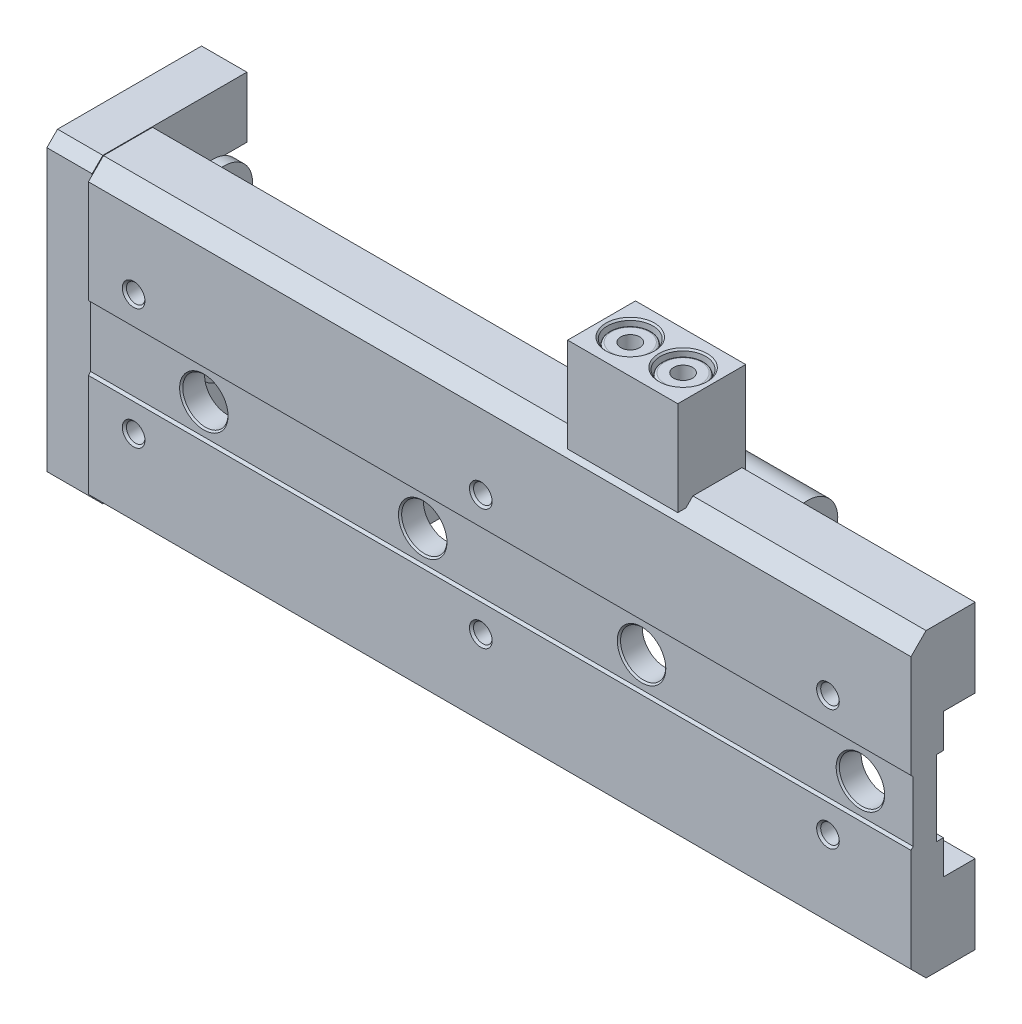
ISO-10303-21;
HEADER;
FILE_DESCRIPTION(('STEP AP214'),'2;1');
FILE_NAME('part.step','',(''),(''),'','','');
FILE_SCHEMA(('AUTOMOTIVE_DESIGN { 1 0 10303 214 1 1 1 1 }'));
ENDSEC;
DATA;
#1=APPLICATION_CONTEXT('core data for automotive mechanical design processes');
#2=APPLICATION_PROTOCOL_DEFINITION('international standard','automotive_design',2000,#1);
#3=PRODUCT_CONTEXT('',#1,'mechanical');
#4=PRODUCT('Part','Part','',(#3));
#5=PRODUCT_RELATED_PRODUCT_CATEGORY('part','',(#4));
#6=PRODUCT_DEFINITION_FORMATION('','',#4);
#7=PRODUCT_DEFINITION_CONTEXT('part definition',#1,'design');
#8=PRODUCT_DEFINITION('design','',#6,#7);
#9=PRODUCT_DEFINITION_SHAPE('','',#8);
#10=(LENGTH_UNIT() NAMED_UNIT(*) SI_UNIT(.MILLI.,.METRE.));
#11=(NAMED_UNIT(*) PLANE_ANGLE_UNIT() SI_UNIT($,.RADIAN.));
#12=(NAMED_UNIT(*) SI_UNIT($,.STERADIAN.) SOLID_ANGLE_UNIT());
#13=UNCERTAINTY_MEASURE_WITH_UNIT(LENGTH_MEASURE(1.E-05),#10,'distance_accuracy_value','');
#14=(GEOMETRIC_REPRESENTATION_CONTEXT(3) GLOBAL_UNCERTAINTY_ASSIGNED_CONTEXT((#13)) GLOBAL_UNIT_ASSIGNED_CONTEXT((#10,
#11,#12)) REPRESENTATION_CONTEXT('',''));
#15=CARTESIAN_POINT('',(0.,0.,0.));
#16=DIRECTION('',(0.,0.,1.));
#17=DIRECTION('',(1.,0.,0.));
#18=AXIS2_PLACEMENT_3D('',#15,#16,#17);
#19=CARTESIAN_POINT('',(107.5,19.92,8.));
#20=DIRECTION('',(0.,-1.,0.));
#21=DIRECTION('',(0.,0.,-1.));
#22=AXIS2_PLACEMENT_3D('',#19,#20,#21);
#23=PLANE('',#22);
#24=DIRECTION('',(-1.,0.,0.));
#25=VECTOR('',#24,1.);
#26=CARTESIAN_POINT('',(107.5,19.92,14.5));
#27=LINE('',#26,#25);
#28=CARTESIAN_POINT('',(62.,19.92,14.5));
#29=VERTEX_POINT('',#28);
#30=CARTESIAN_POINT('',(-1.5,19.92,14.5));
#31=VERTEX_POINT('',#30);
#32=EDGE_CURVE('E829',#29,#31,#27,.T.);
#33=ORIENTED_EDGE('',*,*,#32,.F.);
#34=DIRECTION('',(0.,0.,-1.));
#35=VECTOR('',#34,1.);
#36=CARTESIAN_POINT('',(62.,19.92,8.));
#37=LINE('',#36,#35);
#38=CARTESIAN_POINT('',(62.,19.92,8.));
#39=VERTEX_POINT('',#38);
#40=EDGE_CURVE('E570',#29,#39,#37,.T.);
#41=ORIENTED_EDGE('',*,*,#40,.T.);
#42=DIRECTION('',(-1.,0.,0.));
#43=VECTOR('',#42,1.);
#44=CARTESIAN_POINT('',(107.5,19.92,8.));
#45=LINE('',#44,#43);
#46=CARTESIAN_POINT('',(-1.5,19.92,8.));
#47=VERTEX_POINT('',#46);
#48=EDGE_CURVE('E833',#39,#47,#45,.T.);
#49=ORIENTED_EDGE('',*,*,#48,.T.);
#50=DIRECTION('',(0.,0.,1.));
#51=VECTOR('',#50,1.);
#52=CARTESIAN_POINT('',(-1.5,19.92,8.));
#53=LINE('',#52,#51);
#54=EDGE_CURVE('E800',#47,#31,#53,.T.);
#55=ORIENTED_EDGE('',*,*,#54,.T.);
#56=EDGE_LOOP('',(#33,#41,#49,#55));
#57=FACE_BOUND('',#56,.T.);
#58=ADVANCED_FACE('F17',(#57),#23,.F.);
#59=CARTESIAN_POINT('',(-7.5,0.,1.));
#60=DIRECTION('',(-1.,0.,0.));
#61=DIRECTION('',(0.,0.,1.));
#62=AXIS2_PLACEMENT_3D('',#59,#60,#61);
#63=CYLINDRICAL_SURFACE('',#62,2.);
#64=CARTESIAN_POINT('',(-7.5,0.,1.));
#65=DIRECTION('',(-1.,0.,0.));
#66=DIRECTION('',(0.,0.,1.));
#67=AXIS2_PLACEMENT_3D('',#64,#65,#66);
#68=CIRCLE('',#67,2.);
#69=CARTESIAN_POINT('',(-7.5,0.,3.));
#70=VERTEX_POINT('',#69);
#71=EDGE_CURVE('E633',#70,#70,#68,.T.);
#72=ORIENTED_EDGE('',*,*,#71,.T.);
#73=EDGE_LOOP('',(#72));
#74=FACE_BOUND('',#73,.T.);
#75=CARTESIAN_POINT('',(-4.68,0.,1.));
#76=DIRECTION('',(1.,0.,0.));
#77=DIRECTION('',(0.,0.,-1.));
#78=AXIS2_PLACEMENT_3D('',#75,#76,#77);
#79=CIRCLE('',#78,2.);
#80=CARTESIAN_POINT('',(-4.68,0.,-1.));
#81=VERTEX_POINT('',#80);
#82=EDGE_CURVE('E1151',#81,#81,#79,.F.);
#83=ORIENTED_EDGE('',*,*,#82,.F.);
#84=EDGE_LOOP('',(#83));
#85=FACE_BOUND('',#84,.T.);
#86=ADVANCED_FACE('F1207',(#74,#85),#63,.F.);
#87=CARTESIAN_POINT('',(-1.5,-8.5,0.));
#88=DIRECTION('',(-1.,0.,0.));
#89=DIRECTION('',(0.,0.,1.));
#90=AXIS2_PLACEMENT_3D('',#87,#88,#89);
#91=PLANE('',#90);
#92=CARTESIAN_POINT('',(-1.5,0.,1.));
#93=DIRECTION('',(-1.,0.,0.));
#94=DIRECTION('',(0.,0.,1.));
#95=AXIS2_PLACEMENT_3D('',#92,#93,#94);
#96=CIRCLE('',#95,3.5);
#97=CARTESIAN_POINT('',(-1.5,0.,4.5));
#98=VERTEX_POINT('',#97);
#99=EDGE_CURVE('E1154',#98,#98,#96,.F.);
#100=ORIENTED_EDGE('',*,*,#99,.F.);
#101=EDGE_LOOP('',(#100));
#102=FACE_BOUND('',#101,.T.);
#103=DIRECTION('',(0.,1.,0.));
#104=VECTOR('',#103,1.);
#105=CARTESIAN_POINT('',(-1.5,-5.,13.1));
#106=LINE('',#105,#104);
#107=CARTESIAN_POINT('',(-1.5,0.260078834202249,13.1));
#108=VERTEX_POINT('',#107);
#109=CARTESIAN_POINT('',(-1.5,5.,13.1));
#110=VERTEX_POINT('',#109);
#111=EDGE_CURVE('E782',#108,#110,#106,.T.);
#112=ORIENTED_EDGE('',*,*,#111,.F.);
#113=CARTESIAN_POINT('',(-1.5,0.,11.5));
#114=DIRECTION('',(-1.,0.,0.));
#115=DIRECTION('',(0.,0.,1.));
#116=AXIS2_PLACEMENT_3D('',#113,#114,#115);
#117=CIRCLE('',#116,1.621);
#118=CARTESIAN_POINT('',(-1.5,-0.260078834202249,13.1));
#119=VERTEX_POINT('',#118);
#120=EDGE_CURVE('E34',#108,#119,#117,.T.);
#121=ORIENTED_EDGE('',*,*,#120,.T.);
#122=CARTESIAN_POINT('',(-1.5,-5.,13.1));
#123=VERTEX_POINT('',#122);
#124=EDGE_CURVE('E783',#123,#119,#106,.T.);
#125=ORIENTED_EDGE('',*,*,#124,.F.);
#126=DIRECTION('',(0.,0.,1.));
#127=VECTOR('',#126,1.);
#128=CARTESIAN_POINT('',(-1.5,-5.,12.2));
#129=LINE('',#128,#127);
#130=CARTESIAN_POINT('',(-1.5,-5.,12.2));
#131=VERTEX_POINT('',#130);
#132=EDGE_CURVE('E779',#131,#123,#129,.T.);
#133=ORIENTED_EDGE('',*,*,#132,.F.);
#134=DIRECTION('',(0.,1.,0.));
#135=VECTOR('',#134,1.);
#136=CARTESIAN_POINT('',(-1.5,-9.5,12.2));
#137=LINE('',#136,#135);
#138=CARTESIAN_POINT('',(-1.5,-9.5,12.2));
#139=VERTEX_POINT('',#138);
#140=EDGE_CURVE('E776',#139,#131,#137,.T.);
#141=ORIENTED_EDGE('',*,*,#140,.F.);
#142=DIRECTION('',(0.,0.,1.));
#143=VECTOR('',#142,1.);
#144=CARTESIAN_POINT('',(-1.5,-9.5,8.));
#145=LINE('',#144,#143);
#146=CARTESIAN_POINT('',(-1.5,-9.5,8.));
#147=VERTEX_POINT('',#146);
#148=EDGE_CURVE('E772',#147,#139,#145,.T.);
#149=ORIENTED_EDGE('',*,*,#148,.F.);
#150=DIRECTION('',(0.,1.,0.));
#151=VECTOR('',#150,1.);
#152=CARTESIAN_POINT('',(-1.5,-19.95,8.));
#153=LINE('',#152,#151);
#154=CARTESIAN_POINT('',(-1.5,-11.3854749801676,8.));
#155=VERTEX_POINT('',#154);
#156=EDGE_CURVE('E768',#155,#147,#153,.T.);
#157=ORIENTED_EDGE('',*,*,#156,.F.);
#158=CARTESIAN_POINT('',(-1.5,-12.,6.5));
#159=DIRECTION('',(-1.,0.,0.));
#160=DIRECTION('',(0.,0.,1.));
#161=AXIS2_PLACEMENT_3D('',#158,#159,#160);
#162=CIRCLE('',#161,1.621);
#163=CARTESIAN_POINT('',(-1.5,-12.6145250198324,8.));
#164=VERTEX_POINT('',#163);
#165=EDGE_CURVE('E41',#155,#164,#162,.T.);
#166=ORIENTED_EDGE('',*,*,#165,.T.);
#167=CARTESIAN_POINT('',(-1.5,-19.95,8.));
#168=VERTEX_POINT('',#167);
#169=EDGE_CURVE('E769',#168,#164,#153,.T.);
#170=ORIENTED_EDGE('',*,*,#169,.F.);
#171=DIRECTION('',(0.,0.,-1.));
#172=VECTOR('',#171,1.);
#173=CARTESIAN_POINT('',(-1.5,-19.95,14.5));
#174=LINE('',#173,#172);
#175=CARTESIAN_POINT('',(-1.5,-19.95,14.5));
#176=VERTEX_POINT('',#175);
#177=EDGE_CURVE('E765',#176,#168,#174,.T.);
#178=ORIENTED_EDGE('',*,*,#177,.F.);
#179=DIRECTION('',(0.,-0.707106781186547,-0.707106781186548));
#180=VECTOR('',#179,1.);
#181=CARTESIAN_POINT('',(-1.5,-21.475,12.975));
#182=LINE('',#181,#180);
#183=CARTESIAN_POINT('',(-1.5,-18.45,16.));
#184=VERTEX_POINT('',#183);
#185=EDGE_CURVE('E1148',#184,#176,#182,.T.);
#186=ORIENTED_EDGE('',*,*,#185,.F.);
#187=DIRECTION('',(0.,-1.,0.));
#188=VECTOR('',#187,1.);
#189=CARTESIAN_POINT('',(-1.5,18.585786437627,16.));
#190=LINE('',#189,#188);
#191=CARTESIAN_POINT('',(-1.5,-18.5857864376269,16.));
#192=VERTEX_POINT('',#191);
#193=EDGE_CURVE('E999',#184,#192,#190,.T.);
#194=ORIENTED_EDGE('',*,*,#193,.T.);
#195=DIRECTION('',(0.,-0.707106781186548,-0.707106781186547));
#196=VECTOR('',#195,1.);
#197=CARTESIAN_POINT('',(-1.5,-18.5857864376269,16.));
#198=LINE('',#197,#196);
#199=CARTESIAN_POINT('',(-1.5,-20.,14.5857864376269));
#200=VERTEX_POINT('',#199);
#201=EDGE_CURVE('E997',#192,#200,#198,.T.);
#202=ORIENTED_EDGE('',*,*,#201,.T.);
#203=DIRECTION('',(0.,0.,-1.));
#204=VECTOR('',#203,1.);
#205=CARTESIAN_POINT('',(-1.5,-20.,14.5857864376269));
#206=LINE('',#205,#204);
#207=CARTESIAN_POINT('',(-1.5,-20.,-4.5));
#208=VERTEX_POINT('',#207);
#209=EDGE_CURVE('E1001',#200,#208,#206,.T.);
#210=ORIENTED_EDGE('',*,*,#209,.T.);
#211=DIRECTION('',(0.,1.,0.));
#212=VECTOR('',#211,1.);
#213=CARTESIAN_POINT('',(-1.5,-20.,-4.5));
#214=LINE('',#213,#212);
#215=CARTESIAN_POINT('',(-1.5,-11.95,-4.5));
#216=VERTEX_POINT('',#215);
#217=EDGE_CURVE('E1003',#208,#216,#214,.T.);
#218=ORIENTED_EDGE('',*,*,#217,.T.);
#219=DIRECTION('',(0.,0.,1.));
#220=VECTOR('',#219,1.);
#221=CARTESIAN_POINT('',(-1.5,-11.95,-4.5));
#222=LINE('',#221,#220);
#223=CARTESIAN_POINT('',(-1.5,-11.95,-1.46969384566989));
#224=VERTEX_POINT('',#223);
#225=EDGE_CURVE('E1006',#216,#224,#222,.T.);
#226=ORIENTED_EDGE('',*,*,#225,.T.);
#227=CARTESIAN_POINT('',(-1.5,-8.5,0.));
#228=DIRECTION('',(-1.,0.,0.));
#229=DIRECTION('',(0.,0.,1.));
#230=AXIS2_PLACEMENT_3D('',#227,#228,#229);
#231=CIRCLE('',#230,3.75);
#232=CARTESIAN_POINT('',(-1.5,-5.05,-1.46969384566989));
#233=VERTEX_POINT('',#232);
#234=EDGE_CURVE('E1145',#233,#224,#231,.F.);
#235=ORIENTED_EDGE('',*,*,#234,.F.);
#236=DIRECTION('',(0.,0.,-1.));
#237=VECTOR('',#236,1.);
#238=CARTESIAN_POINT('',(-1.5,-5.05,0.));
#239=LINE('',#238,#237);
#240=CARTESIAN_POINT('',(-1.5,-5.05,-4.5));
#241=VERTEX_POINT('',#240);
#242=EDGE_CURVE('E1011',#233,#241,#239,.T.);
#243=ORIENTED_EDGE('',*,*,#242,.T.);
#244=DIRECTION('',(0.,1.,0.));
#245=VECTOR('',#244,1.);
#246=CARTESIAN_POINT('',(-1.5,-5.05,-4.5));
#247=LINE('',#246,#245);
#248=CARTESIAN_POINT('',(-1.5,5.05,-4.5));
#249=VERTEX_POINT('',#248);
#250=EDGE_CURVE('E1015',#241,#249,#247,.T.);
#251=ORIENTED_EDGE('',*,*,#250,.T.);
#252=DIRECTION('',(0.,0.,1.));
#253=VECTOR('',#252,1.);
#254=CARTESIAN_POINT('',(-1.5,5.05,-4.5));
#255=LINE('',#254,#253);
#256=CARTESIAN_POINT('',(-1.5,5.05,-1.46969384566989));
#257=VERTEX_POINT('',#256);
#258=EDGE_CURVE('E1018',#249,#257,#255,.T.);
#259=ORIENTED_EDGE('',*,*,#258,.T.);
#260=CARTESIAN_POINT('',(-1.5,8.5,0.));
#261=DIRECTION('',(-1.,0.,0.));
#262=DIRECTION('',(0.,-1.,0.));
#263=AXIS2_PLACEMENT_3D('',#260,#261,#262);
#264=CIRCLE('',#263,3.75);
#265=CARTESIAN_POINT('',(-1.5,11.95,-1.46969384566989));
#266=VERTEX_POINT('',#265);
#267=EDGE_CURVE('E1113',#257,#266,#264,.T.);
#268=ORIENTED_EDGE('',*,*,#267,.T.);
#269=DIRECTION('',(0.,0.,-1.));
#270=VECTOR('',#269,1.);
#271=CARTESIAN_POINT('',(-1.5,11.95,0.));
#272=LINE('',#271,#270);
#273=CARTESIAN_POINT('',(-1.5,11.95,-4.5));
#274=VERTEX_POINT('',#273);
#275=EDGE_CURVE('E1023',#266,#274,#272,.T.);
#276=ORIENTED_EDGE('',*,*,#275,.T.);
#277=DIRECTION('',(0.,1.,0.));
#278=VECTOR('',#277,1.);
#279=CARTESIAN_POINT('',(-1.5,11.95,-4.5));
#280=LINE('',#279,#278);
#281=CARTESIAN_POINT('',(-1.5,20.,-4.5));
#282=VERTEX_POINT('',#281);
#283=EDGE_CURVE('E1027',#274,#282,#280,.T.);
#284=ORIENTED_EDGE('',*,*,#283,.T.);
#285=DIRECTION('',(0.,0.,1.));
#286=VECTOR('',#285,1.);
#287=CARTESIAN_POINT('',(-1.5,20.,-4.5));
#288=LINE('',#287,#286);
#289=CARTESIAN_POINT('',(-1.5,20.,14.5857864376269));
#290=VERTEX_POINT('',#289);
#291=EDGE_CURVE('E1029',#282,#290,#288,.T.);
#292=ORIENTED_EDGE('',*,*,#291,.T.);
#293=DIRECTION('',(0.,-0.707106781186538,0.707106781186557));
#294=VECTOR('',#293,1.);
#295=CARTESIAN_POINT('',(-1.5,20.,14.5857864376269));
#296=LINE('',#295,#294);
#297=CARTESIAN_POINT('',(-1.5,18.585786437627,16.));
#298=VERTEX_POINT('',#297);
#299=EDGE_CURVE('E1031',#290,#298,#296,.T.);
#300=ORIENTED_EDGE('',*,*,#299,.T.);
#301=CARTESIAN_POINT('',(-1.5,18.42,16.));
#302=VERTEX_POINT('',#301);
#303=EDGE_CURVE('E995',#298,#302,#190,.T.);
#304=ORIENTED_EDGE('',*,*,#303,.T.);
#305=DIRECTION('',(0.,-0.707106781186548,0.707106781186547));
#306=VECTOR('',#305,1.);
#307=CARTESIAN_POINT('',(-1.5,19.92,14.5));
#308=LINE('',#307,#306);
#309=EDGE_CURVE('E805',#31,#302,#308,.T.);
#310=ORIENTED_EDGE('',*,*,#309,.F.);
#311=ORIENTED_EDGE('',*,*,#54,.F.);
#312=DIRECTION('',(0.,1.,0.));
#313=VECTOR('',#312,1.);
#314=CARTESIAN_POINT('',(-1.5,9.5,8.));
#315=LINE('',#314,#313);
#316=CARTESIAN_POINT('',(-1.5,12.6145250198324,8.));
#317=VERTEX_POINT('',#316);
#318=EDGE_CURVE('E796',#317,#47,#315,.T.);
#319=ORIENTED_EDGE('',*,*,#318,.F.);
#320=CARTESIAN_POINT('',(-1.5,12.,6.5));
#321=DIRECTION('',(-1.,0.,0.));
#322=DIRECTION('',(0.,0.,1.));
#323=AXIS2_PLACEMENT_3D('',#320,#321,#322);
#324=CIRCLE('',#323,1.621);
#325=CARTESIAN_POINT('',(-1.5,11.3854749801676,8.));
#326=VERTEX_POINT('',#325);
#327=EDGE_CURVE('E659',#317,#326,#324,.T.);
#328=ORIENTED_EDGE('',*,*,#327,.T.);
#329=CARTESIAN_POINT('',(-1.5,9.5,8.));
#330=VERTEX_POINT('',#329);
#331=EDGE_CURVE('E797',#330,#326,#315,.T.);
#332=ORIENTED_EDGE('',*,*,#331,.F.);
#333=DIRECTION('',(0.,0.,-1.));
#334=VECTOR('',#333,1.);
#335=CARTESIAN_POINT('',(-1.5,9.5,12.2));
#336=LINE('',#335,#334);
#337=CARTESIAN_POINT('',(-1.5,9.5,12.2));
#338=VERTEX_POINT('',#337);
#339=EDGE_CURVE('E793',#338,#330,#336,.T.);
#340=ORIENTED_EDGE('',*,*,#339,.F.);
#341=DIRECTION('',(0.,1.,0.));
#342=VECTOR('',#341,1.);
#343=CARTESIAN_POINT('',(-1.5,5.,12.2));
#344=LINE('',#343,#342);
#345=CARTESIAN_POINT('',(-1.5,5.,12.2));
#346=VERTEX_POINT('',#345);
#347=EDGE_CURVE('E790',#346,#338,#344,.T.);
#348=ORIENTED_EDGE('',*,*,#347,.F.);
#349=DIRECTION('',(0.,0.,-1.));
#350=VECTOR('',#349,1.);
#351=CARTESIAN_POINT('',(-1.5,5.,13.1));
#352=LINE('',#351,#350);
#353=EDGE_CURVE('E786',#110,#346,#352,.T.);
#354=ORIENTED_EDGE('',*,*,#353,.F.);
#355=EDGE_LOOP('',(#112,#121,#125,#133,#141,#149,#157,#166,#170,#178,#186,#194,#202,#210,#218,
#226,#235,#243,#251,#259,#268,#276,#284,#292,#300,#304,#310,#311,#319,#328,#332,#340,#348,#354));
#356=FACE_BOUND('',#355,.T.);
#357=ADVANCED_FACE('F1215',(#102,#356),#91,.F.);
#358=CARTESIAN_POINT('',(-4.4,-8.5,0.));
#359=DIRECTION('',(-1.,0.,0.));
#360=DIRECTION('',(0.,0.,1.));
#361=AXIS2_PLACEMENT_3D('',#358,#359,#360);
#362=PLANE('',#361);
#363=DIRECTION('',(0.,0.,-1.));
#364=VECTOR('',#363,1.);
#365=CARTESIAN_POINT('',(-4.4,-5.05,0.));
#366=LINE('',#365,#364);
#367=CARTESIAN_POINT('',(-4.4,-5.05,-1.46969384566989));
#368=VERTEX_POINT('',#367);
#369=CARTESIAN_POINT('',(-4.4,-5.05,-4.5));
#370=VERTEX_POINT('',#369);
#371=EDGE_CURVE('E1041',#368,#370,#366,.T.);
#372=ORIENTED_EDGE('',*,*,#371,.F.);
#373=CARTESIAN_POINT('',(-4.4,-8.5,0.));
#374=DIRECTION('',(-1.,0.,0.));
#375=DIRECTION('',(0.,0.,1.));
#376=AXIS2_PLACEMENT_3D('',#373,#374,#375);
#377=CIRCLE('',#376,3.75);
#378=CARTESIAN_POINT('',(-4.4,-11.95,-1.46969384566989));
#379=VERTEX_POINT('',#378);
#380=EDGE_CURVE('E894',#379,#368,#377,.T.);
#381=ORIENTED_EDGE('',*,*,#380,.F.);
#382=DIRECTION('',(0.,0.,1.));
#383=VECTOR('',#382,1.);
#384=CARTESIAN_POINT('',(-4.4,-11.95,-4.5));
#385=LINE('',#384,#383);
#386=CARTESIAN_POINT('',(-4.4,-11.95,-4.5));
#387=VERTEX_POINT('',#386);
#388=EDGE_CURVE('E1035',#387,#379,#385,.T.);
#389=ORIENTED_EDGE('',*,*,#388,.F.);
#390=DIRECTION('',(0.,1.,0.));
#391=VECTOR('',#390,1.);
#392=CARTESIAN_POINT('',(-4.4,-20.,-4.5));
#393=LINE('',#392,#391);
#394=CARTESIAN_POINT('',(-4.4,-13.,-4.5));
#395=VERTEX_POINT('',#394);
#396=EDGE_CURVE('E994',#395,#387,#393,.T.);
#397=ORIENTED_EDGE('',*,*,#396,.F.);
#398=DIRECTION('',(0.,0.,1.));
#399=VECTOR('',#398,1.);
#400=CARTESIAN_POINT('',(-4.4,-13.,-4.5));
#401=LINE('',#400,#399);
#402=CARTESIAN_POINT('',(-4.4,-13.,0.));
#403=VERTEX_POINT('',#402);
#404=EDGE_CURVE('E919',#395,#403,#401,.T.);
#405=ORIENTED_EDGE('',*,*,#404,.T.);
#406=CARTESIAN_POINT('',(-4.4,-8.5,0.));
#407=DIRECTION('',(-1.,0.,0.));
#408=DIRECTION('',(0.,0.,1.));
#409=AXIS2_PLACEMENT_3D('',#406,#407,#408);
#410=CIRCLE('',#409,4.5);
#411=CARTESIAN_POINT('',(-4.4,-4.,0.));
#412=VERTEX_POINT('',#411);
#413=EDGE_CURVE('E922',#403,#412,#410,.T.);
#414=ORIENTED_EDGE('',*,*,#413,.T.);
#415=DIRECTION('',(0.,0.,-1.));
#416=VECTOR('',#415,1.);
#417=CARTESIAN_POINT('',(-4.4,-4.,0.));
#418=LINE('',#417,#416);
#419=CARTESIAN_POINT('',(-4.4,-4.,-4.5));
#420=VERTEX_POINT('',#419);
#421=EDGE_CURVE('E926',#412,#420,#418,.T.);
#422=ORIENTED_EDGE('',*,*,#421,.T.);
#423=DIRECTION('',(0.,1.,0.));
#424=VECTOR('',#423,1.);
#425=CARTESIAN_POINT('',(-4.4,-5.05,-4.5));
#426=LINE('',#425,#424);
#427=EDGE_CURVE('E1046',#370,#420,#426,.T.);
#428=ORIENTED_EDGE('',*,*,#427,.F.);
#429=EDGE_LOOP('',(#372,#381,#389,#397,#405,#414,#422,#428));
#430=FACE_BOUND('',#429,.T.);
#431=ADVANCED_FACE('F1433',(#430),#362,.T.);
#432=CARTESIAN_POINT('',(-4.4,4.,-4.5));
#433=VERTEX_POINT('',#432);
#434=CARTESIAN_POINT('',(-4.4,5.05,-4.5));
#435=VERTEX_POINT('',#434);
#436=EDGE_CURVE('E1045',#433,#435,#426,.T.);
#437=ORIENTED_EDGE('',*,*,#436,.F.);
#438=DIRECTION('',(0.,0.,1.));
#439=VECTOR('',#438,1.);
#440=CARTESIAN_POINT('',(-4.4,4.,-4.5));
#441=LINE('',#440,#439);
#442=CARTESIAN_POINT('',(-4.4,4.,0.));
#443=VERTEX_POINT('',#442);
#444=EDGE_CURVE('E929',#433,#443,#441,.T.);
#445=ORIENTED_EDGE('',*,*,#444,.T.);
#446=CARTESIAN_POINT('',(-4.4,8.5,0.));
#447=DIRECTION('',(-1.,0.,0.));
#448=DIRECTION('',(0.,0.,1.));
#449=AXIS2_PLACEMENT_3D('',#446,#447,#448);
#450=CIRCLE('',#449,4.5);
#451=CARTESIAN_POINT('',(-4.4,13.,0.));
#452=VERTEX_POINT('',#451);
#453=EDGE_CURVE('E932',#443,#452,#450,.T.);
#454=ORIENTED_EDGE('',*,*,#453,.T.);
#455=DIRECTION('',(0.,0.,-1.));
#456=VECTOR('',#455,1.);
#457=CARTESIAN_POINT('',(-4.4,13.,0.));
#458=LINE('',#457,#456);
#459=CARTESIAN_POINT('',(-4.4,13.,-4.5));
#460=VERTEX_POINT('',#459);
#461=EDGE_CURVE('E935',#452,#460,#458,.T.);
#462=ORIENTED_EDGE('',*,*,#461,.T.);
#463=DIRECTION('',(0.,1.,0.));
#464=VECTOR('',#463,1.);
#465=CARTESIAN_POINT('',(-4.4,11.95,-4.5));
#466=LINE('',#465,#464);
#467=CARTESIAN_POINT('',(-4.4,11.95,-4.5));
#468=VERTEX_POINT('',#467);
#469=EDGE_CURVE('E1060',#468,#460,#466,.T.);
#470=ORIENTED_EDGE('',*,*,#469,.F.);
#471=DIRECTION('',(0.,0.,-1.));
#472=VECTOR('',#471,1.);
#473=CARTESIAN_POINT('',(-4.4,11.95,0.));
#474=LINE('',#473,#472);
#475=CARTESIAN_POINT('',(-4.4,11.95,-1.46969384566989));
#476=VERTEX_POINT('',#475);
#477=EDGE_CURVE('E1056',#476,#468,#474,.T.);
#478=ORIENTED_EDGE('',*,*,#477,.F.);
#479=CARTESIAN_POINT('',(-4.4,8.5,0.));
#480=DIRECTION('',(-1.,0.,0.));
#481=DIRECTION('',(0.,-1.,0.));
#482=AXIS2_PLACEMENT_3D('',#479,#480,#481);
#483=CIRCLE('',#482,3.75);
#484=CARTESIAN_POINT('',(-4.4,5.05,-1.46969384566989));
#485=VERTEX_POINT('',#484);
#486=EDGE_CURVE('E1123',#485,#476,#483,.T.);
#487=ORIENTED_EDGE('',*,*,#486,.F.);
#488=DIRECTION('',(0.,0.,1.));
#489=VECTOR('',#488,1.);
#490=CARTESIAN_POINT('',(-4.4,5.05,-4.5));
#491=LINE('',#490,#489);
#492=EDGE_CURVE('E1050',#435,#485,#491,.T.);
#493=ORIENTED_EDGE('',*,*,#492,.F.);
#494=EDGE_LOOP('',(#437,#445,#454,#462,#470,#478,#487,#493));
#495=FACE_BOUND('',#494,.T.);
#496=ADVANCED_FACE('F1413',(#495),#362,.T.);
#497=CARTESIAN_POINT('',(-4.4,12.25,0.));
#498=DIRECTION('',(-1.,0.,0.));
#499=DIRECTION('',(0.,-1.,0.));
#500=AXIS2_PLACEMENT_3D('',#497,#498,#499);
#501=PLANE('',#500);
#502=CARTESIAN_POINT('',(-4.4,8.5,0.));
#503=DIRECTION('',(-1.,0.,0.));
#504=DIRECTION('',(0.,-1.,0.));
#505=AXIS2_PLACEMENT_3D('',#502,#503,#504);
#506=CIRCLE('',#505,2.75);
#507=CARTESIAN_POINT('',(-4.4,5.75,0.));
#508=VERTEX_POINT('',#507);
#509=EDGE_CURVE('E1120',#508,#508,#506,.T.);
#510=ORIENTED_EDGE('',*,*,#509,.T.);
#511=EDGE_LOOP('',(#510));
#512=FACE_BOUND('',#511,.T.);
#513=CARTESIAN_POINT('',(-4.4,5.05,0.));
#514=VERTEX_POINT('',#513);
#515=EDGE_CURVE('E1049',#485,#514,#491,.T.);
#516=ORIENTED_EDGE('',*,*,#515,.F.);
#517=EDGE_CURVE('E1124',#476,#485,#483,.T.);
#518=ORIENTED_EDGE('',*,*,#517,.F.);
#519=CARTESIAN_POINT('',(-4.4,11.95,0.));
#520=VERTEX_POINT('',#519);
#521=EDGE_CURVE('E1057',#520,#476,#474,.T.);
#522=ORIENTED_EDGE('',*,*,#521,.F.);
#523=CARTESIAN_POINT('',(-4.4,8.5,0.));
#524=DIRECTION('',(-1.,0.,0.));
#525=DIRECTION('',(0.,0.,1.));
#526=AXIS2_PLACEMENT_3D('',#523,#524,#525);
#527=CIRCLE('',#526,3.45);
#528=EDGE_CURVE('E1053',#514,#520,#527,.T.);
#529=ORIENTED_EDGE('',*,*,#528,.F.);
#530=EDGE_LOOP('',(#516,#518,#522,#529));
#531=FACE_BOUND('',#530,.T.);
#532=ADVANCED_FACE('F2712',(#512,#531),#501,.F.);
#533=CARTESIAN_POINT('',(-1.5,11.25,0.));
#534=DIRECTION('',(1.,0.,0.));
#535=DIRECTION('',(0.,1.,0.));
#536=AXIS2_PLACEMENT_3D('',#533,#534,#535);
#537=PLANE('',#536);
#538=CARTESIAN_POINT('',(-1.5,8.5,0.));
#539=DIRECTION('',(-1.,0.,0.));
#540=DIRECTION('',(0.,-1.,0.));
#541=AXIS2_PLACEMENT_3D('',#538,#539,#540);
#542=CIRCLE('',#541,2.75);
#543=CARTESIAN_POINT('',(-1.5,5.75,0.));
#544=VERTEX_POINT('',#543);
#545=EDGE_CURVE('E1117',#544,#544,#542,.T.);
#546=ORIENTED_EDGE('',*,*,#545,.F.);
#547=EDGE_LOOP('',(#546));
#548=FACE_BOUND('',#547,.T.);
#549=CARTESIAN_POINT('',(-1.5,5.05,0.));
#550=VERTEX_POINT('',#549);
#551=EDGE_CURVE('E1017',#257,#550,#255,.T.);
#552=ORIENTED_EDGE('',*,*,#551,.T.);
#553=CARTESIAN_POINT('',(-1.5,8.5,0.));
#554=DIRECTION('',(-1.,0.,0.));
#555=DIRECTION('',(0.,0.,1.));
#556=AXIS2_PLACEMENT_3D('',#553,#554,#555);
#557=CIRCLE('',#556,3.45);
#558=CARTESIAN_POINT('',(-1.5,11.95,0.));
#559=VERTEX_POINT('',#558);
#560=EDGE_CURVE('E1021',#550,#559,#557,.T.);
#561=ORIENTED_EDGE('',*,*,#560,.T.);
#562=EDGE_CURVE('E1024',#559,#266,#272,.T.);
#563=ORIENTED_EDGE('',*,*,#562,.T.);
#564=EDGE_CURVE('E1114',#266,#257,#264,.T.);
#565=ORIENTED_EDGE('',*,*,#564,.T.);
#566=EDGE_LOOP('',(#552,#561,#563,#565));
#567=FACE_BOUND('',#566,.T.);
#568=ADVANCED_FACE('F1982',(#548,#567),#537,.F.);
#569=CARTESIAN_POINT('',(-4.6,8.5,0.));
#570=DIRECTION('',(-1.,0.,0.));
#571=DIRECTION('',(0.,-1.,0.));
#572=AXIS2_PLACEMENT_3D('',#569,#570,#571);
#573=CONICAL_SURFACE('',#572,1.44,1.0471975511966);
#574=CARTESIAN_POINT('',(-3.76861561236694,8.5,0.));
#575=VERTEX_POINT('',#574);
#576=VERTEX_LOOP('',#575);
#577=FACE_BOUND('',#576,.T.);
#578=CARTESIAN_POINT('',(-4.6,8.5,0.));
#579=DIRECTION('',(-1.,0.,0.));
#580=DIRECTION('',(0.,-1.,0.));
#581=AXIS2_PLACEMENT_3D('',#578,#579,#580);
#582=CIRCLE('',#581,1.44);
#583=CARTESIAN_POINT('',(-4.6,7.06,0.));
#584=VERTEX_POINT('',#583);
#585=EDGE_CURVE('E1142',#584,#584,#582,.T.);
#586=ORIENTED_EDGE('',*,*,#585,.T.);
#587=EDGE_LOOP('',(#586));
#588=FACE_BOUND('',#587,.T.);
#589=ADVANCED_FACE('F19',(#577,#588),#573,.F.);
#590=CARTESIAN_POINT('',(77.3,8.5,0.));
#591=DIRECTION('',(-1.,0.,0.));
#592=DIRECTION('',(0.,-1.,0.));
#593=AXIS2_PLACEMENT_3D('',#590,#591,#592);
#594=CYLINDRICAL_SURFACE('',#593,1.44);
#595=ORIENTED_EDGE('',*,*,#585,.F.);
#596=EDGE_LOOP('',(#595));
#597=FACE_BOUND('',#596,.T.);
#598=CARTESIAN_POINT('',(-5.8,8.5,0.));
#599=DIRECTION('',(-1.,0.,0.));
#600=DIRECTION('',(0.,-1.,0.));
#601=AXIS2_PLACEMENT_3D('',#598,#599,#600);
#602=CIRCLE('',#601,1.44);
#603=CARTESIAN_POINT('',(-5.8,7.06,0.));
#604=VERTEX_POINT('',#603);
#605=EDGE_CURVE('E1139',#604,#604,#602,.T.);
#606=ORIENTED_EDGE('',*,*,#605,.T.);
#607=EDGE_LOOP('',(#606));
#608=FACE_BOUND('',#607,.T.);
#609=ADVANCED_FACE('F1981',(#597,#608),#594,.F.);
#610=CARTESIAN_POINT('',(-5.8,9.94,0.));
#611=DIRECTION('',(1.,0.,0.));
#612=DIRECTION('',(0.,1.,0.));
#613=AXIS2_PLACEMENT_3D('',#610,#611,#612);
#614=PLANE('',#613);
#615=ORIENTED_EDGE('',*,*,#605,.F.);
#616=EDGE_LOOP('',(#615));
#617=FACE_BOUND('',#616,.T.);
#618=CARTESIAN_POINT('',(-5.8,8.5,0.));
#619=DIRECTION('',(-1.,0.,0.));
#620=DIRECTION('',(0.,-1.,0.));
#621=AXIS2_PLACEMENT_3D('',#618,#619,#620);
#622=CIRCLE('',#621,1.55);
#623=CARTESIAN_POINT('',(-5.8,6.95,0.));
#624=VERTEX_POINT('',#623);
#625=EDGE_CURVE('E1136',#624,#624,#622,.T.);
#626=ORIENTED_EDGE('',*,*,#625,.T.);
#627=EDGE_LOOP('',(#626));
#628=FACE_BOUND('',#627,.T.);
#629=ADVANCED_FACE('F2086',(#617,#628),#614,.F.);
#630=CARTESIAN_POINT('',(-6.,8.5,0.));
#631=DIRECTION('',(-1.,0.,0.));
#632=DIRECTION('',(0.,-1.,0.));
#633=AXIS2_PLACEMENT_3D('',#630,#631,#632);
#634=CONICAL_SURFACE('',#633,1.75,0.785398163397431);
#635=ORIENTED_EDGE('',*,*,#625,.F.);
#636=EDGE_LOOP('',(#635));
#637=FACE_BOUND('',#636,.T.);
#638=CARTESIAN_POINT('',(-6.,8.5,0.));
#639=DIRECTION('',(-1.,0.,0.));
#640=DIRECTION('',(0.,-1.,0.));
#641=AXIS2_PLACEMENT_3D('',#638,#639,#640);
#642=CIRCLE('',#641,1.75);
#643=CARTESIAN_POINT('',(-6.,6.75,0.));
#644=VERTEX_POINT('',#643);
#645=EDGE_CURVE('E1133',#644,#644,#642,.T.);
#646=ORIENTED_EDGE('',*,*,#645,.T.);
#647=EDGE_LOOP('',(#646));
#648=FACE_BOUND('',#647,.T.);
#649=ADVANCED_FACE('F2080',(#637,#648),#634,.F.);
#650=CARTESIAN_POINT('',(77.3,8.5,0.));
#651=DIRECTION('',(-1.,0.,0.));
#652=DIRECTION('',(0.,-1.,0.));
#653=AXIS2_PLACEMENT_3D('',#650,#651,#652);
#654=CYLINDRICAL_SURFACE('',#653,1.75);
#655=ORIENTED_EDGE('',*,*,#645,.F.);
#656=EDGE_LOOP('',(#655));
#657=FACE_BOUND('',#656,.T.);
#658=CARTESIAN_POINT('',(-6.3,8.5,0.));
#659=DIRECTION('',(-1.,0.,0.));
#660=DIRECTION('',(0.,-1.,0.));
#661=AXIS2_PLACEMENT_3D('',#658,#659,#660);
#662=CIRCLE('',#661,1.75);
#663=CARTESIAN_POINT('',(-6.3,6.75,0.));
#664=VERTEX_POINT('',#663);
#665=EDGE_CURVE('E1130',#664,#664,#662,.T.);
#666=ORIENTED_EDGE('',*,*,#665,.T.);
#667=EDGE_LOOP('',(#666));
#668=FACE_BOUND('',#667,.T.);
#669=ADVANCED_FACE('F2085',(#657,#668),#654,.F.);
#670=CARTESIAN_POINT('',(-6.3,10.25,0.));
#671=DIRECTION('',(1.,0.,0.));
#672=DIRECTION('',(0.,1.,0.));
#673=AXIS2_PLACEMENT_3D('',#670,#671,#672);
#674=PLANE('',#673);
#675=ORIENTED_EDGE('',*,*,#665,.F.);
#676=EDGE_LOOP('',(#675));
#677=FACE_BOUND('',#676,.T.);
#678=CARTESIAN_POINT('',(-6.3,8.5,0.));
#679=DIRECTION('',(-1.,0.,0.));
#680=DIRECTION('',(0.,-1.,0.));
#681=AXIS2_PLACEMENT_3D('',#678,#679,#680);
#682=CIRCLE('',#681,3.75);
#683=CARTESIAN_POINT('',(-6.3,4.75,0.));
#684=VERTEX_POINT('',#683);
#685=EDGE_CURVE('E1127',#684,#684,#682,.T.);
#686=ORIENTED_EDGE('',*,*,#685,.T.);
#687=EDGE_LOOP('',(#686));
#688=FACE_BOUND('',#687,.T.);
#689=ADVANCED_FACE('F2200',(#677,#688),#674,.F.);
#690=CARTESIAN_POINT('',(77.3,8.5,0.));
#691=DIRECTION('',(-1.,0.,0.));
#692=DIRECTION('',(0.,-1.,0.));
#693=AXIS2_PLACEMENT_3D('',#690,#691,#692);
#694=CYLINDRICAL_SURFACE('',#693,3.75);
#695=ORIENTED_EDGE('',*,*,#685,.F.);
#696=EDGE_LOOP('',(#695));
#697=FACE_BOUND('',#696,.T.);
#698=ORIENTED_EDGE('',*,*,#517,.T.);
#699=ORIENTED_EDGE('',*,*,#486,.T.);
#700=EDGE_LOOP('',(#698,#699));
#701=FACE_BOUND('',#700,.T.);
#702=ADVANCED_FACE('F2297',(#697,#701),#694,.T.);
#703=CARTESIAN_POINT('',(77.3,8.5,0.));
#704=DIRECTION('',(-1.,0.,0.));
#705=DIRECTION('',(0.,-1.,0.));
#706=AXIS2_PLACEMENT_3D('',#703,#704,#705);
#707=CYLINDRICAL_SURFACE('',#706,2.75);
#708=ORIENTED_EDGE('',*,*,#509,.F.);
#709=EDGE_LOOP('',(#708));
#710=FACE_BOUND('',#709,.T.);
#711=ORIENTED_EDGE('',*,*,#545,.T.);
#712=EDGE_LOOP('',(#711));
#713=FACE_BOUND('',#712,.T.);
#714=ADVANCED_FACE('F2301',(#710,#713),#707,.T.);
#715=CARTESIAN_POINT('',(77.3,8.5,0.));
#716=DIRECTION('',(-1.,0.,0.));
#717=DIRECTION('',(0.,-1.,0.));
#718=AXIS2_PLACEMENT_3D('',#715,#716,#717);
#719=CYLINDRICAL_SURFACE('',#718,3.75);
#720=ORIENTED_EDGE('',*,*,#564,.F.);
#721=ORIENTED_EDGE('',*,*,#267,.F.);
#722=EDGE_LOOP('',(#720,#721));
#723=FACE_BOUND('',#722,.T.);
#724=CARTESIAN_POINT('',(0.,8.5,0.));
#725=DIRECTION('',(-1.,0.,0.));
#726=DIRECTION('',(0.,-1.,0.));
#727=AXIS2_PLACEMENT_3D('',#724,#725,#726);
#728=CIRCLE('',#727,3.75);
#729=CARTESIAN_POINT('',(0.,4.75,0.));
#730=VERTEX_POINT('',#729);
#731=EDGE_CURVE('E1110',#730,#730,#728,.T.);
#732=ORIENTED_EDGE('',*,*,#731,.T.);
#733=EDGE_LOOP('',(#732));
#734=FACE_BOUND('',#733,.T.);
#735=ADVANCED_FACE('F2396',(#723,#734),#719,.T.);
#736=CARTESIAN_POINT('',(0.,12.25,0.));
#737=DIRECTION('',(-1.,0.,0.));
#738=DIRECTION('',(0.,-1.,0.));
#739=AXIS2_PLACEMENT_3D('',#736,#737,#738);
#740=PLANE('',#739);
#741=ORIENTED_EDGE('',*,*,#731,.F.);
#742=EDGE_LOOP('',(#741));
#743=FACE_BOUND('',#742,.T.);
#744=CARTESIAN_POINT('',(0.,8.5,0.));
#745=DIRECTION('',(-1.,0.,0.));
#746=DIRECTION('',(0.,-1.,0.));
#747=AXIS2_PLACEMENT_3D('',#744,#745,#746);
#748=CIRCLE('',#747,2.);
#749=CARTESIAN_POINT('',(0.,6.5,0.));
#750=VERTEX_POINT('',#749);
#751=EDGE_CURVE('E1107',#750,#750,#748,.T.);
#752=ORIENTED_EDGE('',*,*,#751,.T.);
#753=EDGE_LOOP('',(#752));
#754=FACE_BOUND('',#753,.T.);
#755=ADVANCED_FACE('F2485',(#743,#754),#740,.F.);
#756=CARTESIAN_POINT('',(77.3,8.5,0.));
#757=DIRECTION('',(-1.,0.,0.));
#758=DIRECTION('',(0.,-1.,0.));
#759=AXIS2_PLACEMENT_3D('',#756,#757,#758);
#760=CYLINDRICAL_SURFACE('',#759,2.);
#761=ORIENTED_EDGE('',*,*,#751,.F.);
#762=EDGE_LOOP('',(#761));
#763=FACE_BOUND('',#762,.T.);
#764=CARTESIAN_POINT('',(65.,8.5,0.));
#765=DIRECTION('',(-1.,0.,0.));
#766=DIRECTION('',(0.,-1.,0.));
#767=AXIS2_PLACEMENT_3D('',#764,#765,#766);
#768=CIRCLE('',#767,2.);
#769=CARTESIAN_POINT('',(65.,6.5,0.));
#770=VERTEX_POINT('',#769);
#771=EDGE_CURVE('E1104',#770,#770,#768,.T.);
#772=ORIENTED_EDGE('',*,*,#771,.T.);
#773=EDGE_LOOP('',(#772));
#774=FACE_BOUND('',#773,.T.);
#775=ADVANCED_FACE('F2564',(#763,#774),#760,.T.);
#776=CARTESIAN_POINT('',(65.,10.5,0.));
#777=DIRECTION('',(1.,0.,0.));
#778=DIRECTION('',(0.,1.,0.));
#779=AXIS2_PLACEMENT_3D('',#776,#777,#778);
#780=PLANE('',#779);
#781=ORIENTED_EDGE('',*,*,#771,.F.);
#782=EDGE_LOOP('',(#781));
#783=FACE_BOUND('',#782,.T.);
#784=CARTESIAN_POINT('',(65.,8.5,0.));
#785=DIRECTION('',(-1.,0.,0.));
#786=DIRECTION('',(0.,-1.,0.));
#787=AXIS2_PLACEMENT_3D('',#784,#785,#786);
#788=CIRCLE('',#787,4.);
#789=CARTESIAN_POINT('',(65.,4.5,0.));
#790=VERTEX_POINT('',#789);
#791=EDGE_CURVE('E1101',#790,#790,#788,.T.);
#792=ORIENTED_EDGE('',*,*,#791,.T.);
#793=EDGE_LOOP('',(#792));
#794=FACE_BOUND('',#793,.T.);
#795=ADVANCED_FACE('F2569',(#783,#794),#780,.F.);
#796=CARTESIAN_POINT('',(77.3,8.5,0.));
#797=DIRECTION('',(-1.,0.,0.));
#798=DIRECTION('',(0.,-1.,0.));
#799=AXIS2_PLACEMENT_3D('',#796,#797,#798);
#800=CYLINDRICAL_SURFACE('',#799,4.);
#801=ORIENTED_EDGE('',*,*,#791,.F.);
#802=EDGE_LOOP('',(#801));
#803=FACE_BOUND('',#802,.T.);
#804=CARTESIAN_POINT('',(77.3,8.5,0.));
#805=DIRECTION('',(-1.,0.,0.));
#806=DIRECTION('',(0.,-1.,0.));
#807=AXIS2_PLACEMENT_3D('',#804,#805,#806);
#808=CIRCLE('',#807,4.);
#809=CARTESIAN_POINT('',(77.3,4.5,0.));
#810=VERTEX_POINT('',#809);
#811=EDGE_CURVE('E1098',#810,#810,#808,.T.);
#812=ORIENTED_EDGE('',*,*,#811,.T.);
#813=EDGE_LOOP('',(#812));
#814=FACE_BOUND('',#813,.T.);
#815=ADVANCED_FACE('F2191',(#803,#814),#800,.T.);
#816=CARTESIAN_POINT('',(77.3,12.5,0.));
#817=DIRECTION('',(-1.,0.,0.));
#818=DIRECTION('',(0.,-1.,0.));
#819=AXIS2_PLACEMENT_3D('',#816,#817,#818);
#820=PLANE('',#819);
#821=ORIENTED_EDGE('',*,*,#811,.F.);
#822=EDGE_LOOP('',(#821));
#823=FACE_BOUND('',#822,.T.);
#824=ADVANCED_FACE('F2186',(#823),#820,.F.);
#825=CARTESIAN_POINT('',(-1.5,18.585786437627,16.));
#826=DIRECTION('',(0.,0.,-1.));
#827=DIRECTION('',(-1.,0.,0.));
#828=AXIS2_PLACEMENT_3D('',#825,#826,#827);
#829=PLANE('',#828);
#830=DIRECTION('',(-1.,0.,0.));
#831=VECTOR('',#830,1.);
#832=CARTESIAN_POINT('',(-1.5,18.585786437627,16.));
#833=LINE('',#832,#831);
#834=CARTESIAN_POINT('',(-7.5,18.585786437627,16.));
#835=VERTEX_POINT('',#834);
#836=EDGE_CURVE('E1033',#298,#835,#833,.T.);
#837=ORIENTED_EDGE('',*,*,#836,.T.);
#838=DIRECTION('',(0.,-1.,0.));
#839=VECTOR('',#838,1.);
#840=CARTESIAN_POINT('',(-7.5,18.585786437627,16.));
#841=LINE('',#840,#839);
#842=CARTESIAN_POINT('',(-7.5,-18.5857864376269,16.));
#843=VERTEX_POINT('',#842);
#844=EDGE_CURVE('E918',#835,#843,#841,.T.);
#845=ORIENTED_EDGE('',*,*,#844,.T.);
#846=DIRECTION('',(-1.,0.,0.));
#847=VECTOR('',#846,1.);
#848=CARTESIAN_POINT('',(-1.5,-18.5857864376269,16.));
#849=LINE('',#848,#847);
#850=EDGE_CURVE('E1096',#192,#843,#849,.T.);
#851=ORIENTED_EDGE('',*,*,#850,.F.);
#852=ORIENTED_EDGE('',*,*,#193,.F.);
#853=EDGE_CURVE('E998',#302,#184,#190,.T.);
#854=ORIENTED_EDGE('',*,*,#853,.F.);
#855=ORIENTED_EDGE('',*,*,#303,.F.);
#856=EDGE_LOOP('',(#837,#845,#851,#852,#854,#855));
#857=FACE_BOUND('',#856,.T.);
#858=ADVANCED_FACE('F1389',(#857),#829,.F.);
#859=CARTESIAN_POINT('',(-1.5,-18.5857864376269,16.));
#860=DIRECTION('',(0.,0.707106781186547,-0.707106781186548));
#861=DIRECTION('',(0.,0.707106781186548,0.707106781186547));
#862=AXIS2_PLACEMENT_3D('',#859,#860,#861);
#863=PLANE('',#862);
#864=ORIENTED_EDGE('',*,*,#850,.T.);
#865=DIRECTION('',(0.,-0.707106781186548,-0.707106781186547));
#866=VECTOR('',#865,1.);
#867=CARTESIAN_POINT('',(-7.5,-18.5857864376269,16.));
#868=LINE('',#867,#866);
#869=CARTESIAN_POINT('',(-7.5,-20.,14.5857864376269));
#870=VERTEX_POINT('',#869);
#871=EDGE_CURVE('E941',#843,#870,#868,.T.);
#872=ORIENTED_EDGE('',*,*,#871,.T.);
#873=DIRECTION('',(-1.,0.,0.));
#874=VECTOR('',#873,1.);
#875=CARTESIAN_POINT('',(-1.5,-20.,14.5857864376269));
#876=LINE('',#875,#874);
#877=EDGE_CURVE('E1094',#200,#870,#876,.T.);
#878=ORIENTED_EDGE('',*,*,#877,.F.);
#879=ORIENTED_EDGE('',*,*,#201,.F.);
#880=EDGE_LOOP('',(#864,#872,#878,#879));
#881=FACE_BOUND('',#880,.T.);
#882=ADVANCED_FACE('F1455',(#881),#863,.F.);
#883=CARTESIAN_POINT('',(-1.5,-20.,14.5857864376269));
#884=DIRECTION('',(0.,1.,0.));
#885=DIRECTION('',(0.,0.,1.));
#886=AXIS2_PLACEMENT_3D('',#883,#884,#885);
#887=PLANE('',#886);
#888=ORIENTED_EDGE('',*,*,#877,.T.);
#889=DIRECTION('',(0.,0.,-1.));
#890=VECTOR('',#889,1.);
#891=CARTESIAN_POINT('',(-7.5,-20.,14.5857864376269));
#892=LINE('',#891,#890);
#893=CARTESIAN_POINT('',(-7.5,-20.,-4.5));
#894=VERTEX_POINT('',#893);
#895=EDGE_CURVE('E944',#870,#894,#892,.T.);
#896=ORIENTED_EDGE('',*,*,#895,.T.);
#897=DIRECTION('',(-1.,0.,0.));
#898=VECTOR('',#897,1.);
#899=CARTESIAN_POINT('',(-1.5,-20.,-4.5));
#900=LINE('',#899,#898);
#901=EDGE_CURVE('E1092',#208,#894,#900,.T.);
#902=ORIENTED_EDGE('',*,*,#901,.F.);
#903=ORIENTED_EDGE('',*,*,#209,.F.);
#904=EDGE_LOOP('',(#888,#896,#902,#903));
#905=FACE_BOUND('',#904,.T.);
#906=ADVANCED_FACE('F1451',(#905),#887,.F.);
#907=CARTESIAN_POINT('',(-1.5,-20.,-4.5));
#908=DIRECTION('',(0.,0.,1.));
#909=DIRECTION('',(1.,0.,0.));
#910=AXIS2_PLACEMENT_3D('',#907,#908,#909);
#911=PLANE('',#910);
#912=ORIENTED_EDGE('',*,*,#901,.T.);
#913=DIRECTION('',(0.,1.,0.));
#914=VECTOR('',#913,1.);
#915=CARTESIAN_POINT('',(-7.5,-20.,-4.5));
#916=LINE('',#915,#914);
#917=CARTESIAN_POINT('',(-7.5,-13.,-4.5));
#918=VERTEX_POINT('',#917);
#919=EDGE_CURVE('E947',#894,#918,#916,.T.);
#920=ORIENTED_EDGE('',*,*,#919,.T.);
#921=DIRECTION('',(-1.,0.,0.));
#922=VECTOR('',#921,1.);
#923=CARTESIAN_POINT('',(-4.4,-13.,-4.5));
#924=LINE('',#923,#922);
#925=EDGE_CURVE('E991',#395,#918,#924,.T.);
#926=ORIENTED_EDGE('',*,*,#925,.F.);
#927=ORIENTED_EDGE('',*,*,#396,.T.);
#928=DIRECTION('',(-1.,0.,0.));
#929=VECTOR('',#928,1.);
#930=CARTESIAN_POINT('',(-1.5,-11.95,-4.5));
#931=LINE('',#930,#929);
#932=EDGE_CURVE('E1089',#216,#387,#931,.T.);
#933=ORIENTED_EDGE('',*,*,#932,.F.);
#934=ORIENTED_EDGE('',*,*,#217,.F.);
#935=EDGE_LOOP('',(#912,#920,#926,#927,#933,#934));
#936=FACE_BOUND('',#935,.T.);
#937=ADVANCED_FACE('F1445',(#936),#911,.F.);
#938=CARTESIAN_POINT('',(-1.5,-11.95,-4.5));
#939=DIRECTION('',(0.,-1.,0.));
#940=DIRECTION('',(0.,0.,-1.));
#941=AXIS2_PLACEMENT_3D('',#938,#939,#940);
#942=PLANE('',#941);
#943=ORIENTED_EDGE('',*,*,#388,.T.);
#944=DIRECTION('',(0.,0.,-1.));
#945=VECTOR('',#944,1.);
#946=CARTESIAN_POINT('',(-4.4,-11.95,-4.5));
#947=LINE('',#946,#945);
#948=CARTESIAN_POINT('',(-4.4,-11.95,0.));
#949=VERTEX_POINT('',#948);
#950=EDGE_CURVE('E916',#949,#379,#947,.T.);
#951=ORIENTED_EDGE('',*,*,#950,.F.);
#952=DIRECTION('',(-1.,0.,0.));
#953=VECTOR('',#952,1.);
#954=CARTESIAN_POINT('',(-1.5,-11.95,0.));
#955=LINE('',#954,#953);
#956=CARTESIAN_POINT('',(-1.5,-11.95,0.));
#957=VERTEX_POINT('',#956);
#958=EDGE_CURVE('E1086',#957,#949,#955,.T.);
#959=ORIENTED_EDGE('',*,*,#958,.F.);
#960=EDGE_CURVE('E1005',#224,#957,#222,.T.);
#961=ORIENTED_EDGE('',*,*,#960,.F.);
#962=ORIENTED_EDGE('',*,*,#225,.F.);
#963=ORIENTED_EDGE('',*,*,#932,.T.);
#964=EDGE_LOOP('',(#943,#951,#959,#961,#962,#963));
#965=FACE_BOUND('',#964,.T.);
#966=ADVANCED_FACE('F2559',(#965),#942,.F.);
#967=CARTESIAN_POINT('',(-1.5,-8.5,0.));
#968=DIRECTION('',(-1.,0.,0.));
#969=DIRECTION('',(0.,0.,1.));
#970=AXIS2_PLACEMENT_3D('',#967,#968,#969);
#971=CYLINDRICAL_SURFACE('',#970,3.45);
#972=CARTESIAN_POINT('',(-4.4,-8.5,0.));
#973=DIRECTION('',(-1.,0.,0.));
#974=DIRECTION('',(0.,0.,1.));
#975=AXIS2_PLACEMENT_3D('',#972,#973,#974);
#976=CIRCLE('',#975,3.45);
#977=CARTESIAN_POINT('',(-4.4,-5.05,0.));
#978=VERTEX_POINT('',#977);
#979=EDGE_CURVE('E1038',#949,#978,#976,.T.);
#980=ORIENTED_EDGE('',*,*,#979,.T.);
#981=DIRECTION('',(-1.,0.,0.));
#982=VECTOR('',#981,1.);
#983=CARTESIAN_POINT('',(-1.5,-5.05,0.));
#984=LINE('',#983,#982);
#985=CARTESIAN_POINT('',(-1.5,-5.05,0.));
#986=VERTEX_POINT('',#985);
#987=EDGE_CURVE('E1083',#986,#978,#984,.T.);
#988=ORIENTED_EDGE('',*,*,#987,.F.);
#989=CARTESIAN_POINT('',(-1.5,-8.5,0.));
#990=DIRECTION('',(-1.,0.,0.));
#991=DIRECTION('',(0.,0.,1.));
#992=AXIS2_PLACEMENT_3D('',#989,#990,#991);
#993=CIRCLE('',#992,3.45);
#994=EDGE_CURVE('E1008',#957,#986,#993,.T.);
#995=ORIENTED_EDGE('',*,*,#994,.F.);
#996=ORIENTED_EDGE('',*,*,#958,.T.);
#997=EDGE_LOOP('',(#980,#988,#995,#996));
#998=FACE_BOUND('',#997,.T.);
#999=ADVANCED_FACE('F2637',(#998),#971,.F.);
#1000=CARTESIAN_POINT('',(-1.5,-5.05,0.));
#1001=DIRECTION('',(0.,1.,0.));
#1002=DIRECTION('',(0.,0.,1.));
#1003=AXIS2_PLACEMENT_3D('',#1000,#1001,#1002);
#1004=PLANE('',#1003);
#1005=EDGE_CURVE('E1042',#978,#368,#366,.T.);
#1006=ORIENTED_EDGE('',*,*,#1005,.T.);
#1007=ORIENTED_EDGE('',*,*,#371,.T.);
#1008=DIRECTION('',(-1.,0.,0.));
#1009=VECTOR('',#1008,1.);
#1010=CARTESIAN_POINT('',(-1.5,-5.05,-4.5));
#1011=LINE('',#1010,#1009);
#1012=EDGE_CURVE('E1080',#241,#370,#1011,.T.);
#1013=ORIENTED_EDGE('',*,*,#1012,.F.);
#1014=ORIENTED_EDGE('',*,*,#242,.F.);
#1015=EDGE_CURVE('E1012',#986,#233,#239,.T.);
#1016=ORIENTED_EDGE('',*,*,#1015,.F.);
#1017=ORIENTED_EDGE('',*,*,#987,.T.);
#1018=EDGE_LOOP('',(#1006,#1007,#1013,#1014,#1016,#1017));
#1019=FACE_BOUND('',#1018,.T.);
#1020=ADVANCED_FACE('F2692',(#1019),#1004,.F.);
#1021=CARTESIAN_POINT('',(-1.5,-5.05,-4.5));
#1022=DIRECTION('',(0.,0.,1.));
#1023=DIRECTION('',(1.,0.,0.));
#1024=AXIS2_PLACEMENT_3D('',#1021,#1022,#1023);
#1025=PLANE('',#1024);
#1026=ORIENTED_EDGE('',*,*,#427,.T.);
#1027=DIRECTION('',(-1.,0.,0.));
#1028=VECTOR('',#1027,1.);
#1029=CARTESIAN_POINT('',(-4.4,-4.,-4.5));
#1030=LINE('',#1029,#1028);
#1031=CARTESIAN_POINT('',(-7.5,-4.,-4.5));
#1032=VERTEX_POINT('',#1031);
#1033=EDGE_CURVE('E982',#420,#1032,#1030,.T.);
#1034=ORIENTED_EDGE('',*,*,#1033,.T.);
#1035=DIRECTION('',(0.,1.,0.));
#1036=VECTOR('',#1035,1.);
#1037=CARTESIAN_POINT('',(-7.5,-4.,-4.5));
#1038=LINE('',#1037,#1036);
#1039=CARTESIAN_POINT('',(-7.5,4.,-4.5));
#1040=VERTEX_POINT('',#1039);
#1041=EDGE_CURVE('E955',#1032,#1040,#1038,.T.);
#1042=ORIENTED_EDGE('',*,*,#1041,.T.);
#1043=DIRECTION('',(-1.,0.,0.));
#1044=VECTOR('',#1043,1.);
#1045=CARTESIAN_POINT('',(-4.4,4.,-4.5));
#1046=LINE('',#1045,#1044);
#1047=EDGE_CURVE('E979',#433,#1040,#1046,.T.);
#1048=ORIENTED_EDGE('',*,*,#1047,.F.);
#1049=ORIENTED_EDGE('',*,*,#436,.T.);
#1050=DIRECTION('',(-1.,0.,0.));
#1051=VECTOR('',#1050,1.);
#1052=CARTESIAN_POINT('',(-1.5,5.05,-4.5));
#1053=LINE('',#1052,#1051);
#1054=EDGE_CURVE('E1077',#249,#435,#1053,.T.);
#1055=ORIENTED_EDGE('',*,*,#1054,.F.);
#1056=ORIENTED_EDGE('',*,*,#250,.F.);
#1057=ORIENTED_EDGE('',*,*,#1012,.T.);
#1058=EDGE_LOOP('',(#1026,#1034,#1042,#1048,#1049,#1055,#1056,#1057));
#1059=FACE_BOUND('',#1058,.T.);
#1060=ADVANCED_FACE('F1425',(#1059),#1025,.F.);
#1061=CARTESIAN_POINT('',(-1.5,5.05,-4.5));
#1062=DIRECTION('',(0.,-1.,0.));
#1063=DIRECTION('',(0.,0.,-1.));
#1064=AXIS2_PLACEMENT_3D('',#1061,#1062,#1063);
#1065=PLANE('',#1064);
#1066=ORIENTED_EDGE('',*,*,#492,.T.);
#1067=ORIENTED_EDGE('',*,*,#515,.T.);
#1068=DIRECTION('',(-1.,0.,0.));
#1069=VECTOR('',#1068,1.);
#1070=CARTESIAN_POINT('',(-1.5,5.05,0.));
#1071=LINE('',#1070,#1069);
#1072=EDGE_CURVE('E1074',#550,#514,#1071,.T.);
#1073=ORIENTED_EDGE('',*,*,#1072,.F.);
#1074=ORIENTED_EDGE('',*,*,#551,.F.);
#1075=ORIENTED_EDGE('',*,*,#258,.F.);
#1076=ORIENTED_EDGE('',*,*,#1054,.T.);
#1077=EDGE_LOOP('',(#1066,#1067,#1073,#1074,#1075,#1076));
#1078=FACE_BOUND('',#1077,.T.);
#1079=ADVANCED_FACE('F2748',(#1078),#1065,.F.);
#1080=CARTESIAN_POINT('',(-1.5,8.5,0.));
#1081=DIRECTION('',(-1.,0.,0.));
#1082=DIRECTION('',(0.,0.,1.));
#1083=AXIS2_PLACEMENT_3D('',#1080,#1081,#1082);
#1084=CYLINDRICAL_SURFACE('',#1083,3.45);
#1085=ORIENTED_EDGE('',*,*,#528,.T.);
#1086=DIRECTION('',(-1.,0.,0.));
#1087=VECTOR('',#1086,1.);
#1088=CARTESIAN_POINT('',(-1.5,11.95,0.));
#1089=LINE('',#1088,#1087);
#1090=EDGE_CURVE('E1071',#559,#520,#1089,.T.);
#1091=ORIENTED_EDGE('',*,*,#1090,.F.);
#1092=ORIENTED_EDGE('',*,*,#560,.F.);
#1093=ORIENTED_EDGE('',*,*,#1072,.T.);
#1094=EDGE_LOOP('',(#1085,#1091,#1092,#1093));
#1095=FACE_BOUND('',#1094,.T.);
#1096=ADVANCED_FACE('F2743',(#1095),#1084,.F.);
#1097=CARTESIAN_POINT('',(-1.5,11.95,0.));
#1098=DIRECTION('',(0.,1.,0.));
#1099=DIRECTION('',(0.,0.,1.));
#1100=AXIS2_PLACEMENT_3D('',#1097,#1098,#1099);
#1101=PLANE('',#1100);
#1102=ORIENTED_EDGE('',*,*,#521,.T.);
#1103=ORIENTED_EDGE('',*,*,#477,.T.);
#1104=DIRECTION('',(-1.,0.,0.));
#1105=VECTOR('',#1104,1.);
#1106=CARTESIAN_POINT('',(-1.5,11.95,-4.5));
#1107=LINE('',#1106,#1105);
#1108=EDGE_CURVE('E1068',#274,#468,#1107,.T.);
#1109=ORIENTED_EDGE('',*,*,#1108,.F.);
#1110=ORIENTED_EDGE('',*,*,#275,.F.);
#1111=ORIENTED_EDGE('',*,*,#562,.F.);
#1112=ORIENTED_EDGE('',*,*,#1090,.T.);
#1113=EDGE_LOOP('',(#1102,#1103,#1109,#1110,#1111,#1112));
#1114=FACE_BOUND('',#1113,.T.);
#1115=ADVANCED_FACE('F2074',(#1114),#1101,.F.);
#1116=CARTESIAN_POINT('',(-1.5,11.95,-4.5));
#1117=DIRECTION('',(0.,0.,1.));
#1118=DIRECTION('',(1.,0.,0.));
#1119=AXIS2_PLACEMENT_3D('',#1116,#1117,#1118);
#1120=PLANE('',#1119);
#1121=ORIENTED_EDGE('',*,*,#469,.T.);
#1122=DIRECTION('',(-1.,0.,0.));
#1123=VECTOR('',#1122,1.);
#1124=CARTESIAN_POINT('',(-4.4,13.,-4.5));
#1125=LINE('',#1124,#1123);
#1126=CARTESIAN_POINT('',(-7.5,13.,-4.5));
#1127=VERTEX_POINT('',#1126);
#1128=EDGE_CURVE('E938',#460,#1127,#1125,.T.);
#1129=ORIENTED_EDGE('',*,*,#1128,.T.);
#1130=DIRECTION('',(0.,1.,0.));
#1131=VECTOR('',#1130,1.);
#1132=CARTESIAN_POINT('',(-7.5,13.,-4.5));
#1133=LINE('',#1132,#1131);
#1134=CARTESIAN_POINT('',(-7.5,20.,-4.5));
#1135=VERTEX_POINT('',#1134);
#1136=EDGE_CURVE('E963',#1127,#1135,#1133,.T.);
#1137=ORIENTED_EDGE('',*,*,#1136,.T.);
#1138=DIRECTION('',(-1.,0.,0.));
#1139=VECTOR('',#1138,1.);
#1140=CARTESIAN_POINT('',(-1.5,20.,-4.5));
#1141=LINE('',#1140,#1139);
#1142=EDGE_CURVE('E1066',#282,#1135,#1141,.T.);
#1143=ORIENTED_EDGE('',*,*,#1142,.F.);
#1144=ORIENTED_EDGE('',*,*,#283,.F.);
#1145=ORIENTED_EDGE('',*,*,#1108,.T.);
#1146=EDGE_LOOP('',(#1121,#1129,#1137,#1143,#1144,#1145));
#1147=FACE_BOUND('',#1146,.T.);
#1148=ADVANCED_FACE('F1406',(#1147),#1120,.F.);
#1149=CARTESIAN_POINT('',(-1.5,20.,-4.5));
#1150=DIRECTION('',(0.,-1.,0.));
#1151=DIRECTION('',(0.,0.,-1.));
#1152=AXIS2_PLACEMENT_3D('',#1149,#1150,#1151);
#1153=PLANE('',#1152);
#1154=ORIENTED_EDGE('',*,*,#1142,.T.);
#1155=DIRECTION('',(0.,0.,1.));
#1156=VECTOR('',#1155,1.);
#1157=CARTESIAN_POINT('',(-7.5,20.,-4.5));
#1158=LINE('',#1157,#1156);
#1159=CARTESIAN_POINT('',(-7.5,20.,14.5857864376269));
#1160=VERTEX_POINT('',#1159);
#1161=EDGE_CURVE('E966',#1135,#1160,#1158,.T.);
#1162=ORIENTED_EDGE('',*,*,#1161,.T.);
#1163=DIRECTION('',(-1.,0.,0.));
#1164=VECTOR('',#1163,1.);
#1165=CARTESIAN_POINT('',(-1.5,20.,14.5857864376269));
#1166=LINE('',#1165,#1164);
#1167=EDGE_CURVE('E1064',#290,#1160,#1166,.T.);
#1168=ORIENTED_EDGE('',*,*,#1167,.F.);
#1169=ORIENTED_EDGE('',*,*,#291,.F.);
#1170=EDGE_LOOP('',(#1154,#1162,#1168,#1169));
#1171=FACE_BOUND('',#1170,.T.);
#1172=ADVANCED_FACE('F1400',(#1171),#1153,.F.);
#1173=CARTESIAN_POINT('',(-1.5,20.,14.5857864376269));
#1174=DIRECTION('',(0.,-0.707106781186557,-0.707106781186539));
#1175=DIRECTION('',(0.,0.707106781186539,-0.707106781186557));
#1176=AXIS2_PLACEMENT_3D('',#1173,#1174,#1175);
#1177=PLANE('',#1176);
#1178=ORIENTED_EDGE('',*,*,#1167,.T.);
#1179=DIRECTION('',(0.,-0.707106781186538,0.707106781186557));
#1180=VECTOR('',#1179,1.);
#1181=CARTESIAN_POINT('',(-7.5,20.,14.5857864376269));
#1182=LINE('',#1181,#1180);
#1183=EDGE_CURVE('E923',#1160,#835,#1182,.T.);
#1184=ORIENTED_EDGE('',*,*,#1183,.T.);
#1185=ORIENTED_EDGE('',*,*,#836,.F.);
#1186=ORIENTED_EDGE('',*,*,#299,.F.);
#1187=EDGE_LOOP('',(#1178,#1184,#1185,#1186));
#1188=FACE_BOUND('',#1187,.T.);
#1189=ADVANCED_FACE('F1396',(#1188),#1177,.F.);
#1190=CARTESIAN_POINT('',(-4.4,-13.,-4.5));
#1191=DIRECTION('',(0.,-1.,0.));
#1192=DIRECTION('',(0.,0.,-1.));
#1193=AXIS2_PLACEMENT_3D('',#1190,#1191,#1192);
#1194=PLANE('',#1193);
#1195=DIRECTION('',(0.,0.,1.));
#1196=VECTOR('',#1195,1.);
#1197=CARTESIAN_POINT('',(-7.5,-13.,-4.5));
#1198=LINE('',#1197,#1196);
#1199=CARTESIAN_POINT('',(-7.5,-13.,0.));
#1200=VERTEX_POINT('',#1199);
#1201=EDGE_CURVE('E949',#918,#1200,#1198,.T.);
#1202=ORIENTED_EDGE('',*,*,#1201,.T.);
#1203=DIRECTION('',(-1.,0.,0.));
#1204=VECTOR('',#1203,1.);
#1205=CARTESIAN_POINT('',(-4.4,-13.,0.));
#1206=LINE('',#1205,#1204);
#1207=EDGE_CURVE('E988',#403,#1200,#1206,.T.);
#1208=ORIENTED_EDGE('',*,*,#1207,.F.);
#1209=ORIENTED_EDGE('',*,*,#404,.F.);
#1210=ORIENTED_EDGE('',*,*,#925,.T.);
#1211=EDGE_LOOP('',(#1202,#1208,#1209,#1210));
#1212=FACE_BOUND('',#1211,.T.);
#1213=ADVANCED_FACE('F1443',(#1212),#1194,.F.);
#1214=CARTESIAN_POINT('',(-4.4,-8.5,0.));
#1215=DIRECTION('',(-1.,0.,0.));
#1216=DIRECTION('',(0.,0.,1.));
#1217=AXIS2_PLACEMENT_3D('',#1214,#1215,#1216);
#1218=CYLINDRICAL_SURFACE('',#1217,4.5);
#1219=CARTESIAN_POINT('',(-7.5,-8.5,0.));
#1220=DIRECTION('',(-1.,0.,0.));
#1221=DIRECTION('',(0.,0.,1.));
#1222=AXIS2_PLACEMENT_3D('',#1219,#1220,#1221);
#1223=CIRCLE('',#1222,4.5);
#1224=CARTESIAN_POINT('',(-7.5,-4.,0.));
#1225=VERTEX_POINT('',#1224);
#1226=EDGE_CURVE('E951',#1200,#1225,#1223,.T.);
#1227=ORIENTED_EDGE('',*,*,#1226,.T.);
#1228=DIRECTION('',(-1.,0.,0.));
#1229=VECTOR('',#1228,1.);
#1230=CARTESIAN_POINT('',(-4.4,-4.,0.));
#1231=LINE('',#1230,#1229);
#1232=EDGE_CURVE('E985',#412,#1225,#1231,.T.);
#1233=ORIENTED_EDGE('',*,*,#1232,.F.);
#1234=ORIENTED_EDGE('',*,*,#413,.F.);
#1235=ORIENTED_EDGE('',*,*,#1207,.T.);
#1236=EDGE_LOOP('',(#1227,#1233,#1234,#1235));
#1237=FACE_BOUND('',#1236,.T.);
#1238=ADVANCED_FACE('F1438',(#1237),#1218,.F.);
#1239=CARTESIAN_POINT('',(-4.4,-4.,0.));
#1240=DIRECTION('',(0.,1.,0.));
#1241=DIRECTION('',(0.,0.,1.));
#1242=AXIS2_PLACEMENT_3D('',#1239,#1240,#1241);
#1243=PLANE('',#1242);
#1244=DIRECTION('',(0.,0.,-1.));
#1245=VECTOR('',#1244,1.);
#1246=CARTESIAN_POINT('',(-7.5,-4.,0.));
#1247=LINE('',#1246,#1245);
#1248=EDGE_CURVE('E953',#1225,#1032,#1247,.T.);
#1249=ORIENTED_EDGE('',*,*,#1248,.T.);
#1250=ORIENTED_EDGE('',*,*,#1033,.F.);
#1251=ORIENTED_EDGE('',*,*,#421,.F.);
#1252=ORIENTED_EDGE('',*,*,#1232,.T.);
#1253=EDGE_LOOP('',(#1249,#1250,#1251,#1252));
#1254=FACE_BOUND('',#1253,.T.);
#1255=ADVANCED_FACE('F1430',(#1254),#1243,.F.);
#1256=CARTESIAN_POINT('',(-4.4,4.,-4.5));
#1257=DIRECTION('',(0.,-1.,0.));
#1258=DIRECTION('',(0.,0.,-1.));
#1259=AXIS2_PLACEMENT_3D('',#1256,#1257,#1258);
#1260=PLANE('',#1259);
#1261=DIRECTION('',(0.,0.,1.));
#1262=VECTOR('',#1261,1.);
#1263=CARTESIAN_POINT('',(-7.5,4.,-4.5));
#1264=LINE('',#1263,#1262);
#1265=CARTESIAN_POINT('',(-7.5,4.,0.));
#1266=VERTEX_POINT('',#1265);
#1267=EDGE_CURVE('E957',#1040,#1266,#1264,.T.);
#1268=ORIENTED_EDGE('',*,*,#1267,.T.);
#1269=DIRECTION('',(-1.,0.,0.));
#1270=VECTOR('',#1269,1.);
#1271=CARTESIAN_POINT('',(-4.4,4.,0.));
#1272=LINE('',#1271,#1270);
#1273=EDGE_CURVE('E976',#443,#1266,#1272,.T.);
#1274=ORIENTED_EDGE('',*,*,#1273,.F.);
#1275=ORIENTED_EDGE('',*,*,#444,.F.);
#1276=ORIENTED_EDGE('',*,*,#1047,.T.);
#1277=EDGE_LOOP('',(#1268,#1274,#1275,#1276));
#1278=FACE_BOUND('',#1277,.T.);
#1279=ADVANCED_FACE('F1423',(#1278),#1260,.F.);
#1280=CARTESIAN_POINT('',(-4.4,8.5,0.));
#1281=DIRECTION('',(-1.,0.,0.));
#1282=DIRECTION('',(0.,0.,1.));
#1283=AXIS2_PLACEMENT_3D('',#1280,#1281,#1282);
#1284=CYLINDRICAL_SURFACE('',#1283,4.5);
#1285=CARTESIAN_POINT('',(-7.5,8.5,0.));
#1286=DIRECTION('',(-1.,0.,0.));
#1287=DIRECTION('',(0.,0.,1.));
#1288=AXIS2_PLACEMENT_3D('',#1285,#1286,#1287);
#1289=CIRCLE('',#1288,4.5);
#1290=CARTESIAN_POINT('',(-7.5,13.,0.));
#1291=VERTEX_POINT('',#1290);
#1292=EDGE_CURVE('E959',#1266,#1291,#1289,.T.);
#1293=ORIENTED_EDGE('',*,*,#1292,.T.);
#1294=DIRECTION('',(-1.,0.,0.));
#1295=VECTOR('',#1294,1.);
#1296=CARTESIAN_POINT('',(-4.4,13.,0.));
#1297=LINE('',#1296,#1295);
#1298=EDGE_CURVE('E973',#452,#1291,#1297,.T.);
#1299=ORIENTED_EDGE('',*,*,#1298,.F.);
#1300=ORIENTED_EDGE('',*,*,#453,.F.);
#1301=ORIENTED_EDGE('',*,*,#1273,.T.);
#1302=EDGE_LOOP('',(#1293,#1299,#1300,#1301));
#1303=FACE_BOUND('',#1302,.T.);
#1304=ADVANCED_FACE('F1418',(#1303),#1284,.F.);
#1305=CARTESIAN_POINT('',(-4.4,13.,0.));
#1306=DIRECTION('',(0.,1.,0.));
#1307=DIRECTION('',(0.,0.,1.));
#1308=AXIS2_PLACEMENT_3D('',#1305,#1306,#1307);
#1309=PLANE('',#1308);
#1310=DIRECTION('',(0.,0.,-1.));
#1311=VECTOR('',#1310,1.);
#1312=CARTESIAN_POINT('',(-7.5,13.,0.));
#1313=LINE('',#1312,#1311);
#1314=EDGE_CURVE('E961',#1291,#1127,#1313,.T.);
#1315=ORIENTED_EDGE('',*,*,#1314,.T.);
#1316=ORIENTED_EDGE('',*,*,#1128,.F.);
#1317=ORIENTED_EDGE('',*,*,#461,.F.);
#1318=ORIENTED_EDGE('',*,*,#1298,.T.);
#1319=EDGE_LOOP('',(#1315,#1316,#1317,#1318));
#1320=FACE_BOUND('',#1319,.T.);
#1321=ADVANCED_FACE('F1375',(#1320),#1309,.F.);
#1322=CARTESIAN_POINT('',(-7.5,-8.5,0.));
#1323=DIRECTION('',(-1.,0.,0.));
#1324=DIRECTION('',(0.,0.,1.));
#1325=AXIS2_PLACEMENT_3D('',#1322,#1323,#1324);
#1326=PLANE('',#1325);
#1327=CARTESIAN_POINT('',(-7.5,-15.,12.));
#1328=DIRECTION('',(-1.,0.,0.));
#1329=DIRECTION('',(0.,0.,1.));
#1330=AXIS2_PLACEMENT_3D('',#1327,#1328,#1329);
#1331=CIRCLE('',#1330,3.14142135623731);
#1332=CARTESIAN_POINT('',(-7.5,-15.,15.1414213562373));
#1333=VERTEX_POINT('',#1332);
#1334=EDGE_CURVE('E573',#1333,#1333,#1331,.T.);
#1335=ORIENTED_EDGE('',*,*,#1334,.F.);
#1336=EDGE_LOOP('',(#1335));
#1337=FACE_BOUND('',#1336,.T.);
#1338=CARTESIAN_POINT('',(-7.5,15.,12.));
#1339=DIRECTION('',(-1.,0.,0.));
#1340=DIRECTION('',(0.,0.,1.));
#1341=AXIS2_PLACEMENT_3D('',#1338,#1339,#1340);
#1342=CIRCLE('',#1341,3.14142135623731);
#1343=CARTESIAN_POINT('',(-7.5,15.,15.1414213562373));
#1344=VERTEX_POINT('',#1343);
#1345=EDGE_CURVE('E597',#1344,#1344,#1342,.T.);
#1346=ORIENTED_EDGE('',*,*,#1345,.F.);
#1347=EDGE_LOOP('',(#1346));
#1348=FACE_BOUND('',#1347,.T.);
#1349=ORIENTED_EDGE('',*,*,#71,.F.);
#1350=EDGE_LOOP('',(#1349));
#1351=FACE_BOUND('',#1350,.T.);
#1352=CARTESIAN_POINT('',(-7.5,0.,11.5));
#1353=DIRECTION('',(-1.,0.,0.));
#1354=DIRECTION('',(0.,0.,1.));
#1355=AXIS2_PLACEMENT_3D('',#1352,#1353,#1354);
#1356=CIRCLE('',#1355,2.);
#1357=CARTESIAN_POINT('',(-7.5,0.,13.5));
#1358=VERTEX_POINT('',#1357);
#1359=EDGE_CURVE('E636',#1358,#1358,#1356,.T.);
#1360=ORIENTED_EDGE('',*,*,#1359,.F.);
#1361=EDGE_LOOP('',(#1360));
#1362=FACE_BOUND('',#1361,.T.);
#1363=CARTESIAN_POINT('',(-7.5,-12.,6.5));
#1364=DIRECTION('',(-1.,0.,0.));
#1365=DIRECTION('',(0.,0.,1.));
#1366=AXIS2_PLACEMENT_3D('',#1363,#1364,#1365);
#1367=CIRCLE('',#1366,2.);
#1368=CARTESIAN_POINT('',(-7.5,-12.,8.5));
#1369=VERTEX_POINT('',#1368);
#1370=EDGE_CURVE('E644',#1369,#1369,#1367,.T.);
#1371=ORIENTED_EDGE('',*,*,#1370,.F.);
#1372=EDGE_LOOP('',(#1371));
#1373=FACE_BOUND('',#1372,.T.);
#1374=CARTESIAN_POINT('',(-7.5,12.,6.5));
#1375=DIRECTION('',(-1.,0.,0.));
#1376=DIRECTION('',(0.,0.,1.));
#1377=AXIS2_PLACEMENT_3D('',#1374,#1375,#1376);
#1378=CIRCLE('',#1377,2.);
#1379=CARTESIAN_POINT('',(-7.5,12.,8.5));
#1380=VERTEX_POINT('',#1379);
#1381=EDGE_CURVE('E652',#1380,#1380,#1378,.T.);
#1382=ORIENTED_EDGE('',*,*,#1381,.F.);
#1383=EDGE_LOOP('',(#1382));
#1384=FACE_BOUND('',#1383,.T.);
#1385=ORIENTED_EDGE('',*,*,#844,.F.);
#1386=ORIENTED_EDGE('',*,*,#1183,.F.);
#1387=ORIENTED_EDGE('',*,*,#1161,.F.);
#1388=ORIENTED_EDGE('',*,*,#1136,.F.);
#1389=ORIENTED_EDGE('',*,*,#1314,.F.);
#1390=ORIENTED_EDGE('',*,*,#1292,.F.);
#1391=ORIENTED_EDGE('',*,*,#1267,.F.);
#1392=ORIENTED_EDGE('',*,*,#1041,.F.);
#1393=ORIENTED_EDGE('',*,*,#1248,.F.);
#1394=ORIENTED_EDGE('',*,*,#1226,.F.);
#1395=ORIENTED_EDGE('',*,*,#1201,.F.);
#1396=ORIENTED_EDGE('',*,*,#919,.F.);
#1397=ORIENTED_EDGE('',*,*,#895,.F.);
#1398=ORIENTED_EDGE('',*,*,#871,.F.);
#1399=EDGE_LOOP('',(#1385,#1386,#1387,#1388,#1389,#1390,#1391,#1392,#1393,#1394,#1395,#1396,
#1397,#1398));
#1400=FACE_BOUND('',#1399,.T.);
#1401=ADVANCED_FACE('F1371',(#1337,#1348,#1351,#1362,#1373,#1384,#1400),#1326,.T.);
#1402=CARTESIAN_POINT('',(-4.4,-4.75,0.));
#1403=DIRECTION('',(-1.,0.,0.));
#1404=DIRECTION('',(0.,0.,1.));
#1405=AXIS2_PLACEMENT_3D('',#1402,#1403,#1404);
#1406=PLANE('',#1405);
#1407=CARTESIAN_POINT('',(-4.4,-8.5,0.));
#1408=DIRECTION('',(-1.,0.,0.));
#1409=DIRECTION('',(0.,0.,1.));
#1410=AXIS2_PLACEMENT_3D('',#1407,#1408,#1409);
#1411=CIRCLE('',#1410,2.75);
#1412=CARTESIAN_POINT('',(-4.4,-8.5,2.75));
#1413=VERTEX_POINT('',#1412);
#1414=EDGE_CURVE('E891',#1413,#1413,#1411,.T.);
#1415=ORIENTED_EDGE('',*,*,#1414,.T.);
#1416=EDGE_LOOP('',(#1415));
#1417=FACE_BOUND('',#1416,.T.);
#1418=ORIENTED_EDGE('',*,*,#979,.F.);
#1419=ORIENTED_EDGE('',*,*,#950,.T.);
#1420=EDGE_CURVE('E895',#368,#379,#377,.T.);
#1421=ORIENTED_EDGE('',*,*,#1420,.F.);
#1422=ORIENTED_EDGE('',*,*,#1005,.F.);
#1423=EDGE_LOOP('',(#1418,#1419,#1421,#1422));
#1424=FACE_BOUND('',#1423,.T.);
#1425=ADVANCED_FACE('F1374',(#1417,#1424),#1406,.F.);
#1426=CARTESIAN_POINT('',(-1.5,-5.75,0.));
#1427=DIRECTION('',(1.,0.,0.));
#1428=DIRECTION('',(0.,0.,-1.));
#1429=AXIS2_PLACEMENT_3D('',#1426,#1427,#1428);
#1430=PLANE('',#1429);
#1431=CARTESIAN_POINT('',(-1.5,-8.5,0.));
#1432=DIRECTION('',(-1.,0.,0.));
#1433=DIRECTION('',(0.,0.,1.));
#1434=AXIS2_PLACEMENT_3D('',#1431,#1432,#1433);
#1435=CIRCLE('',#1434,2.75);
#1436=CARTESIAN_POINT('',(-1.5,-8.5,2.75));
#1437=VERTEX_POINT('',#1436);
#1438=EDGE_CURVE('E888',#1437,#1437,#1435,.T.);
#1439=ORIENTED_EDGE('',*,*,#1438,.F.);
#1440=EDGE_LOOP('',(#1439));
#1441=FACE_BOUND('',#1440,.T.);
#1442=CARTESIAN_POINT('',(-1.5,-8.5,0.));
#1443=DIRECTION('',(-1.,0.,0.));
#1444=DIRECTION('',(0.,0.,1.));
#1445=AXIS2_PLACEMENT_3D('',#1442,#1443,#1444);
#1446=CIRCLE('',#1445,3.75);
#1447=EDGE_CURVE('E885',#233,#224,#1446,.T.);
#1448=ORIENTED_EDGE('',*,*,#1447,.T.);
#1449=ORIENTED_EDGE('',*,*,#960,.T.);
#1450=ORIENTED_EDGE('',*,*,#994,.T.);
#1451=ORIENTED_EDGE('',*,*,#1015,.T.);
#1452=EDGE_LOOP('',(#1448,#1449,#1450,#1451));
#1453=FACE_BOUND('',#1452,.T.);
#1454=ADVANCED_FACE('F2173',(#1441,#1453),#1430,.F.);
#1455=CARTESIAN_POINT('',(-4.6,-8.5,0.));
#1456=DIRECTION('',(-1.,0.,0.));
#1457=DIRECTION('',(0.,0.,1.));
#1458=AXIS2_PLACEMENT_3D('',#1455,#1456,#1457);
#1459=CONICAL_SURFACE('',#1458,1.44,1.0471975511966);
#1460=CARTESIAN_POINT('',(-3.76861561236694,-8.5,0.));
#1461=VERTEX_POINT('',#1460);
#1462=VERTEX_LOOP('',#1461);
#1463=FACE_BOUND('',#1462,.T.);
#1464=CARTESIAN_POINT('',(-4.6,-8.5,0.));
#1465=DIRECTION('',(-1.,0.,0.));
#1466=DIRECTION('',(0.,0.,1.));
#1467=AXIS2_PLACEMENT_3D('',#1464,#1465,#1466);
#1468=CIRCLE('',#1467,1.44);
#1469=CARTESIAN_POINT('',(-4.6,-8.5,1.44));
#1470=VERTEX_POINT('',#1469);
#1471=EDGE_CURVE('E913',#1470,#1470,#1468,.T.);
#1472=ORIENTED_EDGE('',*,*,#1471,.T.);
#1473=EDGE_LOOP('',(#1472));
#1474=FACE_BOUND('',#1473,.T.);
#1475=ADVANCED_FACE('F2064',(#1463,#1474),#1459,.F.);
#1476=CARTESIAN_POINT('',(77.3,-8.5,0.));
#1477=DIRECTION('',(-1.,0.,0.));
#1478=DIRECTION('',(0.,0.,1.));
#1479=AXIS2_PLACEMENT_3D('',#1476,#1477,#1478);
#1480=CYLINDRICAL_SURFACE('',#1479,1.44);
#1481=ORIENTED_EDGE('',*,*,#1471,.F.);
#1482=EDGE_LOOP('',(#1481));
#1483=FACE_BOUND('',#1482,.T.);
#1484=CARTESIAN_POINT('',(-5.8,-8.5,0.));
#1485=DIRECTION('',(-1.,0.,0.));
#1486=DIRECTION('',(0.,0.,1.));
#1487=AXIS2_PLACEMENT_3D('',#1484,#1485,#1486);
#1488=CIRCLE('',#1487,1.44);
#1489=CARTESIAN_POINT('',(-5.8,-8.5,1.44));
#1490=VERTEX_POINT('',#1489);
#1491=EDGE_CURVE('E910',#1490,#1490,#1488,.T.);
#1492=ORIENTED_EDGE('',*,*,#1491,.T.);
#1493=EDGE_LOOP('',(#1492));
#1494=FACE_BOUND('',#1493,.T.);
#1495=ADVANCED_FACE('F1961',(#1483,#1494),#1480,.F.);
#1496=CARTESIAN_POINT('',(-5.8,-7.06,0.));
#1497=DIRECTION('',(1.,0.,0.));
#1498=DIRECTION('',(0.,0.,-1.));
#1499=AXIS2_PLACEMENT_3D('',#1496,#1497,#1498);
#1500=PLANE('',#1499);
#1501=ORIENTED_EDGE('',*,*,#1491,.F.);
#1502=EDGE_LOOP('',(#1501));
#1503=FACE_BOUND('',#1502,.T.);
#1504=CARTESIAN_POINT('',(-5.8,-8.5,0.));
#1505=DIRECTION('',(-1.,0.,0.));
#1506=DIRECTION('',(0.,0.,1.));
#1507=AXIS2_PLACEMENT_3D('',#1504,#1505,#1506);
#1508=CIRCLE('',#1507,1.55);
#1509=CARTESIAN_POINT('',(-5.8,-8.5,1.55));
#1510=VERTEX_POINT('',#1509);
#1511=EDGE_CURVE('E907',#1510,#1510,#1508,.T.);
#1512=ORIENTED_EDGE('',*,*,#1511,.T.);
#1513=EDGE_LOOP('',(#1512));
#1514=FACE_BOUND('',#1513,.T.);
#1515=ADVANCED_FACE('F1955',(#1503,#1514),#1500,.F.);
#1516=CARTESIAN_POINT('',(-6.,-8.5,0.));
#1517=DIRECTION('',(-1.,0.,0.));
#1518=DIRECTION('',(0.,0.,1.));
#1519=AXIS2_PLACEMENT_3D('',#1516,#1517,#1518);
#1520=CONICAL_SURFACE('',#1519,1.75,0.785398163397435);
#1521=ORIENTED_EDGE('',*,*,#1511,.F.);
#1522=EDGE_LOOP('',(#1521));
#1523=FACE_BOUND('',#1522,.T.);
#1524=CARTESIAN_POINT('',(-6.,-8.5,0.));
#1525=DIRECTION('',(-1.,0.,0.));
#1526=DIRECTION('',(0.,0.,1.));
#1527=AXIS2_PLACEMENT_3D('',#1524,#1525,#1526);
#1528=CIRCLE('',#1527,1.75);
#1529=CARTESIAN_POINT('',(-6.,-8.5,1.75));
#1530=VERTEX_POINT('',#1529);
#1531=EDGE_CURVE('E904',#1530,#1530,#1528,.T.);
#1532=ORIENTED_EDGE('',*,*,#1531,.T.);
#1533=EDGE_LOOP('',(#1532));
#1534=FACE_BOUND('',#1533,.T.);
#1535=ADVANCED_FACE('F1960',(#1523,#1534),#1520,.F.);
#1536=CARTESIAN_POINT('',(77.3,-8.5,0.));
#1537=DIRECTION('',(-1.,0.,0.));
#1538=DIRECTION('',(0.,0.,1.));
#1539=AXIS2_PLACEMENT_3D('',#1536,#1537,#1538);
#1540=CYLINDRICAL_SURFACE('',#1539,1.75);
#1541=ORIENTED_EDGE('',*,*,#1531,.F.);
#1542=EDGE_LOOP('',(#1541));
#1543=FACE_BOUND('',#1542,.T.);
#1544=CARTESIAN_POINT('',(-6.3,-8.5,0.));
#1545=DIRECTION('',(-1.,0.,0.));
#1546=DIRECTION('',(0.,0.,1.));
#1547=AXIS2_PLACEMENT_3D('',#1544,#1545,#1546);
#1548=CIRCLE('',#1547,1.75);
#1549=CARTESIAN_POINT('',(-6.3,-8.5,1.75));
#1550=VERTEX_POINT('',#1549);
#1551=EDGE_CURVE('E901',#1550,#1550,#1548,.T.);
#1552=ORIENTED_EDGE('',*,*,#1551,.T.);
#1553=EDGE_LOOP('',(#1552));
#1554=FACE_BOUND('',#1553,.T.);
#1555=ADVANCED_FACE('F2054',(#1543,#1554),#1540,.F.);
#1556=CARTESIAN_POINT('',(-6.3,-6.75,0.));
#1557=DIRECTION('',(1.,0.,0.));
#1558=DIRECTION('',(0.,0.,-1.));
#1559=AXIS2_PLACEMENT_3D('',#1556,#1557,#1558);
#1560=PLANE('',#1559);
#1561=ORIENTED_EDGE('',*,*,#1551,.F.);
#1562=EDGE_LOOP('',(#1561));
#1563=FACE_BOUND('',#1562,.T.);
#1564=CARTESIAN_POINT('',(-6.3,-8.5,0.));
#1565=DIRECTION('',(-1.,0.,0.));
#1566=DIRECTION('',(0.,0.,1.));
#1567=AXIS2_PLACEMENT_3D('',#1564,#1565,#1566);
#1568=CIRCLE('',#1567,3.75);
#1569=CARTESIAN_POINT('',(-6.3,-8.5,3.75));
#1570=VERTEX_POINT('',#1569);
#1571=EDGE_CURVE('E898',#1570,#1570,#1568,.T.);
#1572=ORIENTED_EDGE('',*,*,#1571,.T.);
#1573=EDGE_LOOP('',(#1572));
#1574=FACE_BOUND('',#1573,.T.);
#1575=ADVANCED_FACE('F2048',(#1563,#1574),#1560,.F.);
#1576=CARTESIAN_POINT('',(77.3,-8.5,0.));
#1577=DIRECTION('',(-1.,0.,0.));
#1578=DIRECTION('',(0.,0.,1.));
#1579=AXIS2_PLACEMENT_3D('',#1576,#1577,#1578);
#1580=CYLINDRICAL_SURFACE('',#1579,3.75);
#1581=ORIENTED_EDGE('',*,*,#1571,.F.);
#1582=EDGE_LOOP('',(#1581));
#1583=FACE_BOUND('',#1582,.T.);
#1584=ORIENTED_EDGE('',*,*,#1420,.T.);
#1585=ORIENTED_EDGE('',*,*,#380,.T.);
#1586=EDGE_LOOP('',(#1584,#1585));
#1587=FACE_BOUND('',#1586,.T.);
#1588=ADVANCED_FACE('F2053',(#1583,#1587),#1580,.T.);
#1589=CARTESIAN_POINT('',(77.3,-8.5,0.));
#1590=DIRECTION('',(-1.,0.,0.));
#1591=DIRECTION('',(0.,0.,1.));
#1592=AXIS2_PLACEMENT_3D('',#1589,#1590,#1591);
#1593=CYLINDRICAL_SURFACE('',#1592,2.75);
#1594=ORIENTED_EDGE('',*,*,#1414,.F.);
#1595=EDGE_LOOP('',(#1594));
#1596=FACE_BOUND('',#1595,.T.);
#1597=ORIENTED_EDGE('',*,*,#1438,.T.);
#1598=EDGE_LOOP('',(#1597));
#1599=FACE_BOUND('',#1598,.T.);
#1600=ADVANCED_FACE('F2270',(#1596,#1599),#1593,.T.);
#1601=CARTESIAN_POINT('',(77.3,-8.5,0.));
#1602=DIRECTION('',(-1.,0.,0.));
#1603=DIRECTION('',(0.,0.,1.));
#1604=AXIS2_PLACEMENT_3D('',#1601,#1602,#1603);
#1605=CYLINDRICAL_SURFACE('',#1604,3.75);
#1606=ORIENTED_EDGE('',*,*,#1447,.F.);
#1607=ORIENTED_EDGE('',*,*,#234,.T.);
#1608=EDGE_LOOP('',(#1606,#1607));
#1609=FACE_BOUND('',#1608,.T.);
#1610=CARTESIAN_POINT('',(0.,-8.5,0.));
#1611=DIRECTION('',(-1.,0.,0.));
#1612=DIRECTION('',(0.,0.,1.));
#1613=AXIS2_PLACEMENT_3D('',#1610,#1611,#1612);
#1614=CIRCLE('',#1613,3.75);
#1615=CARTESIAN_POINT('',(0.,-8.5,3.75));
#1616=VERTEX_POINT('',#1615);
#1617=EDGE_CURVE('E882',#1616,#1616,#1614,.T.);
#1618=ORIENTED_EDGE('',*,*,#1617,.T.);
#1619=EDGE_LOOP('',(#1618));
#1620=FACE_BOUND('',#1619,.T.);
#1621=ADVANCED_FACE('F2156',(#1609,#1620),#1605,.T.);
#1622=CARTESIAN_POINT('',(0.,-4.75,0.));
#1623=DIRECTION('',(-1.,0.,0.));
#1624=DIRECTION('',(0.,0.,1.));
#1625=AXIS2_PLACEMENT_3D('',#1622,#1623,#1624);
#1626=PLANE('',#1625);
#1627=ORIENTED_EDGE('',*,*,#1617,.F.);
#1628=EDGE_LOOP('',(#1627));
#1629=FACE_BOUND('',#1628,.T.);
#1630=CARTESIAN_POINT('',(0.,-8.5,0.));
#1631=DIRECTION('',(-1.,0.,0.));
#1632=DIRECTION('',(0.,0.,1.));
#1633=AXIS2_PLACEMENT_3D('',#1630,#1631,#1632);
#1634=CIRCLE('',#1633,2.);
#1635=CARTESIAN_POINT('',(0.,-8.5,2.));
#1636=VERTEX_POINT('',#1635);
#1637=EDGE_CURVE('E879',#1636,#1636,#1634,.T.);
#1638=ORIENTED_EDGE('',*,*,#1637,.T.);
#1639=EDGE_LOOP('',(#1638));
#1640=FACE_BOUND('',#1639,.T.);
#1641=ADVANCED_FACE('F2150',(#1629,#1640),#1626,.F.);
#1642=CARTESIAN_POINT('',(77.3,-8.5,0.));
#1643=DIRECTION('',(-1.,0.,0.));
#1644=DIRECTION('',(0.,0.,1.));
#1645=AXIS2_PLACEMENT_3D('',#1642,#1643,#1644);
#1646=CYLINDRICAL_SURFACE('',#1645,2.);
#1647=ORIENTED_EDGE('',*,*,#1637,.F.);
#1648=EDGE_LOOP('',(#1647));
#1649=FACE_BOUND('',#1648,.T.);
#1650=CARTESIAN_POINT('',(65.,-8.5,0.));
#1651=DIRECTION('',(-1.,0.,0.));
#1652=DIRECTION('',(0.,0.,1.));
#1653=AXIS2_PLACEMENT_3D('',#1650,#1651,#1652);
#1654=CIRCLE('',#1653,2.);
#1655=CARTESIAN_POINT('',(65.,-8.5,2.));
#1656=VERTEX_POINT('',#1655);
#1657=EDGE_CURVE('E876',#1656,#1656,#1654,.T.);
#1658=ORIENTED_EDGE('',*,*,#1657,.T.);
#1659=EDGE_LOOP('',(#1658));
#1660=FACE_BOUND('',#1659,.T.);
#1661=ADVANCED_FACE('F2155',(#1649,#1660),#1646,.T.);
#1662=CARTESIAN_POINT('',(65.,-6.5,0.));
#1663=DIRECTION('',(1.,0.,0.));
#1664=DIRECTION('',(0.,0.,-1.));
#1665=AXIS2_PLACEMENT_3D('',#1662,#1663,#1664);
#1666=PLANE('',#1665);
#1667=ORIENTED_EDGE('',*,*,#1657,.F.);
#1668=EDGE_LOOP('',(#1667));
#1669=FACE_BOUND('',#1668,.T.);
#1670=CARTESIAN_POINT('',(65.,-8.5,0.));
#1671=DIRECTION('',(-1.,0.,0.));
#1672=DIRECTION('',(0.,0.,1.));
#1673=AXIS2_PLACEMENT_3D('',#1670,#1671,#1672);
#1674=CIRCLE('',#1673,4.);
#1675=CARTESIAN_POINT('',(65.,-8.5,4.));
#1676=VERTEX_POINT('',#1675);
#1677=EDGE_CURVE('E873',#1676,#1676,#1674,.T.);
#1678=ORIENTED_EDGE('',*,*,#1677,.T.);
#1679=EDGE_LOOP('',(#1678));
#1680=FACE_BOUND('',#1679,.T.);
#1681=ADVANCED_FACE('F2256',(#1669,#1680),#1666,.F.);
#1682=CARTESIAN_POINT('',(77.3,-8.5,0.));
#1683=DIRECTION('',(-1.,0.,0.));
#1684=DIRECTION('',(0.,0.,1.));
#1685=AXIS2_PLACEMENT_3D('',#1682,#1683,#1684);
#1686=CYLINDRICAL_SURFACE('',#1685,4.);
#1687=ORIENTED_EDGE('',*,*,#1677,.F.);
#1688=EDGE_LOOP('',(#1687));
#1689=FACE_BOUND('',#1688,.T.);
#1690=CARTESIAN_POINT('',(77.3,-8.5,0.));
#1691=DIRECTION('',(-1.,0.,0.));
#1692=DIRECTION('',(0.,0.,1.));
#1693=AXIS2_PLACEMENT_3D('',#1690,#1691,#1692);
#1694=CIRCLE('',#1693,4.);
#1695=CARTESIAN_POINT('',(77.3,-8.5,4.));
#1696=VERTEX_POINT('',#1695);
#1697=EDGE_CURVE('E870',#1696,#1696,#1694,.T.);
#1698=ORIENTED_EDGE('',*,*,#1697,.T.);
#1699=EDGE_LOOP('',(#1698));
#1700=FACE_BOUND('',#1699,.T.);
#1701=ADVANCED_FACE('F2261',(#1689,#1700),#1686,.T.);
#1702=CARTESIAN_POINT('',(77.3,-4.5,0.));
#1703=DIRECTION('',(-1.,0.,0.));
#1704=DIRECTION('',(0.,0.,1.));
#1705=AXIS2_PLACEMENT_3D('',#1702,#1703,#1704);
#1706=PLANE('',#1705);
#1707=ORIENTED_EDGE('',*,*,#1697,.F.);
#1708=EDGE_LOOP('',(#1707));
#1709=FACE_BOUND('',#1708,.T.);
#1710=ADVANCED_FACE('F1525',(#1709),#1706,.F.);
#1711=CARTESIAN_POINT('',(-1.5,0.,0.));
#1712=DIRECTION('',(1.,0.,0.));
#1713=DIRECTION('',(0.,0.,-1.));
#1714=AXIS2_PLACEMENT_3D('',#1711,#1712,#1713);
#1715=PLANE('',#1714);
#1716=CARTESIAN_POINT('',(-1.5,17.92,16.5));
#1717=VERTEX_POINT('',#1716);
#1718=EDGE_CURVE('E804',#302,#1717,#308,.T.);
#1719=ORIENTED_EDGE('',*,*,#1718,.F.);
#1720=ORIENTED_EDGE('',*,*,#853,.T.);
#1721=DIRECTION('',(0.,-0.707106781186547,-0.707106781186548));
#1722=VECTOR('',#1721,1.);
#1723=CARTESIAN_POINT('',(-1.5,-17.95,16.5));
#1724=LINE('',#1723,#1722);
#1725=CARTESIAN_POINT('',(-1.5,-17.95,16.5));
#1726=VERTEX_POINT('',#1725);
#1727=EDGE_CURVE('E762',#1726,#184,#1724,.T.);
#1728=ORIENTED_EDGE('',*,*,#1727,.F.);
#1729=DIRECTION('',(0.,-1.,0.));
#1730=VECTOR('',#1729,1.);
#1731=CARTESIAN_POINT('',(-1.5,-4.3,16.5));
#1732=LINE('',#1731,#1730);
#1733=CARTESIAN_POINT('',(-1.5,-4.3,16.5));
#1734=VERTEX_POINT('',#1733);
#1735=EDGE_CURVE('E720',#1734,#1726,#1732,.T.);
#1736=ORIENTED_EDGE('',*,*,#1735,.F.);
#1737=DIRECTION('',(0.,-0.707106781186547,0.707106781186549));
#1738=VECTOR('',#1737,1.);
#1739=CARTESIAN_POINT('',(-1.5,-4.,16.2));
#1740=LINE('',#1739,#1738);
#1741=CARTESIAN_POINT('',(-1.5,-4.,16.2));
#1742=VERTEX_POINT('',#1741);
#1743=EDGE_CURVE('E725',#1742,#1734,#1740,.T.);
#1744=ORIENTED_EDGE('',*,*,#1743,.F.);
#1745=DIRECTION('',(0.,-1.,0.));
#1746=VECTOR('',#1745,1.);
#1747=CARTESIAN_POINT('',(-1.5,4.,16.2));
#1748=LINE('',#1747,#1746);
#1749=CARTESIAN_POINT('',(-1.5,4.,16.2));
#1750=VERTEX_POINT('',#1749);
#1751=EDGE_CURVE('E812',#1750,#1742,#1748,.T.);
#1752=ORIENTED_EDGE('',*,*,#1751,.F.);
#1753=DIRECTION('',(0.,-0.707106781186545,-0.707106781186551));
#1754=VECTOR('',#1753,1.);
#1755=CARTESIAN_POINT('',(-1.5,4.3,16.5));
#1756=LINE('',#1755,#1754);
#1757=CARTESIAN_POINT('',(-1.5,4.3,16.5));
#1758=VERTEX_POINT('',#1757);
#1759=EDGE_CURVE('E810',#1758,#1750,#1756,.T.);
#1760=ORIENTED_EDGE('',*,*,#1759,.F.);
#1761=DIRECTION('',(0.,-1.,0.));
#1762=VECTOR('',#1761,1.);
#1763=CARTESIAN_POINT('',(-1.5,17.92,16.5));
#1764=LINE('',#1763,#1762);
#1765=EDGE_CURVE('E808',#1717,#1758,#1764,.T.);
#1766=ORIENTED_EDGE('',*,*,#1765,.F.);
#1767=EDGE_LOOP('',(#1719,#1720,#1728,#1736,#1744,#1752,#1760,#1766));
#1768=FACE_BOUND('',#1767,.T.);
#1769=ADVANCED_FACE('F1298',(#1768),#1715,.F.);
#1770=CARTESIAN_POINT('',(107.5,-4.3,16.5));
#1771=DIRECTION('',(0.,0.,-1.));
#1772=DIRECTION('',(-1.,0.,0.));
#1773=AXIS2_PLACEMENT_3D('',#1770,#1771,#1772);
#1774=PLANE('',#1773);
#1775=CARTESIAN_POINT('',(96.5,-8.,16.5));
#1776=DIRECTION('',(0.,0.,1.));
#1777=DIRECTION('',(1.,0.,0.));
#1778=AXIS2_PLACEMENT_3D('',#1775,#1776,#1777);
#1779=CIRCLE('',#1778,1.5);
#1780=CARTESIAN_POINT('',(98.,-8.,16.5));
#1781=VERTEX_POINT('',#1780);
#1782=EDGE_CURVE('E3590',#1781,#1781,#1779,.T.);
#1783=ORIENTED_EDGE('',*,*,#1782,.F.);
#1784=EDGE_LOOP('',(#1783));
#1785=FACE_BOUND('',#1784,.T.);
#1786=CARTESIAN_POINT('',(50.5,-8.,16.5));
#1787=DIRECTION('',(0.,0.,1.));
#1788=DIRECTION('',(1.,0.,0.));
#1789=AXIS2_PLACEMENT_3D('',#1786,#1787,#1788);
#1790=CIRCLE('',#1789,1.5);
#1791=CARTESIAN_POINT('',(52.,-8.,16.5));
#1792=VERTEX_POINT('',#1791);
#1793=EDGE_CURVE('E3594',#1792,#1792,#1790,.T.);
#1794=ORIENTED_EDGE('',*,*,#1793,.F.);
#1795=EDGE_LOOP('',(#1794));
#1796=FACE_BOUND('',#1795,.T.);
#1797=CARTESIAN_POINT('',(4.49999999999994,-8.,16.5));
#1798=DIRECTION('',(0.,0.,1.));
#1799=DIRECTION('',(1.,0.,0.));
#1800=AXIS2_PLACEMENT_3D('',#1797,#1798,#1799);
#1801=CIRCLE('',#1800,1.5);
#1802=CARTESIAN_POINT('',(5.99999999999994,-8.,16.5));
#1803=VERTEX_POINT('',#1802);
#1804=EDGE_CURVE('E3597',#1803,#1803,#1801,.T.);
#1805=ORIENTED_EDGE('',*,*,#1804,.F.);
#1806=EDGE_LOOP('',(#1805));
#1807=FACE_BOUND('',#1806,.T.);
#1808=ORIENTED_EDGE('',*,*,#1735,.T.);
#1809=DIRECTION('',(-1.,0.,0.));
#1810=VECTOR('',#1809,1.);
#1811=CARTESIAN_POINT('',(107.5,-17.95,16.5));
#1812=LINE('',#1811,#1810);
#1813=CARTESIAN_POINT('',(107.5,-17.95,16.5));
#1814=VERTEX_POINT('',#1813);
#1815=EDGE_CURVE('E867',#1814,#1726,#1812,.T.);
#1816=ORIENTED_EDGE('',*,*,#1815,.F.);
#1817=DIRECTION('',(0.,-1.,0.));
#1818=VECTOR('',#1817,1.);
#1819=CARTESIAN_POINT('',(107.5,-4.3,16.5));
#1820=LINE('',#1819,#1818);
#1821=CARTESIAN_POINT('',(107.5,-4.3,16.5));
#1822=VERTEX_POINT('',#1821);
#1823=EDGE_CURVE('E721',#1822,#1814,#1820,.T.);
#1824=ORIENTED_EDGE('',*,*,#1823,.F.);
#1825=DIRECTION('',(-1.,0.,0.));
#1826=VECTOR('',#1825,1.);
#1827=CARTESIAN_POINT('',(107.5,-4.3,16.5));
#1828=LINE('',#1827,#1826);
#1829=EDGE_CURVE('E759',#1822,#1734,#1828,.T.);
#1830=ORIENTED_EDGE('',*,*,#1829,.T.);
#1831=EDGE_LOOP('',(#1808,#1816,#1824,#1830));
#1832=FACE_BOUND('',#1831,.T.);
#1833=ADVANCED_FACE('F1317',(#1785,#1796,#1807,#1832),#1774,.F.);
#1834=CARTESIAN_POINT('',(107.5,-17.95,16.5));
#1835=DIRECTION('',(0.,0.707106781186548,-0.707106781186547));
#1836=DIRECTION('',(0.,0.707106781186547,0.707106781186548));
#1837=AXIS2_PLACEMENT_3D('',#1834,#1835,#1836);
#1838=PLANE('',#1837);
#1839=ORIENTED_EDGE('',*,*,#1727,.T.);
#1840=ORIENTED_EDGE('',*,*,#185,.T.);
#1841=DIRECTION('',(-1.,0.,0.));
#1842=VECTOR('',#1841,1.);
#1843=CARTESIAN_POINT('',(107.5,-19.95,14.5));
#1844=LINE('',#1843,#1842);
#1845=CARTESIAN_POINT('',(107.5,-19.95,14.5));
#1846=VERTEX_POINT('',#1845);
#1847=EDGE_CURVE('E864',#1846,#176,#1844,.T.);
#1848=ORIENTED_EDGE('',*,*,#1847,.F.);
#1849=DIRECTION('',(0.,-0.707106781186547,-0.707106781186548));
#1850=VECTOR('',#1849,1.);
#1851=CARTESIAN_POINT('',(107.5,-17.95,16.5));
#1852=LINE('',#1851,#1850);
#1853=EDGE_CURVE('E724',#1814,#1846,#1852,.T.);
#1854=ORIENTED_EDGE('',*,*,#1853,.F.);
#1855=ORIENTED_EDGE('',*,*,#1815,.T.);
#1856=EDGE_LOOP('',(#1839,#1840,#1848,#1854,#1855));
#1857=FACE_BOUND('',#1856,.T.);
#1858=ADVANCED_FACE('F1319',(#1857),#1838,.F.);
#1859=CARTESIAN_POINT('',(107.5,-19.95,14.5));
#1860=DIRECTION('',(0.,1.,0.));
#1861=DIRECTION('',(0.,0.,1.));
#1862=AXIS2_PLACEMENT_3D('',#1859,#1860,#1861);
#1863=PLANE('',#1862);
#1864=ORIENTED_EDGE('',*,*,#177,.T.);
#1865=DIRECTION('',(-1.,0.,0.));
#1866=VECTOR('',#1865,1.);
#1867=CARTESIAN_POINT('',(107.5,-19.95,8.));
#1868=LINE('',#1867,#1866);
#1869=CARTESIAN_POINT('',(107.5,-19.95,8.));
#1870=VERTEX_POINT('',#1869);
#1871=EDGE_CURVE('E861',#1870,#168,#1868,.T.);
#1872=ORIENTED_EDGE('',*,*,#1871,.F.);
#1873=DIRECTION('',(0.,0.,-1.));
#1874=VECTOR('',#1873,1.);
#1875=CARTESIAN_POINT('',(107.5,-19.95,14.5));
#1876=LINE('',#1875,#1874);
#1877=EDGE_CURVE('E727',#1846,#1870,#1876,.T.);
#1878=ORIENTED_EDGE('',*,*,#1877,.F.);
#1879=ORIENTED_EDGE('',*,*,#1847,.T.);
#1880=EDGE_LOOP('',(#1864,#1872,#1878,#1879));
#1881=FACE_BOUND('',#1880,.T.);
#1882=ADVANCED_FACE('F1326',(#1881),#1863,.F.);
#1883=CARTESIAN_POINT('',(107.5,-19.95,8.));
#1884=DIRECTION('',(0.,0.,1.));
#1885=DIRECTION('',(1.,0.,0.));
#1886=AXIS2_PLACEMENT_3D('',#1883,#1884,#1885);
#1887=PLANE('',#1886);
#1888=ORIENTED_EDGE('',*,*,#169,.T.);
#1889=EDGE_CURVE('E773',#164,#155,#153,.T.);
#1890=ORIENTED_EDGE('',*,*,#1889,.T.);
#1891=ORIENTED_EDGE('',*,*,#156,.T.);
#1892=DIRECTION('',(-1.,0.,0.));
#1893=VECTOR('',#1892,1.);
#1894=CARTESIAN_POINT('',(107.5,-9.5,8.));
#1895=LINE('',#1894,#1893);
#1896=CARTESIAN_POINT('',(107.5,-9.5,8.));
#1897=VERTEX_POINT('',#1896);
#1898=EDGE_CURVE('E858',#1897,#147,#1895,.T.);
#1899=ORIENTED_EDGE('',*,*,#1898,.F.);
#1900=DIRECTION('',(0.,1.,0.));
#1901=VECTOR('',#1900,1.);
#1902=CARTESIAN_POINT('',(107.5,-19.95,8.));
#1903=LINE('',#1902,#1901);
#1904=EDGE_CURVE('E729',#1870,#1897,#1903,.T.);
#1905=ORIENTED_EDGE('',*,*,#1904,.F.);
#1906=ORIENTED_EDGE('',*,*,#1871,.T.);
#1907=EDGE_LOOP('',(#1888,#1890,#1891,#1899,#1905,#1906));
#1908=FACE_BOUND('',#1907,.T.);
#1909=ADVANCED_FACE('F1328',(#1908),#1887,.F.);
#1910=CARTESIAN_POINT('',(107.5,-9.5,8.));
#1911=DIRECTION('',(0.,-1.,0.));
#1912=DIRECTION('',(0.,0.,-1.));
#1913=AXIS2_PLACEMENT_3D('',#1910,#1911,#1912);
#1914=PLANE('',#1913);
#1915=ORIENTED_EDGE('',*,*,#148,.T.);
#1916=DIRECTION('',(-1.,0.,0.));
#1917=VECTOR('',#1916,1.);
#1918=CARTESIAN_POINT('',(107.5,-9.5,12.2));
#1919=LINE('',#1918,#1917);
#1920=CARTESIAN_POINT('',(107.5,-9.5,12.2));
#1921=VERTEX_POINT('',#1920);
#1922=EDGE_CURVE('E855',#1921,#139,#1919,.T.);
#1923=ORIENTED_EDGE('',*,*,#1922,.F.);
#1924=DIRECTION('',(0.,0.,1.));
#1925=VECTOR('',#1924,1.);
#1926=CARTESIAN_POINT('',(107.5,-9.5,8.));
#1927=LINE('',#1926,#1925);
#1928=EDGE_CURVE('E731',#1897,#1921,#1927,.T.);
#1929=ORIENTED_EDGE('',*,*,#1928,.F.);
#1930=ORIENTED_EDGE('',*,*,#1898,.T.);
#1931=EDGE_LOOP('',(#1915,#1923,#1929,#1930));
#1932=FACE_BOUND('',#1931,.T.);
#1933=ADVANCED_FACE('F1335',(#1932),#1914,.F.);
#1934=CARTESIAN_POINT('',(107.5,-9.5,12.2));
#1935=DIRECTION('',(0.,0.,1.));
#1936=DIRECTION('',(1.,0.,0.));
#1937=AXIS2_PLACEMENT_3D('',#1934,#1935,#1936);
#1938=PLANE('',#1937);
#1939=CARTESIAN_POINT('',(96.5,-8.,12.2));
#1940=DIRECTION('',(0.,0.,1.));
#1941=DIRECTION('',(1.,0.,0.));
#1942=AXIS2_PLACEMENT_3D('',#1939,#1940,#1941);
#1943=CIRCLE('',#1942,1.2295);
#1944=CARTESIAN_POINT('',(97.7295,-8.,12.2));
#1945=VERTEX_POINT('',#1944);
#1946=EDGE_CURVE('E3640',#1945,#1945,#1943,.T.);
#1947=ORIENTED_EDGE('',*,*,#1946,.T.);
#1948=EDGE_LOOP('',(#1947));
#1949=FACE_BOUND('',#1948,.T.);
#1950=CARTESIAN_POINT('',(50.5,-8.,12.2));
#1951=DIRECTION('',(0.,0.,1.));
#1952=DIRECTION('',(1.,0.,0.));
#1953=AXIS2_PLACEMENT_3D('',#1950,#1951,#1952);
#1954=CIRCLE('',#1953,1.2295);
#1955=CARTESIAN_POINT('',(51.7295,-8.,12.2));
#1956=VERTEX_POINT('',#1955);
#1957=EDGE_CURVE('E3600',#1956,#1956,#1954,.T.);
#1958=ORIENTED_EDGE('',*,*,#1957,.T.);
#1959=EDGE_LOOP('',(#1958));
#1960=FACE_BOUND('',#1959,.T.);
#1961=CARTESIAN_POINT('',(4.49999999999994,-8.,12.2));
#1962=DIRECTION('',(0.,0.,1.));
#1963=DIRECTION('',(1.,0.,0.));
#1964=AXIS2_PLACEMENT_3D('',#1961,#1962,#1963);
#1965=CIRCLE('',#1964,1.2295);
#1966=CARTESIAN_POINT('',(5.72949999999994,-8.,12.2));
#1967=VERTEX_POINT('',#1966);
#1968=EDGE_CURVE('E3603',#1967,#1967,#1965,.T.);
#1969=ORIENTED_EDGE('',*,*,#1968,.T.);
#1970=EDGE_LOOP('',(#1969));
#1971=FACE_BOUND('',#1970,.T.);
#1972=ORIENTED_EDGE('',*,*,#140,.T.);
#1973=DIRECTION('',(-1.,0.,0.));
#1974=VECTOR('',#1973,1.);
#1975=CARTESIAN_POINT('',(107.5,-5.,12.2));
#1976=LINE('',#1975,#1974);
#1977=CARTESIAN_POINT('',(107.5,-5.,12.2));
#1978=VERTEX_POINT('',#1977);
#1979=EDGE_CURVE('E852',#1978,#131,#1976,.T.);
#1980=ORIENTED_EDGE('',*,*,#1979,.F.);
#1981=DIRECTION('',(0.,1.,0.));
#1982=VECTOR('',#1981,1.);
#1983=CARTESIAN_POINT('',(107.5,-9.5,12.2));
#1984=LINE('',#1983,#1982);
#1985=EDGE_CURVE('E733',#1921,#1978,#1984,.T.);
#1986=ORIENTED_EDGE('',*,*,#1985,.F.);
#1987=ORIENTED_EDGE('',*,*,#1922,.T.);
#1988=EDGE_LOOP('',(#1972,#1980,#1986,#1987));
#1989=FACE_BOUND('',#1988,.T.);
#1990=ADVANCED_FACE('F1341',(#1949,#1960,#1971,#1989),#1938,.F.);
#1991=CARTESIAN_POINT('',(107.5,-5.,12.2));
#1992=DIRECTION('',(0.,-1.,0.));
#1993=DIRECTION('',(0.,0.,-1.));
#1994=AXIS2_PLACEMENT_3D('',#1991,#1992,#1993);
#1995=PLANE('',#1994);
#1996=ORIENTED_EDGE('',*,*,#132,.T.);
#1997=DIRECTION('',(-1.,0.,0.));
#1998=VECTOR('',#1997,1.);
#1999=CARTESIAN_POINT('',(107.5,-5.,13.1));
#2000=LINE('',#1999,#1998);
#2001=CARTESIAN_POINT('',(107.5,-5.,13.1));
#2002=VERTEX_POINT('',#2001);
#2003=EDGE_CURVE('E849',#2002,#123,#2000,.T.);
#2004=ORIENTED_EDGE('',*,*,#2003,.F.);
#2005=DIRECTION('',(0.,0.,1.));
#2006=VECTOR('',#2005,1.);
#2007=CARTESIAN_POINT('',(107.5,-5.,12.2));
#2008=LINE('',#2007,#2006);
#2009=EDGE_CURVE('E735',#1978,#2002,#2008,.T.);
#2010=ORIENTED_EDGE('',*,*,#2009,.F.);
#2011=ORIENTED_EDGE('',*,*,#1979,.T.);
#2012=EDGE_LOOP('',(#1996,#2004,#2010,#2011));
#2013=FACE_BOUND('',#2012,.T.);
#2014=ADVANCED_FACE('F1343',(#2013),#1995,.F.);
#2015=CARTESIAN_POINT('',(107.5,-5.,13.1));
#2016=DIRECTION('',(0.,0.,1.));
#2017=DIRECTION('',(1.,0.,0.));
#2018=AXIS2_PLACEMENT_3D('',#2015,#2016,#2017);
#2019=PLANE('',#2018);
#2020=CARTESIAN_POINT('',(100.5,0.,13.1));
#2021=DIRECTION('',(0.,0.,1.));
#2022=DIRECTION('',(1.,0.,0.));
#2023=AXIS2_PLACEMENT_3D('',#2020,#2021,#2022);
#2024=CIRCLE('',#2023,3.);
#2025=CARTESIAN_POINT('',(103.5,0.,13.1));
#2026=VERTEX_POINT('',#2025);
#2027=EDGE_CURVE('E21',#2026,#2026,#2024,.T.);
#2028=ORIENTED_EDGE('',*,*,#2027,.T.);
#2029=EDGE_LOOP('',(#2028));
#2030=FACE_BOUND('',#2029,.T.);
#2031=CARTESIAN_POINT('',(71.5,0.,13.1));
#2032=DIRECTION('',(0.,0.,1.));
#2033=DIRECTION('',(1.,0.,0.));
#2034=AXIS2_PLACEMENT_3D('',#2031,#2032,#2033);
#2035=CIRCLE('',#2034,2.99999999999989);
#2036=CARTESIAN_POINT('',(74.4999999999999,0.,13.1));
#2037=VERTEX_POINT('',#2036);
#2038=EDGE_CURVE('E1161',#2037,#2037,#2035,.T.);
#2039=ORIENTED_EDGE('',*,*,#2038,.T.);
#2040=EDGE_LOOP('',(#2039));
#2041=FACE_BOUND('',#2040,.T.);
#2042=CARTESIAN_POINT('',(42.5,0.,13.1));
#2043=DIRECTION('',(0.,0.,1.));
#2044=DIRECTION('',(1.,0.,0.));
#2045=AXIS2_PLACEMENT_3D('',#2042,#2043,#2044);
#2046=CIRCLE('',#2045,3.);
#2047=CARTESIAN_POINT('',(45.5,0.,13.1));
#2048=VERTEX_POINT('',#2047);
#2049=EDGE_CURVE('E1181',#2048,#2048,#2046,.T.);
#2050=ORIENTED_EDGE('',*,*,#2049,.T.);
#2051=EDGE_LOOP('',(#2050));
#2052=FACE_BOUND('',#2051,.T.);
#2053=CARTESIAN_POINT('',(13.5,0.,13.1));
#2054=DIRECTION('',(0.,0.,1.));
#2055=DIRECTION('',(1.,0.,0.));
#2056=AXIS2_PLACEMENT_3D('',#2053,#2054,#2055);
#2057=CIRCLE('',#2056,3.00000000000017);
#2058=CARTESIAN_POINT('',(16.5000000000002,0.,13.1));
#2059=VERTEX_POINT('',#2058);
#2060=EDGE_CURVE('E456',#2059,#2059,#2057,.T.);
#2061=ORIENTED_EDGE('',*,*,#2060,.T.);
#2062=EDGE_LOOP('',(#2061));
#2063=FACE_BOUND('',#2062,.T.);
#2064=DIRECTION('',(-1.,0.,0.));
#2065=VECTOR('',#2064,1.);
#2066=CARTESIAN_POINT('',(39.,-3.,13.1));
#2067=LINE('',#2066,#2065);
#2068=CARTESIAN_POINT('',(39.,-3.,13.1));
#2069=VERTEX_POINT('',#2068);
#2070=CARTESIAN_POINT('',(17.,-3.,13.1));
#2071=VERTEX_POINT('',#2070);
#2072=EDGE_CURVE('E717',#2069,#2071,#2067,.T.);
#2073=ORIENTED_EDGE('',*,*,#2072,.F.);
#2074=DIRECTION('',(0.,-1.,0.));
#2075=VECTOR('',#2074,1.);
#2076=CARTESIAN_POINT('',(39.,3.,13.1));
#2077=LINE('',#2076,#2075);
#2078=CARTESIAN_POINT('',(39.,3.,13.1));
#2079=VERTEX_POINT('',#2078);
#2080=EDGE_CURVE('E663',#2079,#2069,#2077,.T.);
#2081=ORIENTED_EDGE('',*,*,#2080,.F.);
#2082=DIRECTION('',(-1.,0.,0.));
#2083=VECTOR('',#2082,1.);
#2084=CARTESIAN_POINT('',(39.,3.,13.1));
#2085=LINE('',#2084,#2083);
#2086=CARTESIAN_POINT('',(17.,3.,13.1));
#2087=VERTEX_POINT('',#2086);
#2088=EDGE_CURVE('E682',#2079,#2087,#2085,.T.);
#2089=ORIENTED_EDGE('',*,*,#2088,.T.);
#2090=DIRECTION('',(0.,-1.,0.));
#2091=VECTOR('',#2090,1.);
#2092=CARTESIAN_POINT('',(17.,3.,13.1));
#2093=LINE('',#2092,#2091);
#2094=EDGE_CURVE('E662',#2087,#2071,#2093,.T.);
#2095=ORIENTED_EDGE('',*,*,#2094,.T.);
#2096=EDGE_LOOP('',(#2073,#2081,#2089,#2095));
#2097=FACE_BOUND('',#2096,.T.);
#2098=ORIENTED_EDGE('',*,*,#124,.T.);
#2099=EDGE_CURVE('E787',#119,#108,#106,.T.);
#2100=ORIENTED_EDGE('',*,*,#2099,.T.);
#2101=ORIENTED_EDGE('',*,*,#111,.T.);
#2102=DIRECTION('',(-1.,0.,0.));
#2103=VECTOR('',#2102,1.);
#2104=CARTESIAN_POINT('',(107.5,5.,13.1));
#2105=LINE('',#2104,#2103);
#2106=CARTESIAN_POINT('',(107.5,5.,13.1));
#2107=VERTEX_POINT('',#2106);
#2108=EDGE_CURVE('E846',#2107,#110,#2105,.T.);
#2109=ORIENTED_EDGE('',*,*,#2108,.F.);
#2110=DIRECTION('',(0.,1.,0.));
#2111=VECTOR('',#2110,1.);
#2112=CARTESIAN_POINT('',(107.5,-5.,13.1));
#2113=LINE('',#2112,#2111);
#2114=EDGE_CURVE('E737',#2002,#2107,#2113,.T.);
#2115=ORIENTED_EDGE('',*,*,#2114,.F.);
#2116=ORIENTED_EDGE('',*,*,#2003,.T.);
#2117=EDGE_LOOP('',(#2098,#2100,#2101,#2109,#2115,#2116));
#2118=FACE_BOUND('',#2117,.T.);
#2119=ADVANCED_FACE('F1347',(#2030,#2041,#2052,#2063,#2097,#2118),#2019,.F.);
#2120=CARTESIAN_POINT('',(107.5,5.,13.1));
#2121=DIRECTION('',(0.,1.,0.));
#2122=DIRECTION('',(0.,0.,1.));
#2123=AXIS2_PLACEMENT_3D('',#2120,#2121,#2122);
#2124=PLANE('',#2123);
#2125=ORIENTED_EDGE('',*,*,#353,.T.);
#2126=DIRECTION('',(-1.,0.,0.));
#2127=VECTOR('',#2126,1.);
#2128=CARTESIAN_POINT('',(107.5,5.,12.2));
#2129=LINE('',#2128,#2127);
#2130=CARTESIAN_POINT('',(107.5,5.,12.2));
#2131=VERTEX_POINT('',#2130);
#2132=EDGE_CURVE('E843',#2131,#346,#2129,.T.);
#2133=ORIENTED_EDGE('',*,*,#2132,.F.);
#2134=DIRECTION('',(0.,0.,-1.));
#2135=VECTOR('',#2134,1.);
#2136=CARTESIAN_POINT('',(107.5,5.,13.1));
#2137=LINE('',#2136,#2135);
#2138=EDGE_CURVE('E739',#2107,#2131,#2137,.T.);
#2139=ORIENTED_EDGE('',*,*,#2138,.F.);
#2140=ORIENTED_EDGE('',*,*,#2108,.T.);
#2141=EDGE_LOOP('',(#2125,#2133,#2139,#2140));
#2142=FACE_BOUND('',#2141,.T.);
#2143=ADVANCED_FACE('F1351',(#2142),#2124,.F.);
#2144=CARTESIAN_POINT('',(107.5,5.,12.2));
#2145=DIRECTION('',(0.,0.,1.));
#2146=DIRECTION('',(1.,0.,0.));
#2147=AXIS2_PLACEMENT_3D('',#2144,#2145,#2146);
#2148=PLANE('',#2147);
#2149=CARTESIAN_POINT('',(96.5,8.,12.2));
#2150=DIRECTION('',(0.,0.,1.));
#2151=DIRECTION('',(1.,0.,0.));
#2152=AXIS2_PLACEMENT_3D('',#2149,#2150,#2151);
#2153=CIRCLE('',#2152,1.2295);
#2154=CARTESIAN_POINT('',(97.7295,8.,12.2));
#2155=VERTEX_POINT('',#2154);
#2156=EDGE_CURVE('E3616',#2155,#2155,#2153,.T.);
#2157=ORIENTED_EDGE('',*,*,#2156,.T.);
#2158=EDGE_LOOP('',(#2157));
#2159=FACE_BOUND('',#2158,.T.);
#2160=CARTESIAN_POINT('',(50.5,8.,12.2));
#2161=DIRECTION('',(0.,0.,1.));
#2162=DIRECTION('',(1.,0.,0.));
#2163=AXIS2_PLACEMENT_3D('',#2160,#2161,#2162);
#2164=CIRCLE('',#2163,1.2295);
#2165=CARTESIAN_POINT('',(51.7295,8.,12.2));
#2166=VERTEX_POINT('',#2165);
#2167=EDGE_CURVE('E1551',#2166,#2166,#2164,.T.);
#2168=ORIENTED_EDGE('',*,*,#2167,.T.);
#2169=EDGE_LOOP('',(#2168));
#2170=FACE_BOUND('',#2169,.T.);
#2171=CARTESIAN_POINT('',(4.49999999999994,8.,12.2));
#2172=DIRECTION('',(0.,0.,1.));
#2173=DIRECTION('',(1.,0.,0.));
#2174=AXIS2_PLACEMENT_3D('',#2171,#2172,#2173);
#2175=CIRCLE('',#2174,1.2295);
#2176=CARTESIAN_POINT('',(5.72949999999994,8.,12.2));
#2177=VERTEX_POINT('',#2176);
#2178=EDGE_CURVE('E1554',#2177,#2177,#2175,.T.);
#2179=ORIENTED_EDGE('',*,*,#2178,.T.);
#2180=EDGE_LOOP('',(#2179));
#2181=FACE_BOUND('',#2180,.T.);
#2182=ORIENTED_EDGE('',*,*,#347,.T.);
#2183=DIRECTION('',(-1.,0.,0.));
#2184=VECTOR('',#2183,1.);
#2185=CARTESIAN_POINT('',(107.5,9.5,12.2));
#2186=LINE('',#2185,#2184);
#2187=CARTESIAN_POINT('',(107.5,9.5,12.2));
#2188=VERTEX_POINT('',#2187);
#2189=EDGE_CURVE('E840',#2188,#338,#2186,.T.);
#2190=ORIENTED_EDGE('',*,*,#2189,.F.);
#2191=DIRECTION('',(0.,1.,0.));
#2192=VECTOR('',#2191,1.);
#2193=CARTESIAN_POINT('',(107.5,5.,12.2));
#2194=LINE('',#2193,#2192);
#2195=EDGE_CURVE('E741',#2131,#2188,#2194,.T.);
#2196=ORIENTED_EDGE('',*,*,#2195,.F.);
#2197=ORIENTED_EDGE('',*,*,#2132,.T.);
#2198=EDGE_LOOP('',(#2182,#2190,#2196,#2197));
#2199=FACE_BOUND('',#2198,.T.);
#2200=ADVANCED_FACE('F1354',(#2159,#2170,#2181,#2199),#2148,.F.);
#2201=CARTESIAN_POINT('',(107.5,9.5,12.2));
#2202=DIRECTION('',(0.,1.,0.));
#2203=DIRECTION('',(0.,0.,1.));
#2204=AXIS2_PLACEMENT_3D('',#2201,#2202,#2203);
#2205=PLANE('',#2204);
#2206=ORIENTED_EDGE('',*,*,#339,.T.);
#2207=DIRECTION('',(-1.,0.,0.));
#2208=VECTOR('',#2207,1.);
#2209=CARTESIAN_POINT('',(107.5,9.5,8.));
#2210=LINE('',#2209,#2208);
#2211=CARTESIAN_POINT('',(107.5,9.5,8.));
#2212=VERTEX_POINT('',#2211);
#2213=EDGE_CURVE('E837',#2212,#330,#2210,.T.);
#2214=ORIENTED_EDGE('',*,*,#2213,.F.);
#2215=DIRECTION('',(0.,0.,-1.));
#2216=VECTOR('',#2215,1.);
#2217=CARTESIAN_POINT('',(107.5,9.5,12.2));
#2218=LINE('',#2217,#2216);
#2219=EDGE_CURVE('E743',#2188,#2212,#2218,.T.);
#2220=ORIENTED_EDGE('',*,*,#2219,.F.);
#2221=ORIENTED_EDGE('',*,*,#2189,.T.);
#2222=EDGE_LOOP('',(#2206,#2214,#2220,#2221));
#2223=FACE_BOUND('',#2222,.T.);
#2224=ADVANCED_FACE('F1232',(#2223),#2205,.F.);
#2225=CARTESIAN_POINT('',(107.5,9.5,8.));
#2226=DIRECTION('',(0.,0.,1.));
#2227=DIRECTION('',(1.,0.,0.));
#2228=AXIS2_PLACEMENT_3D('',#2225,#2226,#2227);
#2229=PLANE('',#2228);
#2230=ORIENTED_EDGE('',*,*,#48,.F.);
#2231=DIRECTION('',(0.,-1.,0.));
#2232=VECTOR('',#2231,1.);
#2233=CARTESIAN_POINT('',(62.,20.,8.));
#2234=LINE('',#2233,#2232);
#2235=CARTESIAN_POINT('',(62.,19.,8.));
#2236=VERTEX_POINT('',#2235);
#2237=EDGE_CURVE('E558',#39,#2236,#2234,.T.);
#2238=ORIENTED_EDGE('',*,*,#2237,.T.);
#2239=DIRECTION('',(1.,0.,0.));
#2240=VECTOR('',#2239,1.);
#2241=CARTESIAN_POINT('',(62.,19.,8.));
#2242=LINE('',#2241,#2240);
#2243=CARTESIAN_POINT('',(76.6,19.,8.));
#2244=VERTEX_POINT('',#2243);
#2245=EDGE_CURVE('E561',#2236,#2244,#2242,.T.);
#2246=ORIENTED_EDGE('',*,*,#2245,.T.);
#2247=DIRECTION('',(0.,1.,0.));
#2248=VECTOR('',#2247,1.);
#2249=CARTESIAN_POINT('',(76.6,19.,8.));
#2250=LINE('',#2249,#2248);
#2251=CARTESIAN_POINT('',(76.6,19.92,8.));
#2252=VERTEX_POINT('',#2251);
#2253=EDGE_CURVE('E564',#2244,#2252,#2250,.T.);
#2254=ORIENTED_EDGE('',*,*,#2253,.T.);
#2255=CARTESIAN_POINT('',(107.5,19.92,8.));
#2256=VERTEX_POINT('',#2255);
#2257=EDGE_CURVE('E834',#2256,#2252,#45,.T.);
#2258=ORIENTED_EDGE('',*,*,#2257,.F.);
#2259=DIRECTION('',(0.,1.,0.));
#2260=VECTOR('',#2259,1.);
#2261=CARTESIAN_POINT('',(107.5,9.5,8.));
#2262=LINE('',#2261,#2260);
#2263=EDGE_CURVE('E745',#2212,#2256,#2262,.T.);
#2264=ORIENTED_EDGE('',*,*,#2263,.F.);
#2265=ORIENTED_EDGE('',*,*,#2213,.T.);
#2266=ORIENTED_EDGE('',*,*,#331,.T.);
#2267=EDGE_CURVE('E801',#326,#317,#315,.T.);
#2268=ORIENTED_EDGE('',*,*,#2267,.T.);
#2269=ORIENTED_EDGE('',*,*,#318,.T.);
#2270=EDGE_LOOP('',(#2230,#2238,#2246,#2254,#2258,#2264,#2265,#2266,#2268,#2269));
#2271=FACE_BOUND('',#2270,.T.);
#2272=ADVANCED_FACE('F1223',(#2271),#2229,.F.);
#2273=ORIENTED_EDGE('',*,*,#2257,.T.);
#2274=DIRECTION('',(0.,0.,1.));
#2275=VECTOR('',#2274,1.);
#2276=CARTESIAN_POINT('',(76.6,19.92,8.));
#2277=LINE('',#2276,#2275);
#2278=CARTESIAN_POINT('',(76.6,19.92,14.5));
#2279=VERTEX_POINT('',#2278);
#2280=EDGE_CURVE('E567',#2252,#2279,#2277,.T.);
#2281=ORIENTED_EDGE('',*,*,#2280,.T.);
#2282=CARTESIAN_POINT('',(107.5,19.92,14.5));
#2283=VERTEX_POINT('',#2282);
#2284=EDGE_CURVE('E830',#2283,#2279,#27,.T.);
#2285=ORIENTED_EDGE('',*,*,#2284,.F.);
#2286=DIRECTION('',(0.,0.,1.));
#2287=VECTOR('',#2286,1.);
#2288=CARTESIAN_POINT('',(107.5,19.92,8.));
#2289=LINE('',#2288,#2287);
#2290=EDGE_CURVE('E747',#2256,#2283,#2289,.T.);
#2291=ORIENTED_EDGE('',*,*,#2290,.F.);
#2292=EDGE_LOOP('',(#2273,#2281,#2285,#2291));
#2293=FACE_BOUND('',#2292,.T.);
#2294=ADVANCED_FACE('F1210',(#2293),#23,.F.);
#2295=CARTESIAN_POINT('',(107.5,19.92,14.5));
#2296=DIRECTION('',(0.,-0.707106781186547,-0.707106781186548));
#2297=DIRECTION('',(0.,0.707106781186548,-0.707106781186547));
#2298=AXIS2_PLACEMENT_3D('',#2295,#2296,#2297);
#2299=PLANE('',#2298);
#2300=DIRECTION('',(-1.,0.,0.));
#2301=VECTOR('',#2300,1.);
#2302=CARTESIAN_POINT('',(107.5,19.,15.42));
#2303=LINE('',#2302,#2301);
#2304=CARTESIAN_POINT('',(76.6,19.,15.42));
#2305=VERTEX_POINT('',#2304);
#2306=CARTESIAN_POINT('',(62.,19.,15.42));
#2307=VERTEX_POINT('',#2306);
#2308=EDGE_CURVE('E1157',#2305,#2307,#2303,.T.);
#2309=ORIENTED_EDGE('',*,*,#2308,.T.);
#2310=DIRECTION('',(0.,0.707106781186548,-0.707106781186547));
#2311=VECTOR('',#2310,1.);
#2312=CARTESIAN_POINT('',(62.,19.92,14.5));
#2313=LINE('',#2312,#2311);
#2314=EDGE_CURVE('E11',#2307,#29,#2313,.T.);
#2315=ORIENTED_EDGE('',*,*,#2314,.T.);
#2316=ORIENTED_EDGE('',*,*,#32,.T.);
#2317=ORIENTED_EDGE('',*,*,#309,.T.);
#2318=ORIENTED_EDGE('',*,*,#1718,.T.);
#2319=DIRECTION('',(-1.,0.,0.));
#2320=VECTOR('',#2319,1.);
#2321=CARTESIAN_POINT('',(107.5,17.92,16.5));
#2322=LINE('',#2321,#2320);
#2323=CARTESIAN_POINT('',(107.5,17.92,16.5));
#2324=VERTEX_POINT('',#2323);
#2325=EDGE_CURVE('E826',#2324,#1717,#2322,.T.);
#2326=ORIENTED_EDGE('',*,*,#2325,.F.);
#2327=DIRECTION('',(0.,-0.707106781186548,0.707106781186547));
#2328=VECTOR('',#2327,1.);
#2329=CARTESIAN_POINT('',(107.5,19.92,14.5));
#2330=LINE('',#2329,#2328);
#2331=EDGE_CURVE('E749',#2283,#2324,#2330,.T.);
#2332=ORIENTED_EDGE('',*,*,#2331,.F.);
#2333=ORIENTED_EDGE('',*,*,#2284,.T.);
#2334=DIRECTION('',(0.,-0.707106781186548,0.707106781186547));
#2335=VECTOR('',#2334,1.);
#2336=CARTESIAN_POINT('',(76.6,19.92,14.5));
#2337=LINE('',#2336,#2335);
#2338=EDGE_CURVE('E27',#2279,#2305,#2337,.T.);
#2339=ORIENTED_EDGE('',*,*,#2338,.T.);
#2340=EDGE_LOOP('',(#2309,#2315,#2316,#2317,#2318,#2326,#2332,#2333,#2339));
#2341=FACE_BOUND('',#2340,.T.);
#2342=ADVANCED_FACE('F1222',(#2341),#2299,.F.);
#2343=CARTESIAN_POINT('',(107.5,17.92,16.5));
#2344=DIRECTION('',(0.,0.,-1.));
#2345=DIRECTION('',(-1.,0.,0.));
#2346=AXIS2_PLACEMENT_3D('',#2343,#2344,#2345);
#2347=PLANE('',#2346);
#2348=CARTESIAN_POINT('',(96.5,8.,16.5));
#2349=DIRECTION('',(0.,0.,1.));
#2350=DIRECTION('',(1.,0.,0.));
#2351=AXIS2_PLACEMENT_3D('',#2348,#2349,#2350);
#2352=CIRCLE('',#2351,1.5);
#2353=CARTESIAN_POINT('',(98.,8.,16.5));
#2354=VERTEX_POINT('',#2353);
#2355=EDGE_CURVE('E1541',#2354,#2354,#2352,.T.);
#2356=ORIENTED_EDGE('',*,*,#2355,.F.);
#2357=EDGE_LOOP('',(#2356));
#2358=FACE_BOUND('',#2357,.T.);
#2359=CARTESIAN_POINT('',(50.5,8.,16.5));
#2360=DIRECTION('',(0.,0.,1.));
#2361=DIRECTION('',(1.,0.,0.));
#2362=AXIS2_PLACEMENT_3D('',#2359,#2360,#2361);
#2363=CIRCLE('',#2362,1.5);
#2364=CARTESIAN_POINT('',(52.,8.,16.5));
#2365=VERTEX_POINT('',#2364);
#2366=EDGE_CURVE('E1545',#2365,#2365,#2363,.T.);
#2367=ORIENTED_EDGE('',*,*,#2366,.F.);
#2368=EDGE_LOOP('',(#2367));
#2369=FACE_BOUND('',#2368,.T.);
#2370=CARTESIAN_POINT('',(4.49999999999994,8.,16.5));
#2371=DIRECTION('',(0.,0.,1.));
#2372=DIRECTION('',(1.,0.,0.));
#2373=AXIS2_PLACEMENT_3D('',#2370,#2371,#2372);
#2374=CIRCLE('',#2373,1.5);
#2375=CARTESIAN_POINT('',(5.99999999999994,8.,16.5));
#2376=VERTEX_POINT('',#2375);
#2377=EDGE_CURVE('E1548',#2376,#2376,#2374,.T.);
#2378=ORIENTED_EDGE('',*,*,#2377,.F.);
#2379=EDGE_LOOP('',(#2378));
#2380=FACE_BOUND('',#2379,.T.);
#2381=ORIENTED_EDGE('',*,*,#1765,.T.);
#2382=DIRECTION('',(-1.,0.,0.));
#2383=VECTOR('',#2382,1.);
#2384=CARTESIAN_POINT('',(107.5,4.3,16.5));
#2385=LINE('',#2384,#2383);
#2386=CARTESIAN_POINT('',(107.5,4.3,16.5));
#2387=VERTEX_POINT('',#2386);
#2388=EDGE_CURVE('E823',#2387,#1758,#2385,.T.);
#2389=ORIENTED_EDGE('',*,*,#2388,.F.);
#2390=DIRECTION('',(0.,-1.,0.));
#2391=VECTOR('',#2390,1.);
#2392=CARTESIAN_POINT('',(107.5,17.92,16.5));
#2393=LINE('',#2392,#2391);
#2394=EDGE_CURVE('E751',#2324,#2387,#2393,.T.);
#2395=ORIENTED_EDGE('',*,*,#2394,.F.);
#2396=ORIENTED_EDGE('',*,*,#2325,.T.);
#2397=EDGE_LOOP('',(#2381,#2389,#2395,#2396));
#2398=FACE_BOUND('',#2397,.T.);
#2399=ADVANCED_FACE('F1230',(#2358,#2369,#2380,#2398),#2347,.F.);
#2400=CARTESIAN_POINT('',(107.5,4.3,16.5));
#2401=DIRECTION('',(0.,0.707106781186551,-0.707106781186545));
#2402=DIRECTION('',(0.,0.707106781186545,0.707106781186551));
#2403=AXIS2_PLACEMENT_3D('',#2400,#2401,#2402);
#2404=PLANE('',#2403);
#2405=ORIENTED_EDGE('',*,*,#1759,.T.);
#2406=DIRECTION('',(-1.,0.,0.));
#2407=VECTOR('',#2406,1.);
#2408=CARTESIAN_POINT('',(107.5,4.,16.2));
#2409=LINE('',#2408,#2407);
#2410=CARTESIAN_POINT('',(107.5,4.,16.2));
#2411=VERTEX_POINT('',#2410);
#2412=EDGE_CURVE('E820',#2411,#1750,#2409,.T.);
#2413=ORIENTED_EDGE('',*,*,#2412,.F.);
#2414=DIRECTION('',(0.,-0.707106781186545,-0.707106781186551));
#2415=VECTOR('',#2414,1.);
#2416=CARTESIAN_POINT('',(107.5,4.3,16.5));
#2417=LINE('',#2416,#2415);
#2418=EDGE_CURVE('E753',#2387,#2411,#2417,.T.);
#2419=ORIENTED_EDGE('',*,*,#2418,.F.);
#2420=ORIENTED_EDGE('',*,*,#2388,.T.);
#2421=EDGE_LOOP('',(#2405,#2413,#2419,#2420));
#2422=FACE_BOUND('',#2421,.T.);
#2423=ADVANCED_FACE('F1303',(#2422),#2404,.F.);
#2424=CARTESIAN_POINT('',(107.5,4.,16.2));
#2425=DIRECTION('',(0.,0.,-1.));
#2426=DIRECTION('',(-1.,0.,0.));
#2427=AXIS2_PLACEMENT_3D('',#2424,#2425,#2426);
#2428=PLANE('',#2427);
#2429=CARTESIAN_POINT('',(100.5,0.,16.2));
#2430=DIRECTION('',(0.,0.,1.));
#2431=DIRECTION('',(1.,0.,0.));
#2432=AXIS2_PLACEMENT_3D('',#2429,#2430,#2431);
#2433=CIRCLE('',#2432,3.21213203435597);
#2434=CARTESIAN_POINT('',(103.712132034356,0.,16.2));
#2435=VERTEX_POINT('',#2434);
#2436=EDGE_CURVE('E1563',#2435,#2435,#2433,.T.);
#2437=ORIENTED_EDGE('',*,*,#2436,.F.);
#2438=EDGE_LOOP('',(#2437));
#2439=FACE_BOUND('',#2438,.T.);
#2440=CARTESIAN_POINT('',(71.5,0.,16.2));
#2441=DIRECTION('',(0.,0.,1.));
#2442=DIRECTION('',(1.,0.,0.));
#2443=AXIS2_PLACEMENT_3D('',#2440,#2441,#2442);
#2444=CIRCLE('',#2443,3.21213203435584);
#2445=CARTESIAN_POINT('',(74.7121320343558,0.,16.2));
#2446=VERTEX_POINT('',#2445);
#2447=EDGE_CURVE('E1171',#2446,#2446,#2444,.T.);
#2448=ORIENTED_EDGE('',*,*,#2447,.F.);
#2449=EDGE_LOOP('',(#2448));
#2450=FACE_BOUND('',#2449,.T.);
#2451=CARTESIAN_POINT('',(42.5,0.,16.2));
#2452=DIRECTION('',(0.,0.,1.));
#2453=DIRECTION('',(1.,0.,0.));
#2454=AXIS2_PLACEMENT_3D('',#2451,#2452,#2453);
#2455=CIRCLE('',#2454,3.21213203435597);
#2456=CARTESIAN_POINT('',(45.712132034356,0.,16.2));
#2457=VERTEX_POINT('',#2456);
#2458=EDGE_CURVE('E1163',#2457,#2457,#2455,.T.);
#2459=ORIENTED_EDGE('',*,*,#2458,.F.);
#2460=EDGE_LOOP('',(#2459));
#2461=FACE_BOUND('',#2460,.T.);
#2462=CARTESIAN_POINT('',(13.5,0.,16.2));
#2463=DIRECTION('',(0.,0.,1.));
#2464=DIRECTION('',(1.,0.,0.));
#2465=AXIS2_PLACEMENT_3D('',#2462,#2463,#2464);
#2466=CIRCLE('',#2465,3.21213203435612);
#2467=CARTESIAN_POINT('',(16.7121320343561,0.,16.2));
#2468=VERTEX_POINT('',#2467);
#2469=EDGE_CURVE('E1183',#2468,#2468,#2466,.T.);
#2470=ORIENTED_EDGE('',*,*,#2469,.F.);
#2471=EDGE_LOOP('',(#2470));
#2472=FACE_BOUND('',#2471,.T.);
#2473=ORIENTED_EDGE('',*,*,#1751,.T.);
#2474=DIRECTION('',(-1.,0.,0.));
#2475=VECTOR('',#2474,1.);
#2476=CARTESIAN_POINT('',(107.5,-4.,16.2));
#2477=LINE('',#2476,#2475);
#2478=CARTESIAN_POINT('',(107.5,-4.,16.2));
#2479=VERTEX_POINT('',#2478);
#2480=EDGE_CURVE('E817',#2479,#1742,#2477,.T.);
#2481=ORIENTED_EDGE('',*,*,#2480,.F.);
#2482=DIRECTION('',(0.,-1.,0.));
#2483=VECTOR('',#2482,1.);
#2484=CARTESIAN_POINT('',(107.5,4.,16.2));
#2485=LINE('',#2484,#2483);
#2486=EDGE_CURVE('E755',#2411,#2479,#2485,.T.);
#2487=ORIENTED_EDGE('',*,*,#2486,.F.);
#2488=ORIENTED_EDGE('',*,*,#2412,.T.);
#2489=EDGE_LOOP('',(#2473,#2481,#2487,#2488));
#2490=FACE_BOUND('',#2489,.T.);
#2491=ADVANCED_FACE('F1307',(#2439,#2450,#2461,#2472,#2490),#2428,.F.);
#2492=CARTESIAN_POINT('',(107.5,-4.,16.2));
#2493=DIRECTION('',(0.,-0.707106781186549,-0.707106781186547));
#2494=DIRECTION('',(0.,0.707106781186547,-0.707106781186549));
#2495=AXIS2_PLACEMENT_3D('',#2492,#2493,#2494);
#2496=PLANE('',#2495);
#2497=ORIENTED_EDGE('',*,*,#1743,.T.);
#2498=ORIENTED_EDGE('',*,*,#1829,.F.);
#2499=DIRECTION('',(0.,-0.707106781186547,0.707106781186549));
#2500=VECTOR('',#2499,1.);
#2501=CARTESIAN_POINT('',(107.5,-4.,16.2));
#2502=LINE('',#2501,#2500);
#2503=EDGE_CURVE('E757',#2479,#1822,#2502,.T.);
#2504=ORIENTED_EDGE('',*,*,#2503,.F.);
#2505=ORIENTED_EDGE('',*,*,#2480,.T.);
#2506=EDGE_LOOP('',(#2497,#2498,#2504,#2505));
#2507=FACE_BOUND('',#2506,.T.);
#2508=ADVANCED_FACE('F1314',(#2507),#2496,.F.);
#2509=CARTESIAN_POINT('',(107.5,0.,0.));
#2510=DIRECTION('',(1.,0.,0.));
#2511=DIRECTION('',(0.,0.,-1.));
#2512=AXIS2_PLACEMENT_3D('',#2509,#2510,#2511);
#2513=PLANE('',#2512);
#2514=ORIENTED_EDGE('',*,*,#1823,.T.);
#2515=ORIENTED_EDGE('',*,*,#1853,.T.);
#2516=ORIENTED_EDGE('',*,*,#1877,.T.);
#2517=ORIENTED_EDGE('',*,*,#1904,.T.);
#2518=ORIENTED_EDGE('',*,*,#1928,.T.);
#2519=ORIENTED_EDGE('',*,*,#1985,.T.);
#2520=ORIENTED_EDGE('',*,*,#2009,.T.);
#2521=ORIENTED_EDGE('',*,*,#2114,.T.);
#2522=ORIENTED_EDGE('',*,*,#2138,.T.);
#2523=ORIENTED_EDGE('',*,*,#2195,.T.);
#2524=ORIENTED_EDGE('',*,*,#2219,.T.);
#2525=ORIENTED_EDGE('',*,*,#2263,.T.);
#2526=ORIENTED_EDGE('',*,*,#2290,.T.);
#2527=ORIENTED_EDGE('',*,*,#2331,.T.);
#2528=ORIENTED_EDGE('',*,*,#2394,.T.);
#2529=ORIENTED_EDGE('',*,*,#2418,.T.);
#2530=ORIENTED_EDGE('',*,*,#2486,.T.);
#2531=ORIENTED_EDGE('',*,*,#2503,.T.);
#2532=EDGE_LOOP('',(#2514,#2515,#2516,#2517,#2518,#2519,#2520,#2521,#2522,#2523,#2524,#2525,
#2526,#2527,#2528,#2529,#2530,#2531));
#2533=FACE_BOUND('',#2532,.T.);
#2534=ADVANCED_FACE('F1271',(#2533),#2513,.T.);
#2535=CARTESIAN_POINT('',(39.,-3.,13.1));
#2536=DIRECTION('',(0.,1.,0.));
#2537=DIRECTION('',(0.,0.,1.));
#2538=AXIS2_PLACEMENT_3D('',#2535,#2536,#2537);
#2539=PLANE('',#2538);
#2540=DIRECTION('',(0.,0.,-1.));
#2541=VECTOR('',#2540,1.);
#2542=CARTESIAN_POINT('',(17.,-3.,13.1));
#2543=LINE('',#2542,#2541);
#2544=CARTESIAN_POINT('',(17.,-3.,13.));
#2545=VERTEX_POINT('',#2544);
#2546=EDGE_CURVE('E684',#2071,#2545,#2543,.T.);
#2547=ORIENTED_EDGE('',*,*,#2546,.T.);
#2548=DIRECTION('',(-1.,0.,0.));
#2549=VECTOR('',#2548,1.);
#2550=CARTESIAN_POINT('',(39.,-3.,13.));
#2551=LINE('',#2550,#2549);
#2552=CARTESIAN_POINT('',(39.,-3.,13.));
#2553=VERTEX_POINT('',#2552);
#2554=EDGE_CURVE('E714',#2553,#2545,#2551,.T.);
#2555=ORIENTED_EDGE('',*,*,#2554,.F.);
#2556=DIRECTION('',(0.,0.,-1.));
#2557=VECTOR('',#2556,1.);
#2558=CARTESIAN_POINT('',(39.,-3.,13.1));
#2559=LINE('',#2558,#2557);
#2560=EDGE_CURVE('E666',#2069,#2553,#2559,.T.);
#2561=ORIENTED_EDGE('',*,*,#2560,.F.);
#2562=ORIENTED_EDGE('',*,*,#2072,.T.);
#2563=EDGE_LOOP('',(#2547,#2555,#2561,#2562));
#2564=FACE_BOUND('',#2563,.T.);
#2565=ADVANCED_FACE('F1516',(#2564),#2539,.F.);
#2566=CARTESIAN_POINT('',(39.,-3.,13.));
#2567=DIRECTION('',(0.,0.707106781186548,-0.707106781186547));
#2568=DIRECTION('',(0.,0.707106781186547,0.707106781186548));
#2569=AXIS2_PLACEMENT_3D('',#2566,#2567,#2568);
#2570=PLANE('',#2569);
#2571=DIRECTION('',(0.,-0.707106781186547,-0.707106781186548));
#2572=VECTOR('',#2571,1.);
#2573=CARTESIAN_POINT('',(17.,-3.,13.));
#2574=LINE('',#2573,#2572);
#2575=CARTESIAN_POINT('',(17.,-3.5,12.5));
#2576=VERTEX_POINT('',#2575);
#2577=EDGE_CURVE('E686',#2545,#2576,#2574,.T.);
#2578=ORIENTED_EDGE('',*,*,#2577,.T.);
#2579=DIRECTION('',(-1.,0.,0.));
#2580=VECTOR('',#2579,1.);
#2581=CARTESIAN_POINT('',(39.,-3.5,12.5));
#2582=LINE('',#2581,#2580);
#2583=CARTESIAN_POINT('',(39.,-3.5,12.5));
#2584=VERTEX_POINT('',#2583);
#2585=EDGE_CURVE('E711',#2584,#2576,#2582,.T.);
#2586=ORIENTED_EDGE('',*,*,#2585,.F.);
#2587=DIRECTION('',(0.,-0.707106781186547,-0.707106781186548));
#2588=VECTOR('',#2587,1.);
#2589=CARTESIAN_POINT('',(39.,-3.,13.));
#2590=LINE('',#2589,#2588);
#2591=EDGE_CURVE('E669',#2553,#2584,#2590,.T.);
#2592=ORIENTED_EDGE('',*,*,#2591,.F.);
#2593=ORIENTED_EDGE('',*,*,#2554,.T.);
#2594=EDGE_LOOP('',(#2578,#2586,#2592,#2593));
#2595=FACE_BOUND('',#2594,.T.);
#2596=ADVANCED_FACE('F1512',(#2595),#2570,.F.);
#2597=CARTESIAN_POINT('',(39.,-3.5,12.5));
#2598=DIRECTION('',(0.,1.,0.));
#2599=DIRECTION('',(0.,0.,1.));
#2600=AXIS2_PLACEMENT_3D('',#2597,#2598,#2599);
#2601=PLANE('',#2600);
#2602=DIRECTION('',(0.,0.,-1.));
#2603=VECTOR('',#2602,1.);
#2604=CARTESIAN_POINT('',(17.,-3.5,12.5));
#2605=LINE('',#2604,#2603);
#2606=CARTESIAN_POINT('',(17.,-3.5,8.2));
#2607=VERTEX_POINT('',#2606);
#2608=EDGE_CURVE('E688',#2576,#2607,#2605,.T.);
#2609=ORIENTED_EDGE('',*,*,#2608,.T.);
#2610=DIRECTION('',(-1.,0.,0.));
#2611=VECTOR('',#2610,1.);
#2612=CARTESIAN_POINT('',(39.,-3.5,8.2));
#2613=LINE('',#2612,#2611);
#2614=CARTESIAN_POINT('',(39.,-3.5,8.2));
#2615=VERTEX_POINT('',#2614);
#2616=EDGE_CURVE('E708',#2615,#2607,#2613,.T.);
#2617=ORIENTED_EDGE('',*,*,#2616,.F.);
#2618=DIRECTION('',(0.,0.,-1.));
#2619=VECTOR('',#2618,1.);
#2620=CARTESIAN_POINT('',(39.,-3.5,12.5));
#2621=LINE('',#2620,#2619);
#2622=EDGE_CURVE('E671',#2584,#2615,#2621,.T.);
#2623=ORIENTED_EDGE('',*,*,#2622,.F.);
#2624=ORIENTED_EDGE('',*,*,#2585,.T.);
#2625=EDGE_LOOP('',(#2609,#2617,#2623,#2624));
#2626=FACE_BOUND('',#2625,.T.);
#2627=ADVANCED_FACE('F1508',(#2626),#2601,.F.);
#2628=CARTESIAN_POINT('',(39.,-3.5,8.2));
#2629=DIRECTION('',(0.,0.,1.));
#2630=DIRECTION('',(1.,0.,0.));
#2631=AXIS2_PLACEMENT_3D('',#2628,#2629,#2630);
#2632=PLANE('',#2631);
#2633=DIRECTION('',(0.,1.,0.));
#2634=VECTOR('',#2633,1.);
#2635=CARTESIAN_POINT('',(17.,-3.5,8.2));
#2636=LINE('',#2635,#2634);
#2637=CARTESIAN_POINT('',(17.,3.5,8.2));
#2638=VERTEX_POINT('',#2637);
#2639=EDGE_CURVE('E690',#2607,#2638,#2636,.T.);
#2640=ORIENTED_EDGE('',*,*,#2639,.T.);
#2641=DIRECTION('',(-1.,0.,0.));
#2642=VECTOR('',#2641,1.);
#2643=CARTESIAN_POINT('',(39.,3.5,8.2));
#2644=LINE('',#2643,#2642);
#2645=CARTESIAN_POINT('',(39.,3.5,8.2));
#2646=VERTEX_POINT('',#2645);
#2647=EDGE_CURVE('E705',#2646,#2638,#2644,.T.);
#2648=ORIENTED_EDGE('',*,*,#2647,.F.);
#2649=DIRECTION('',(0.,1.,0.));
#2650=VECTOR('',#2649,1.);
#2651=CARTESIAN_POINT('',(39.,-3.5,8.2));
#2652=LINE('',#2651,#2650);
#2653=EDGE_CURVE('E673',#2615,#2646,#2652,.T.);
#2654=ORIENTED_EDGE('',*,*,#2653,.F.);
#2655=ORIENTED_EDGE('',*,*,#2616,.T.);
#2656=EDGE_LOOP('',(#2640,#2648,#2654,#2655));
#2657=FACE_BOUND('',#2656,.T.);
#2658=ADVANCED_FACE('F1504',(#2657),#2632,.F.);
#2659=CARTESIAN_POINT('',(39.,3.5,8.2));
#2660=DIRECTION('',(0.,-1.,0.));
#2661=DIRECTION('',(0.,0.,-1.));
#2662=AXIS2_PLACEMENT_3D('',#2659,#2660,#2661);
#2663=PLANE('',#2662);
#2664=DIRECTION('',(0.,0.,1.));
#2665=VECTOR('',#2664,1.);
#2666=CARTESIAN_POINT('',(17.,3.5,8.2));
#2667=LINE('',#2666,#2665);
#2668=CARTESIAN_POINT('',(17.,3.5,12.5));
#2669=VERTEX_POINT('',#2668);
#2670=EDGE_CURVE('E692',#2638,#2669,#2667,.T.);
#2671=ORIENTED_EDGE('',*,*,#2670,.T.);
#2672=DIRECTION('',(-1.,0.,0.));
#2673=VECTOR('',#2672,1.);
#2674=CARTESIAN_POINT('',(39.,3.5,12.5));
#2675=LINE('',#2674,#2673);
#2676=CARTESIAN_POINT('',(39.,3.5,12.5));
#2677=VERTEX_POINT('',#2676);
#2678=EDGE_CURVE('E702',#2677,#2669,#2675,.T.);
#2679=ORIENTED_EDGE('',*,*,#2678,.F.);
#2680=DIRECTION('',(0.,0.,1.));
#2681=VECTOR('',#2680,1.);
#2682=CARTESIAN_POINT('',(39.,3.5,8.2));
#2683=LINE('',#2682,#2681);
#2684=EDGE_CURVE('E675',#2646,#2677,#2683,.T.);
#2685=ORIENTED_EDGE('',*,*,#2684,.F.);
#2686=ORIENTED_EDGE('',*,*,#2647,.T.);
#2687=EDGE_LOOP('',(#2671,#2679,#2685,#2686));
#2688=FACE_BOUND('',#2687,.T.);
#2689=ADVANCED_FACE('F1500',(#2688),#2663,.F.);
#2690=CARTESIAN_POINT('',(39.,3.5,12.5));
#2691=DIRECTION('',(0.,-0.707106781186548,-0.707106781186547));
#2692=DIRECTION('',(0.,0.707106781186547,-0.707106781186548));
#2693=AXIS2_PLACEMENT_3D('',#2690,#2691,#2692);
#2694=PLANE('',#2693);
#2695=DIRECTION('',(0.,-0.707106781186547,0.707106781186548));
#2696=VECTOR('',#2695,1.);
#2697=CARTESIAN_POINT('',(17.,3.5,12.5));
#2698=LINE('',#2697,#2696);
#2699=CARTESIAN_POINT('',(17.,3.,13.));
#2700=VERTEX_POINT('',#2699);
#2701=EDGE_CURVE('E694',#2669,#2700,#2698,.T.);
#2702=ORIENTED_EDGE('',*,*,#2701,.T.);
#2703=DIRECTION('',(-1.,0.,0.));
#2704=VECTOR('',#2703,1.);
#2705=CARTESIAN_POINT('',(39.,3.,13.));
#2706=LINE('',#2705,#2704);
#2707=CARTESIAN_POINT('',(39.,3.,13.));
#2708=VERTEX_POINT('',#2707);
#2709=EDGE_CURVE('E699',#2708,#2700,#2706,.T.);
#2710=ORIENTED_EDGE('',*,*,#2709,.F.);
#2711=DIRECTION('',(0.,-0.707106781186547,0.707106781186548));
#2712=VECTOR('',#2711,1.);
#2713=CARTESIAN_POINT('',(39.,3.5,12.5));
#2714=LINE('',#2713,#2712);
#2715=EDGE_CURVE('E677',#2677,#2708,#2714,.T.);
#2716=ORIENTED_EDGE('',*,*,#2715,.F.);
#2717=ORIENTED_EDGE('',*,*,#2678,.T.);
#2718=EDGE_LOOP('',(#2702,#2710,#2716,#2717));
#2719=FACE_BOUND('',#2718,.T.);
#2720=ADVANCED_FACE('F1496',(#2719),#2694,.F.);
#2721=CARTESIAN_POINT('',(39.,3.,13.));
#2722=DIRECTION('',(0.,-1.,0.));
#2723=DIRECTION('',(0.,0.,-1.));
#2724=AXIS2_PLACEMENT_3D('',#2721,#2722,#2723);
#2725=PLANE('',#2724);
#2726=DIRECTION('',(0.,0.,1.));
#2727=VECTOR('',#2726,1.);
#2728=CARTESIAN_POINT('',(17.,3.,13.));
#2729=LINE('',#2728,#2727);
#2730=EDGE_CURVE('E667',#2700,#2087,#2729,.T.);
#2731=ORIENTED_EDGE('',*,*,#2730,.T.);
#2732=ORIENTED_EDGE('',*,*,#2088,.F.);
#2733=DIRECTION('',(0.,0.,1.));
#2734=VECTOR('',#2733,1.);
#2735=CARTESIAN_POINT('',(39.,3.,13.));
#2736=LINE('',#2735,#2734);
#2737=EDGE_CURVE('E679',#2708,#2079,#2736,.T.);
#2738=ORIENTED_EDGE('',*,*,#2737,.F.);
#2739=ORIENTED_EDGE('',*,*,#2709,.T.);
#2740=EDGE_LOOP('',(#2731,#2732,#2738,#2739));
#2741=FACE_BOUND('',#2740,.T.);
#2742=ADVANCED_FACE('F1489',(#2741),#2725,.F.);
#2743=CARTESIAN_POINT('',(39.,0.,0.));
#2744=DIRECTION('',(1.,0.,0.));
#2745=DIRECTION('',(0.,0.,-1.));
#2746=AXIS2_PLACEMENT_3D('',#2743,#2744,#2745);
#2747=PLANE('',#2746);
#2748=ORIENTED_EDGE('',*,*,#2080,.T.);
#2749=ORIENTED_EDGE('',*,*,#2560,.T.);
#2750=ORIENTED_EDGE('',*,*,#2591,.T.);
#2751=ORIENTED_EDGE('',*,*,#2622,.T.);
#2752=ORIENTED_EDGE('',*,*,#2653,.T.);
#2753=ORIENTED_EDGE('',*,*,#2684,.T.);
#2754=ORIENTED_EDGE('',*,*,#2715,.T.);
#2755=ORIENTED_EDGE('',*,*,#2737,.T.);
#2756=EDGE_LOOP('',(#2748,#2749,#2750,#2751,#2752,#2753,#2754,#2755));
#2757=FACE_BOUND('',#2756,.T.);
#2758=ADVANCED_FACE('F1486',(#2757),#2747,.T.);
#2759=CARTESIAN_POINT('',(17.,0.,0.));
#2760=DIRECTION('',(1.,0.,0.));
#2761=DIRECTION('',(0.,0.,-1.));
#2762=AXIS2_PLACEMENT_3D('',#2759,#2760,#2761);
#2763=PLANE('',#2762);
#2764=ORIENTED_EDGE('',*,*,#2094,.F.);
#2765=ORIENTED_EDGE('',*,*,#2730,.F.);
#2766=ORIENTED_EDGE('',*,*,#2701,.F.);
#2767=ORIENTED_EDGE('',*,*,#2670,.F.);
#2768=ORIENTED_EDGE('',*,*,#2639,.F.);
#2769=ORIENTED_EDGE('',*,*,#2608,.F.);
#2770=ORIENTED_EDGE('',*,*,#2577,.F.);
#2771=ORIENTED_EDGE('',*,*,#2546,.F.);
#2772=EDGE_LOOP('',(#2764,#2765,#2766,#2767,#2768,#2769,#2770,#2771));
#2773=FACE_BOUND('',#2772,.T.);
#2774=ADVANCED_FACE('F1485',(#2773),#2763,.F.);
#2775=CARTESIAN_POINT('',(-1.5,12.,6.5));
#2776=DIRECTION('',(1.,0.,0.));
#2777=DIRECTION('',(0.,0.,-1.));
#2778=AXIS2_PLACEMENT_3D('',#2775,#2776,#2777);
#2779=PLANE('',#2778);
#2780=EDGE_CURVE('E658',#326,#317,#324,.T.);
#2781=ORIENTED_EDGE('',*,*,#2780,.T.);
#2782=ORIENTED_EDGE('',*,*,#2267,.F.);
#2783=EDGE_LOOP('',(#2781,#2782));
#2784=FACE_BOUND('',#2783,.T.);
#2785=ADVANCED_FACE('F1290',(#2784),#2779,.F.);
#2786=CARTESIAN_POINT('',(-7.5,12.,6.5));
#2787=DIRECTION('',(-1.,0.,0.));
#2788=DIRECTION('',(0.,0.,1.));
#2789=AXIS2_PLACEMENT_3D('',#2786,#2787,#2788);
#2790=CYLINDRICAL_SURFACE('',#2789,1.621);
#2791=ORIENTED_EDGE('',*,*,#327,.F.);
#2792=ORIENTED_EDGE('',*,*,#2780,.F.);
#2793=EDGE_LOOP('',(#2791,#2792));
#2794=FACE_BOUND('',#2793,.T.);
#2795=CARTESIAN_POINT('',(-7.121,12.,6.5));
#2796=DIRECTION('',(-1.,0.,0.));
#2797=DIRECTION('',(0.,0.,1.));
#2798=AXIS2_PLACEMENT_3D('',#2795,#2796,#2797);
#2799=CIRCLE('',#2798,1.621);
#2800=CARTESIAN_POINT('',(-7.121,12.,8.121));
#2801=VERTEX_POINT('',#2800);
#2802=EDGE_CURVE('E655',#2801,#2801,#2799,.T.);
#2803=ORIENTED_EDGE('',*,*,#2802,.T.);
#2804=EDGE_LOOP('',(#2803));
#2805=FACE_BOUND('',#2804,.T.);
#2806=ADVANCED_FACE('F1287',(#2794,#2805),#2790,.F.);
#2807=CARTESIAN_POINT('',(-7.5,12.,6.5));
#2808=DIRECTION('',(-1.,0.,0.));
#2809=DIRECTION('',(0.,0.,1.));
#2810=AXIS2_PLACEMENT_3D('',#2807,#2808,#2809);
#2811=CONICAL_SURFACE('',#2810,2.,0.785398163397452);
#2812=ORIENTED_EDGE('',*,*,#2802,.F.);
#2813=EDGE_LOOP('',(#2812));
#2814=FACE_BOUND('',#2813,.T.);
#2815=ORIENTED_EDGE('',*,*,#1381,.T.);
#2816=EDGE_LOOP('',(#2815));
#2817=FACE_BOUND('',#2816,.T.);
#2818=ADVANCED_FACE('F1477',(#2814,#2817),#2811,.F.);
#2819=CARTESIAN_POINT('',(-1.5,-12.,6.5));
#2820=DIRECTION('',(1.,0.,0.));
#2821=DIRECTION('',(0.,0.,-1.));
#2822=AXIS2_PLACEMENT_3D('',#2819,#2820,#2821);
#2823=PLANE('',#2822);
#2824=EDGE_CURVE('E650',#164,#155,#162,.T.);
#2825=ORIENTED_EDGE('',*,*,#2824,.T.);
#2826=ORIENTED_EDGE('',*,*,#1889,.F.);
#2827=EDGE_LOOP('',(#2825,#2826));
#2828=FACE_BOUND('',#2827,.T.);
#2829=ADVANCED_FACE('F1457',(#2828),#2823,.F.);
#2830=CARTESIAN_POINT('',(-7.5,-12.,6.5));
#2831=DIRECTION('',(-1.,0.,0.));
#2832=DIRECTION('',(0.,0.,1.));
#2833=AXIS2_PLACEMENT_3D('',#2830,#2831,#2832);
#2834=CYLINDRICAL_SURFACE('',#2833,1.621);
#2835=ORIENTED_EDGE('',*,*,#165,.F.);
#2836=ORIENTED_EDGE('',*,*,#2824,.F.);
#2837=EDGE_LOOP('',(#2835,#2836));
#2838=FACE_BOUND('',#2837,.T.);
#2839=CARTESIAN_POINT('',(-7.121,-12.,6.5));
#2840=DIRECTION('',(-1.,0.,0.));
#2841=DIRECTION('',(0.,0.,1.));
#2842=AXIS2_PLACEMENT_3D('',#2839,#2840,#2841);
#2843=CIRCLE('',#2842,1.621);
#2844=CARTESIAN_POINT('',(-7.121,-12.,8.121));
#2845=VERTEX_POINT('',#2844);
#2846=EDGE_CURVE('E647',#2845,#2845,#2843,.T.);
#2847=ORIENTED_EDGE('',*,*,#2846,.T.);
#2848=EDGE_LOOP('',(#2847));
#2849=FACE_BOUND('',#2848,.T.);
#2850=ADVANCED_FACE('F1458',(#2838,#2849),#2834,.F.);
#2851=CARTESIAN_POINT('',(-7.5,-12.,6.5));
#2852=DIRECTION('',(-1.,0.,0.));
#2853=DIRECTION('',(0.,0.,1.));
#2854=AXIS2_PLACEMENT_3D('',#2851,#2852,#2853);
#2855=CONICAL_SURFACE('',#2854,2.,0.785398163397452);
#2856=ORIENTED_EDGE('',*,*,#2846,.F.);
#2857=EDGE_LOOP('',(#2856));
#2858=FACE_BOUND('',#2857,.T.);
#2859=ORIENTED_EDGE('',*,*,#1370,.T.);
#2860=EDGE_LOOP('',(#2859));
#2861=FACE_BOUND('',#2860,.T.);
#2862=ADVANCED_FACE('F1461',(#2858,#2861),#2855,.F.);
#2863=CARTESIAN_POINT('',(-1.5,0.,11.5));
#2864=DIRECTION('',(1.,0.,0.));
#2865=DIRECTION('',(0.,0.,-1.));
#2866=AXIS2_PLACEMENT_3D('',#2863,#2864,#2865);
#2867=PLANE('',#2866);
#2868=EDGE_CURVE('E642',#119,#108,#117,.T.);
#2869=ORIENTED_EDGE('',*,*,#2868,.T.);
#2870=ORIENTED_EDGE('',*,*,#2099,.F.);
#2871=EDGE_LOOP('',(#2869,#2870));
#2872=FACE_BOUND('',#2871,.T.);
#2873=ADVANCED_FACE('F1357',(#2872),#2867,.F.);
#2874=CARTESIAN_POINT('',(-7.5,0.,11.5));
#2875=DIRECTION('',(-1.,0.,0.));
#2876=DIRECTION('',(0.,0.,1.));
#2877=AXIS2_PLACEMENT_3D('',#2874,#2875,#2876);
#2878=CYLINDRICAL_SURFACE('',#2877,1.621);
#2879=ORIENTED_EDGE('',*,*,#120,.F.);
#2880=ORIENTED_EDGE('',*,*,#2868,.F.);
#2881=EDGE_LOOP('',(#2879,#2880));
#2882=FACE_BOUND('',#2881,.T.);
#2883=CARTESIAN_POINT('',(-7.121,0.,11.5));
#2884=DIRECTION('',(-1.,0.,0.));
#2885=DIRECTION('',(0.,0.,1.));
#2886=AXIS2_PLACEMENT_3D('',#2883,#2884,#2885);
#2887=CIRCLE('',#2886,1.621);
#2888=CARTESIAN_POINT('',(-7.121,0.,13.121));
#2889=VERTEX_POINT('',#2888);
#2890=EDGE_CURVE('E639',#2889,#2889,#2887,.T.);
#2891=ORIENTED_EDGE('',*,*,#2890,.T.);
#2892=EDGE_LOOP('',(#2891));
#2893=FACE_BOUND('',#2892,.T.);
#2894=ADVANCED_FACE('F1358',(#2882,#2893),#2878,.F.);
#2895=CARTESIAN_POINT('',(-7.5,0.,11.5));
#2896=DIRECTION('',(-1.,0.,0.));
#2897=DIRECTION('',(0.,0.,1.));
#2898=AXIS2_PLACEMENT_3D('',#2895,#2896,#2897);
#2899=CONICAL_SURFACE('',#2898,2.,0.785398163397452);
#2900=ORIENTED_EDGE('',*,*,#2890,.F.);
#2901=EDGE_LOOP('',(#2900));
#2902=FACE_BOUND('',#2901,.T.);
#2903=ORIENTED_EDGE('',*,*,#1359,.T.);
#2904=EDGE_LOOP('',(#2903));
#2905=FACE_BOUND('',#2904,.T.);
#2906=ADVANCED_FACE('F1361',(#2902,#2905),#2899,.F.);
#2907=CARTESIAN_POINT('',(0.,0.,1.));
#2908=DIRECTION('',(-1.,0.,0.));
#2909=DIRECTION('',(0.,0.,1.));
#2910=AXIS2_PLACEMENT_3D('',#2907,#2908,#2909);
#2911=CYLINDRICAL_SURFACE('',#2910,1.75);
#2912=CARTESIAN_POINT('',(-6.2,0.,1.));
#2913=DIRECTION('',(-1.,0.,0.));
#2914=DIRECTION('',(0.,0.,1.));
#2915=AXIS2_PLACEMENT_3D('',#2912,#2913,#2914);
#2916=CIRCLE('',#2915,1.75);
#2917=CARTESIAN_POINT('',(-6.2,0.,2.75));
#2918=VERTEX_POINT('',#2917);
#2919=EDGE_CURVE('E627',#2918,#2918,#2916,.T.);
#2920=ORIENTED_EDGE('',*,*,#2919,.F.);
#2921=EDGE_LOOP('',(#2920));
#2922=FACE_BOUND('',#2921,.T.);
#2923=CARTESIAN_POINT('',(-5.27,0.,1.));
#2924=DIRECTION('',(-1.,0.,0.));
#2925=DIRECTION('',(0.,0.,1.));
#2926=AXIS2_PLACEMENT_3D('',#2923,#2924,#2925);
#2927=CIRCLE('',#2926,1.75);
#2928=CARTESIAN_POINT('',(-5.27,0.,2.75));
#2929=VERTEX_POINT('',#2928);
#2930=EDGE_CURVE('E624',#2929,#2929,#2927,.T.);
#2931=ORIENTED_EDGE('',*,*,#2930,.T.);
#2932=EDGE_LOOP('',(#2931));
#2933=FACE_BOUND('',#2932,.T.);
#2934=ADVANCED_FACE('F1367',(#2922,#2933),#2911,.T.);
#2935=CARTESIAN_POINT('',(-6.2,0.,1.));
#2936=DIRECTION('',(-1.,0.,0.));
#2937=DIRECTION('',(0.,0.,1.));
#2938=AXIS2_PLACEMENT_3D('',#2935,#2936,#2937);
#2939=TOROIDAL_SURFACE('',#2938,1.45,0.3);
#2940=CARTESIAN_POINT('',(-6.5,0.,1.));
#2941=DIRECTION('',(-1.,0.,0.));
#2942=DIRECTION('',(0.,0.,1.));
#2943=AXIS2_PLACEMENT_3D('',#2940,#2941,#2942);
#2944=CIRCLE('',#2943,1.45);
#2945=CARTESIAN_POINT('',(-6.5,0.,2.45));
#2946=VERTEX_POINT('',#2945);
#2947=EDGE_CURVE('E630',#2946,#2946,#2944,.T.);
#2948=ORIENTED_EDGE('',*,*,#2947,.F.);
#2949=EDGE_LOOP('',(#2948));
#2950=FACE_BOUND('',#2949,.T.);
#2951=ORIENTED_EDGE('',*,*,#2919,.T.);
#2952=EDGE_LOOP('',(#2951));
#2953=FACE_BOUND('',#2952,.T.);
#2954=ADVANCED_FACE('F1924',(#2950,#2953),#2939,.T.);
#2955=CARTESIAN_POINT('',(-6.5,0.,1.));
#2956=DIRECTION('',(1.,0.,0.));
#2957=DIRECTION('',(0.,0.,-1.));
#2958=AXIS2_PLACEMENT_3D('',#2955,#2956,#2957);
#2959=PLANE('',#2958);
#2960=ORIENTED_EDGE('',*,*,#2947,.T.);
#2961=EDGE_LOOP('',(#2960));
#2962=FACE_BOUND('',#2961,.T.);
#2963=ADVANCED_FACE('F2333',(#2962),#2959,.F.);
#2964=CARTESIAN_POINT('',(-3.5,0.,1.));
#2965=DIRECTION('',(1.,0.,0.));
#2966=DIRECTION('',(0.,0.,-1.));
#2967=AXIS2_PLACEMENT_3D('',#2964,#2965,#2966);
#2968=CONICAL_SURFACE('',#2967,2.5,0.400793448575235);
#2969=ORIENTED_EDGE('',*,*,#2930,.F.);
#2970=EDGE_LOOP('',(#2969));
#2971=FACE_BOUND('',#2970,.T.);
#2972=ORIENTED_EDGE('',*,*,#82,.T.);
#2973=EDGE_LOOP('',(#2972));
#2974=FACE_BOUND('',#2973,.T.);
#2975=ADVANCED_FACE('F2024',(#2971,#2974),#2968,.T.);
#2976=CARTESIAN_POINT('',(0.,0.,1.));
#2977=DIRECTION('',(-1.,0.,0.));
#2978=DIRECTION('',(0.,0.,1.));
#2979=AXIS2_PLACEMENT_3D('',#2976,#2977,#2978);
#2980=CYLINDRICAL_SURFACE('',#2979,3.5);
#2981=ORIENTED_EDGE('',*,*,#99,.T.);
#2982=EDGE_LOOP('',(#2981));
#2983=FACE_BOUND('',#2982,.T.);
#2984=CARTESIAN_POINT('',(0.,0.,1.));
#2985=DIRECTION('',(-1.,0.,0.));
#2986=DIRECTION('',(0.,0.,1.));
#2987=AXIS2_PLACEMENT_3D('',#2984,#2985,#2986);
#2988=CIRCLE('',#2987,3.5);
#2989=CARTESIAN_POINT('',(0.,0.,4.5));
#2990=VERTEX_POINT('',#2989);
#2991=EDGE_CURVE('E621',#2990,#2990,#2988,.T.);
#2992=ORIENTED_EDGE('',*,*,#2991,.T.);
#2993=EDGE_LOOP('',(#2992));
#2994=FACE_BOUND('',#2993,.T.);
#2995=ADVANCED_FACE('F2018',(#2983,#2994),#2980,.T.);
#2996=CARTESIAN_POINT('',(0.,0.,-2.5));
#2997=DIRECTION('',(-1.,0.,0.));
#2998=DIRECTION('',(0.,0.,1.));
#2999=AXIS2_PLACEMENT_3D('',#2996,#2997,#2998);
#3000=PLANE('',#2999);
#3001=ORIENTED_EDGE('',*,*,#2991,.F.);
#3002=EDGE_LOOP('',(#3001));
#3003=FACE_BOUND('',#3002,.T.);
#3004=ADVANCED_FACE('F2023',(#3003),#3000,.F.);
#3005=CARTESIAN_POINT('',(-4.80717967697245,15.,12.));
#3006=DIRECTION('',(-1.,0.,0.));
#3007=DIRECTION('',(0.,0.,1.));
#3008=AXIS2_PLACEMENT_3D('',#3005,#3006,#3007);
#3009=CONICAL_SURFACE('',#3008,0.,1.0471975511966);
#3010=CARTESIAN_POINT('',(-5.5,15.,12.));
#3011=DIRECTION('',(-1.,0.,0.));
#3012=DIRECTION('',(0.,0.,1.));
#3013=AXIS2_PLACEMENT_3D('',#3010,#3011,#3012);
#3014=CIRCLE('',#3013,1.2);
#3015=CARTESIAN_POINT('',(-5.5,15.,13.2));
#3016=VERTEX_POINT('',#3015);
#3017=EDGE_CURVE('E618',#3016,#3016,#3014,.T.);
#3018=ORIENTED_EDGE('',*,*,#3017,.T.);
#3019=EDGE_LOOP('',(#3018));
#3020=FACE_BOUND('',#3019,.T.);
#3021=CARTESIAN_POINT('',(-4.80717967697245,15.,12.));
#3022=VERTEX_POINT('',#3021);
#3023=VERTEX_LOOP('',#3022);
#3024=FACE_BOUND('',#3023,.T.);
#3025=ADVANCED_FACE('F2123',(#3020,#3024),#3009,.F.);
#3026=CARTESIAN_POINT('',(-4.80717967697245,15.,12.));
#3027=DIRECTION('',(-1.,0.,0.));
#3028=DIRECTION('',(0.,0.,1.));
#3029=AXIS2_PLACEMENT_3D('',#3026,#3027,#3028);
#3030=CYLINDRICAL_SURFACE('',#3029,1.2);
#3031=CARTESIAN_POINT('',(-6.9,15.,12.));
#3032=DIRECTION('',(-1.,0.,0.));
#3033=DIRECTION('',(0.,0.,1.));
#3034=AXIS2_PLACEMENT_3D('',#3031,#3032,#3033);
#3035=CIRCLE('',#3034,1.2);
#3036=CARTESIAN_POINT('',(-6.9,15.,13.2));
#3037=VERTEX_POINT('',#3036);
#3038=EDGE_CURVE('E615',#3037,#3037,#3035,.T.);
#3039=ORIENTED_EDGE('',*,*,#3038,.T.);
#3040=EDGE_LOOP('',(#3039));
#3041=FACE_BOUND('',#3040,.T.);
#3042=ORIENTED_EDGE('',*,*,#3017,.F.);
#3043=EDGE_LOOP('',(#3042));
#3044=FACE_BOUND('',#3043,.T.);
#3045=ADVANCED_FACE('F2117',(#3041,#3044),#3030,.F.);
#3046=CARTESIAN_POINT('',(-6.9,17.42,12.));
#3047=DIRECTION('',(-1.,0.,0.));
#3048=DIRECTION('',(0.,0.,1.));
#3049=AXIS2_PLACEMENT_3D('',#3046,#3047,#3048);
#3050=PLANE('',#3049);
#3051=CARTESIAN_POINT('',(-6.9,15.,12.));
#3052=DIRECTION('',(-1.,0.,0.));
#3053=DIRECTION('',(0.,0.,1.));
#3054=AXIS2_PLACEMENT_3D('',#3051,#3052,#3053);
#3055=CIRCLE('',#3054,2.42);
#3056=CARTESIAN_POINT('',(-6.9,15.,14.42));
#3057=VERTEX_POINT('',#3056);
#3058=EDGE_CURVE('E612',#3057,#3057,#3055,.T.);
#3059=ORIENTED_EDGE('',*,*,#3058,.T.);
#3060=EDGE_LOOP('',(#3059));
#3061=FACE_BOUND('',#3060,.T.);
#3062=ORIENTED_EDGE('',*,*,#3038,.F.);
#3063=EDGE_LOOP('',(#3062));
#3064=FACE_BOUND('',#3063,.T.);
#3065=ADVANCED_FACE('F2122',(#3061,#3064),#3050,.T.);
#3066=CARTESIAN_POINT('',(-6.57,15.,12.));
#3067=DIRECTION('',(-1.,0.,0.));
#3068=DIRECTION('',(0.,0.,1.));
#3069=AXIS2_PLACEMENT_3D('',#3066,#3067,#3068);
#3070=TOROIDAL_SURFACE('',#3069,2.42,0.33);
#3071=CARTESIAN_POINT('',(-6.57,15.,12.));
#3072=DIRECTION('',(-1.,0.,0.));
#3073=DIRECTION('',(0.,0.,1.));
#3074=AXIS2_PLACEMENT_3D('',#3071,#3072,#3073);
#3075=CIRCLE('',#3074,2.75);
#3076=CARTESIAN_POINT('',(-6.57,15.,14.75));
#3077=VERTEX_POINT('',#3076);
#3078=EDGE_CURVE('E609',#3077,#3077,#3075,.T.);
#3079=ORIENTED_EDGE('',*,*,#3078,.T.);
#3080=EDGE_LOOP('',(#3079));
#3081=FACE_BOUND('',#3080,.T.);
#3082=ORIENTED_EDGE('',*,*,#3058,.F.);
#3083=EDGE_LOOP('',(#3082));
#3084=FACE_BOUND('',#3083,.T.);
#3085=ADVANCED_FACE('F2230',(#3081,#3084),#3070,.T.);
#3086=CARTESIAN_POINT('',(-4.80717967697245,15.,12.));
#3087=DIRECTION('',(-1.,0.,0.));
#3088=DIRECTION('',(0.,0.,1.));
#3089=AXIS2_PLACEMENT_3D('',#3086,#3087,#3088);
#3090=CYLINDRICAL_SURFACE('',#3089,2.75);
#3091=CARTESIAN_POINT('',(-2.9,15.,12.));
#3092=DIRECTION('',(-1.,0.,0.));
#3093=DIRECTION('',(0.,0.,1.));
#3094=AXIS2_PLACEMENT_3D('',#3091,#3092,#3093);
#3095=CIRCLE('',#3094,2.75);
#3096=CARTESIAN_POINT('',(-2.9,15.,14.75));
#3097=VERTEX_POINT('',#3096);
#3098=EDGE_CURVE('E606',#3097,#3097,#3095,.T.);
#3099=ORIENTED_EDGE('',*,*,#3098,.T.);
#3100=EDGE_LOOP('',(#3099));
#3101=FACE_BOUND('',#3100,.T.);
#3102=ORIENTED_EDGE('',*,*,#3078,.F.);
#3103=EDGE_LOOP('',(#3102));
#3104=FACE_BOUND('',#3103,.T.);
#3105=ADVANCED_FACE('F2224',(#3101,#3104),#3090,.T.);
#3106=CARTESIAN_POINT('',(-2.9,18.,12.));
#3107=DIRECTION('',(-1.,0.,0.));
#3108=DIRECTION('',(0.,0.,1.));
#3109=AXIS2_PLACEMENT_3D('',#3106,#3107,#3108);
#3110=PLANE('',#3109);
#3111=CARTESIAN_POINT('',(-2.9,15.,12.));
#3112=DIRECTION('',(-1.,0.,0.));
#3113=DIRECTION('',(0.,0.,1.));
#3114=AXIS2_PLACEMENT_3D('',#3111,#3112,#3113);
#3115=CIRCLE('',#3114,3.);
#3116=CARTESIAN_POINT('',(-2.9,15.,15.));
#3117=VERTEX_POINT('',#3116);
#3118=EDGE_CURVE('E603',#3117,#3117,#3115,.T.);
#3119=ORIENTED_EDGE('',*,*,#3118,.T.);
#3120=EDGE_LOOP('',(#3119));
#3121=FACE_BOUND('',#3120,.T.);
#3122=ORIENTED_EDGE('',*,*,#3098,.F.);
#3123=EDGE_LOOP('',(#3122));
#3124=FACE_BOUND('',#3123,.T.);
#3125=ADVANCED_FACE('F2229',(#3121,#3124),#3110,.T.);
#3126=CARTESIAN_POINT('',(-4.80717967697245,15.,12.));
#3127=DIRECTION('',(-1.,0.,0.));
#3128=DIRECTION('',(0.,0.,1.));
#3129=AXIS2_PLACEMENT_3D('',#3126,#3127,#3128);
#3130=CYLINDRICAL_SURFACE('',#3129,3.);
#3131=CARTESIAN_POINT('',(-7.35857864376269,15.,12.));
#3132=DIRECTION('',(-1.,0.,0.));
#3133=DIRECTION('',(0.,0.,1.));
#3134=AXIS2_PLACEMENT_3D('',#3131,#3132,#3133);
#3135=CIRCLE('',#3134,3.);
#3136=CARTESIAN_POINT('',(-7.35857864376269,15.,15.));
#3137=VERTEX_POINT('',#3136);
#3138=EDGE_CURVE('E600',#3137,#3137,#3135,.T.);
#3139=ORIENTED_EDGE('',*,*,#3138,.T.);
#3140=EDGE_LOOP('',(#3139));
#3141=FACE_BOUND('',#3140,.T.);
#3142=ORIENTED_EDGE('',*,*,#3118,.F.);
#3143=EDGE_LOOP('',(#3142));
#3144=FACE_BOUND('',#3143,.T.);
#3145=ADVANCED_FACE('F2322',(#3141,#3144),#3130,.F.);
#3146=CARTESIAN_POINT('',(-7.35857864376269,15.,12.));
#3147=DIRECTION('',(-1.,0.,0.));
#3148=DIRECTION('',(0.,0.,1.));
#3149=AXIS2_PLACEMENT_3D('',#3146,#3147,#3148);
#3150=CONICAL_SURFACE('',#3149,3.,0.785398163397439);
#3151=ORIENTED_EDGE('',*,*,#1345,.T.);
#3152=EDGE_LOOP('',(#3151));
#3153=FACE_BOUND('',#3152,.T.);
#3154=ORIENTED_EDGE('',*,*,#3138,.F.);
#3155=EDGE_LOOP('',(#3154));
#3156=FACE_BOUND('',#3155,.T.);
#3157=ADVANCED_FACE('F2327',(#3153,#3156),#3150,.F.);
#3158=CARTESIAN_POINT('',(-4.80717967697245,-15.,12.));
#3159=DIRECTION('',(-1.,0.,0.));
#3160=DIRECTION('',(0.,0.,1.));
#3161=AXIS2_PLACEMENT_3D('',#3158,#3159,#3160);
#3162=CONICAL_SURFACE('',#3161,0.,1.0471975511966);
#3163=CARTESIAN_POINT('',(-5.5,-15.,12.));
#3164=DIRECTION('',(-1.,0.,0.));
#3165=DIRECTION('',(0.,0.,1.));
#3166=AXIS2_PLACEMENT_3D('',#3163,#3164,#3165);
#3167=CIRCLE('',#3166,1.2);
#3168=CARTESIAN_POINT('',(-5.5,-15.,13.2));
#3169=VERTEX_POINT('',#3168);
#3170=EDGE_CURVE('E594',#3169,#3169,#3167,.T.);
#3171=ORIENTED_EDGE('',*,*,#3170,.T.);
#3172=EDGE_LOOP('',(#3171));
#3173=FACE_BOUND('',#3172,.T.);
#3174=CARTESIAN_POINT('',(-4.80717967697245,-15.,12.));
#3175=VERTEX_POINT('',#3174);
#3176=VERTEX_LOOP('',#3175);
#3177=FACE_BOUND('',#3176,.T.);
#3178=ADVANCED_FACE('F2421',(#3173,#3177),#3162,.F.);
#3179=CARTESIAN_POINT('',(-4.80717967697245,-15.,12.));
#3180=DIRECTION('',(-1.,0.,0.));
#3181=DIRECTION('',(0.,0.,1.));
#3182=AXIS2_PLACEMENT_3D('',#3179,#3180,#3181);
#3183=CYLINDRICAL_SURFACE('',#3182,1.2);
#3184=CARTESIAN_POINT('',(-6.9,-15.,12.));
#3185=DIRECTION('',(-1.,0.,0.));
#3186=DIRECTION('',(0.,0.,1.));
#3187=AXIS2_PLACEMENT_3D('',#3184,#3185,#3186);
#3188=CIRCLE('',#3187,1.2);
#3189=CARTESIAN_POINT('',(-6.9,-15.,13.2));
#3190=VERTEX_POINT('',#3189);
#3191=EDGE_CURVE('E591',#3190,#3190,#3188,.T.);
#3192=ORIENTED_EDGE('',*,*,#3191,.T.);
#3193=EDGE_LOOP('',(#3192));
#3194=FACE_BOUND('',#3193,.T.);
#3195=ORIENTED_EDGE('',*,*,#3170,.F.);
#3196=EDGE_LOOP('',(#3195));
#3197=FACE_BOUND('',#3196,.T.);
#3198=ADVANCED_FACE('F2415',(#3194,#3197),#3183,.F.);
#3199=CARTESIAN_POINT('',(-6.9,-12.58,12.));
#3200=DIRECTION('',(-1.,0.,0.));
#3201=DIRECTION('',(0.,0.,1.));
#3202=AXIS2_PLACEMENT_3D('',#3199,#3200,#3201);
#3203=PLANE('',#3202);
#3204=CARTESIAN_POINT('',(-6.9,-15.,12.));
#3205=DIRECTION('',(-1.,0.,0.));
#3206=DIRECTION('',(0.,0.,1.));
#3207=AXIS2_PLACEMENT_3D('',#3204,#3205,#3206);
#3208=CIRCLE('',#3207,2.42);
#3209=CARTESIAN_POINT('',(-6.9,-15.,14.42));
#3210=VERTEX_POINT('',#3209);
#3211=EDGE_CURVE('E588',#3210,#3210,#3208,.T.);
#3212=ORIENTED_EDGE('',*,*,#3211,.T.);
#3213=EDGE_LOOP('',(#3212));
#3214=FACE_BOUND('',#3213,.T.);
#3215=ORIENTED_EDGE('',*,*,#3191,.F.);
#3216=EDGE_LOOP('',(#3215));
#3217=FACE_BOUND('',#3216,.T.);
#3218=ADVANCED_FACE('F2420',(#3214,#3217),#3203,.T.);
#3219=CARTESIAN_POINT('',(-6.57,-15.,12.));
#3220=DIRECTION('',(-1.,0.,0.));
#3221=DIRECTION('',(0.,0.,1.));
#3222=AXIS2_PLACEMENT_3D('',#3219,#3220,#3221);
#3223=TOROIDAL_SURFACE('',#3222,2.42,0.329999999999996);
#3224=CARTESIAN_POINT('',(-6.57,-15.,12.));
#3225=DIRECTION('',(-1.,0.,0.));
#3226=DIRECTION('',(0.,0.,1.));
#3227=AXIS2_PLACEMENT_3D('',#3224,#3225,#3226);
#3228=CIRCLE('',#3227,2.75);
#3229=CARTESIAN_POINT('',(-6.57,-15.,14.75));
#3230=VERTEX_POINT('',#3229);
#3231=EDGE_CURVE('E585',#3230,#3230,#3228,.T.);
#3232=ORIENTED_EDGE('',*,*,#3231,.T.);
#3233=EDGE_LOOP('',(#3232));
#3234=FACE_BOUND('',#3233,.T.);
#3235=ORIENTED_EDGE('',*,*,#3211,.F.);
#3236=EDGE_LOOP('',(#3235));
#3237=FACE_BOUND('',#3236,.T.);
#3238=ADVANCED_FACE('F2501',(#3234,#3237),#3223,.T.);
#3239=CARTESIAN_POINT('',(-4.80717967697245,-15.,12.));
#3240=DIRECTION('',(-1.,0.,0.));
#3241=DIRECTION('',(0.,0.,1.));
#3242=AXIS2_PLACEMENT_3D('',#3239,#3240,#3241);
#3243=CYLINDRICAL_SURFACE('',#3242,2.75);
#3244=CARTESIAN_POINT('',(-2.9,-15.,12.));
#3245=DIRECTION('',(-1.,0.,0.));
#3246=DIRECTION('',(0.,0.,1.));
#3247=AXIS2_PLACEMENT_3D('',#3244,#3245,#3246);
#3248=CIRCLE('',#3247,2.75);
#3249=CARTESIAN_POINT('',(-2.9,-15.,14.75));
#3250=VERTEX_POINT('',#3249);
#3251=EDGE_CURVE('E582',#3250,#3250,#3248,.T.);
#3252=ORIENTED_EDGE('',*,*,#3251,.T.);
#3253=EDGE_LOOP('',(#3252));
#3254=FACE_BOUND('',#3253,.T.);
#3255=ORIENTED_EDGE('',*,*,#3231,.F.);
#3256=EDGE_LOOP('',(#3255));
#3257=FACE_BOUND('',#3256,.T.);
#3258=ADVANCED_FACE('F2495',(#3254,#3257),#3243,.T.);
#3259=CARTESIAN_POINT('',(-2.9,-12.,12.));
#3260=DIRECTION('',(-1.,0.,0.));
#3261=DIRECTION('',(0.,0.,1.));
#3262=AXIS2_PLACEMENT_3D('',#3259,#3260,#3261);
#3263=PLANE('',#3262);
#3264=CARTESIAN_POINT('',(-2.9,-15.,12.));
#3265=DIRECTION('',(-1.,0.,0.));
#3266=DIRECTION('',(0.,0.,1.));
#3267=AXIS2_PLACEMENT_3D('',#3264,#3265,#3266);
#3268=CIRCLE('',#3267,3.);
#3269=CARTESIAN_POINT('',(-2.9,-15.,15.));
#3270=VERTEX_POINT('',#3269);
#3271=EDGE_CURVE('E579',#3270,#3270,#3268,.T.);
#3272=ORIENTED_EDGE('',*,*,#3271,.T.);
#3273=EDGE_LOOP('',(#3272));
#3274=FACE_BOUND('',#3273,.T.);
#3275=ORIENTED_EDGE('',*,*,#3251,.F.);
#3276=EDGE_LOOP('',(#3275));
#3277=FACE_BOUND('',#3276,.T.);
#3278=ADVANCED_FACE('F2500',(#3274,#3277),#3263,.T.);
#3279=CARTESIAN_POINT('',(-4.80717967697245,-15.,12.));
#3280=DIRECTION('',(-1.,0.,0.));
#3281=DIRECTION('',(0.,0.,1.));
#3282=AXIS2_PLACEMENT_3D('',#3279,#3280,#3281);
#3283=CYLINDRICAL_SURFACE('',#3282,3.);
#3284=CARTESIAN_POINT('',(-7.35857864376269,-15.,12.));
#3285=DIRECTION('',(-1.,0.,0.));
#3286=DIRECTION('',(0.,0.,1.));
#3287=AXIS2_PLACEMENT_3D('',#3284,#3285,#3286);
#3288=CIRCLE('',#3287,3.);
#3289=CARTESIAN_POINT('',(-7.35857864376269,-15.,15.));
#3290=VERTEX_POINT('',#3289);
#3291=EDGE_CURVE('E576',#3290,#3290,#3288,.T.);
#3292=ORIENTED_EDGE('',*,*,#3291,.T.);
#3293=EDGE_LOOP('',(#3292));
#3294=FACE_BOUND('',#3293,.T.);
#3295=ORIENTED_EDGE('',*,*,#3271,.F.);
#3296=EDGE_LOOP('',(#3295));
#3297=FACE_BOUND('',#3296,.T.);
#3298=ADVANCED_FACE('F2582',(#3294,#3297),#3283,.F.);
#3299=CARTESIAN_POINT('',(-7.35857864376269,-15.,12.));
#3300=DIRECTION('',(-1.,0.,0.));
#3301=DIRECTION('',(0.,0.,1.));
#3302=AXIS2_PLACEMENT_3D('',#3299,#3300,#3301);
#3303=CONICAL_SURFACE('',#3302,3.,0.785398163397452);
#3304=ORIENTED_EDGE('',*,*,#1334,.T.);
#3305=EDGE_LOOP('',(#3304));
#3306=FACE_BOUND('',#3305,.T.);
#3307=ORIENTED_EDGE('',*,*,#3291,.F.);
#3308=EDGE_LOOP('',(#3307));
#3309=FACE_BOUND('',#3308,.T.);
#3310=ADVANCED_FACE('F2587',(#3306,#3309),#3303,.F.);
#3311=CARTESIAN_POINT('',(62.,31.5,16.5));
#3312=DIRECTION('',(1.,0.,0.));
#3313=DIRECTION('',(0.,0.,-1.));
#3314=AXIS2_PLACEMENT_3D('',#3311,#3312,#3313);
#3315=PLANE('',#3314);
#3316=DIRECTION('',(0.,0.,-1.));
#3317=VECTOR('',#3316,1.);
#3318=CARTESIAN_POINT('',(62.,19.,16.5));
#3319=LINE('',#3318,#3317);
#3320=CARTESIAN_POINT('',(62.,19.,7.5));
#3321=VERTEX_POINT('',#3320);
#3322=EDGE_CURVE('E536',#2236,#3321,#3319,.T.);
#3323=ORIENTED_EDGE('',*,*,#3322,.F.);
#3324=ORIENTED_EDGE('',*,*,#2237,.F.);
#3325=ORIENTED_EDGE('',*,*,#40,.F.);
#3326=ORIENTED_EDGE('',*,*,#2314,.F.);
#3327=CARTESIAN_POINT('',(62.,19.,16.5));
#3328=VERTEX_POINT('',#3327);
#3329=EDGE_CURVE('E537',#3328,#2307,#3319,.T.);
#3330=ORIENTED_EDGE('',*,*,#3329,.F.);
#3331=DIRECTION('',(0.,-1.,0.));
#3332=VECTOR('',#3331,1.);
#3333=CARTESIAN_POINT('',(62.,31.5,16.5));
#3334=LINE('',#3333,#3332);
#3335=CARTESIAN_POINT('',(62.,31.5,16.5));
#3336=VERTEX_POINT('',#3335);
#3337=EDGE_CURVE('E520',#3336,#3328,#3334,.T.);
#3338=ORIENTED_EDGE('',*,*,#3337,.F.);
#3339=DIRECTION('',(0.,0.,-1.));
#3340=VECTOR('',#3339,1.);
#3341=CARTESIAN_POINT('',(62.,31.5,16.5));
#3342=LINE('',#3341,#3340);
#3343=CARTESIAN_POINT('',(62.,31.5,7.5));
#3344=VERTEX_POINT('',#3343);
#3345=EDGE_CURVE('E529',#3336,#3344,#3342,.T.);
#3346=ORIENTED_EDGE('',*,*,#3345,.T.);
#3347=DIRECTION('',(0.,-1.,0.));
#3348=VECTOR('',#3347,1.);
#3349=CARTESIAN_POINT('',(62.,31.5,7.5));
#3350=LINE('',#3349,#3348);
#3351=EDGE_CURVE('E508',#3344,#3321,#3350,.T.);
#3352=ORIENTED_EDGE('',*,*,#3351,.T.);
#3353=EDGE_LOOP('',(#3323,#3324,#3325,#3326,#3330,#3338,#3346,#3352));
#3354=FACE_BOUND('',#3353,.T.);
#3355=ADVANCED_FACE('F1252',(#3354),#3315,.F.);
#3356=CARTESIAN_POINT('',(76.6,19.,16.5));
#3357=DIRECTION('',(-1.,0.,0.));
#3358=DIRECTION('',(0.,-1.,0.));
#3359=AXIS2_PLACEMENT_3D('',#3356,#3357,#3358);
#3360=PLANE('',#3359);
#3361=ORIENTED_EDGE('',*,*,#2280,.F.);
#3362=ORIENTED_EDGE('',*,*,#2253,.F.);
#3363=DIRECTION('',(0.,0.,-1.));
#3364=VECTOR('',#3363,1.);
#3365=CARTESIAN_POINT('',(76.6,19.,16.5));
#3366=LINE('',#3365,#3364);
#3367=CARTESIAN_POINT('',(76.6,19.,7.5));
#3368=VERTEX_POINT('',#3367);
#3369=EDGE_CURVE('E533',#2244,#3368,#3366,.T.);
#3370=ORIENTED_EDGE('',*,*,#3369,.T.);
#3371=DIRECTION('',(0.,1.,0.));
#3372=VECTOR('',#3371,1.);
#3373=CARTESIAN_POINT('',(76.6,19.,7.5));
#3374=LINE('',#3373,#3372);
#3375=CARTESIAN_POINT('',(76.6,31.5,7.5));
#3376=VERTEX_POINT('',#3375);
#3377=EDGE_CURVE('E514',#3368,#3376,#3374,.T.);
#3378=ORIENTED_EDGE('',*,*,#3377,.T.);
#3379=DIRECTION('',(0.,0.,-1.));
#3380=VECTOR('',#3379,1.);
#3381=CARTESIAN_POINT('',(76.6,31.5,16.5));
#3382=LINE('',#3381,#3380);
#3383=CARTESIAN_POINT('',(76.6,31.5,16.5));
#3384=VERTEX_POINT('',#3383);
#3385=EDGE_CURVE('E531',#3384,#3376,#3382,.T.);
#3386=ORIENTED_EDGE('',*,*,#3385,.F.);
#3387=DIRECTION('',(0.,1.,0.));
#3388=VECTOR('',#3387,1.);
#3389=CARTESIAN_POINT('',(76.6,19.,16.5));
#3390=LINE('',#3389,#3388);
#3391=CARTESIAN_POINT('',(76.6,19.,16.5));
#3392=VERTEX_POINT('',#3391);
#3393=EDGE_CURVE('E525',#3392,#3384,#3390,.T.);
#3394=ORIENTED_EDGE('',*,*,#3393,.F.);
#3395=EDGE_CURVE('E534',#3392,#2305,#3366,.T.);
#3396=ORIENTED_EDGE('',*,*,#3395,.T.);
#3397=ORIENTED_EDGE('',*,*,#2338,.F.);
#3398=EDGE_LOOP('',(#3361,#3362,#3370,#3378,#3386,#3394,#3396,#3397));
#3399=FACE_BOUND('',#3398,.T.);
#3400=ADVANCED_FACE('F1241',(#3399),#3360,.F.);
#3401=CARTESIAN_POINT('',(62.,19.,16.5));
#3402=DIRECTION('',(0.,1.,0.));
#3403=DIRECTION('',(0.,0.,1.));
#3404=AXIS2_PLACEMENT_3D('',#3401,#3402,#3403);
#3405=PLANE('',#3404);
#3406=ORIENTED_EDGE('',*,*,#3369,.F.);
#3407=ORIENTED_EDGE('',*,*,#2245,.F.);
#3408=ORIENTED_EDGE('',*,*,#3322,.T.);
#3409=DIRECTION('',(1.,0.,0.));
#3410=VECTOR('',#3409,1.);
#3411=CARTESIAN_POINT('',(62.,19.,7.5));
#3412=LINE('',#3411,#3410);
#3413=EDGE_CURVE('E511',#3321,#3368,#3412,.T.);
#3414=ORIENTED_EDGE('',*,*,#3413,.T.);
#3415=EDGE_LOOP('',(#3406,#3407,#3408,#3414));
#3416=FACE_BOUND('',#3415,.T.);
#3417=ADVANCED_FACE('F1244',(#3416),#3405,.F.);
#3418=ORIENTED_EDGE('',*,*,#3329,.T.);
#3419=ORIENTED_EDGE('',*,*,#2308,.F.);
#3420=ORIENTED_EDGE('',*,*,#3395,.F.);
#3421=DIRECTION('',(1.,0.,0.));
#3422=VECTOR('',#3421,1.);
#3423=CARTESIAN_POINT('',(62.,19.,16.5));
#3424=LINE('',#3423,#3422);
#3425=EDGE_CURVE('E523',#3328,#3392,#3424,.T.);
#3426=ORIENTED_EDGE('',*,*,#3425,.F.);
#3427=EDGE_LOOP('',(#3418,#3419,#3420,#3426));
#3428=FACE_BOUND('',#3427,.T.);
#3429=ADVANCED_FACE('F1266',(#3428),#3405,.F.);
#3430=CARTESIAN_POINT('',(76.6,31.5,16.5));
#3431=DIRECTION('',(0.,-1.,0.));
#3432=DIRECTION('',(0.,0.,-1.));
#3433=AXIS2_PLACEMENT_3D('',#3430,#3431,#3432);
#3434=PLANE('',#3433);
#3435=CARTESIAN_POINT('',(72.8,31.5,12.));
#3436=DIRECTION('',(0.,-1.,0.));
#3437=DIRECTION('',(0.,0.,-1.));
#3438=AXIS2_PLACEMENT_3D('',#3435,#3436,#3437);
#3439=CIRCLE('',#3438,3.21213203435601);
#3440=CARTESIAN_POINT('',(72.8,31.5,8.78786796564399));
#3441=VERTEX_POINT('',#3440);
#3442=EDGE_CURVE('E481',#3441,#3441,#3439,.T.);
#3443=ORIENTED_EDGE('',*,*,#3442,.T.);
#3444=EDGE_LOOP('',(#3443));
#3445=FACE_BOUND('',#3444,.T.);
#3446=CARTESIAN_POINT('',(65.8,31.5,12.));
#3447=DIRECTION('',(0.,-1.,0.));
#3448=DIRECTION('',(0.,0.,-1.));
#3449=AXIS2_PLACEMENT_3D('',#3446,#3447,#3448);
#3450=CIRCLE('',#3449,3.21213203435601);
#3451=CARTESIAN_POINT('',(65.8,31.5,8.78786796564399));
#3452=VERTEX_POINT('',#3451);
#3453=EDGE_CURVE('E505',#3452,#3452,#3450,.T.);
#3454=ORIENTED_EDGE('',*,*,#3453,.T.);
#3455=EDGE_LOOP('',(#3454));
#3456=FACE_BOUND('',#3455,.T.);
#3457=ORIENTED_EDGE('',*,*,#3385,.T.);
#3458=DIRECTION('',(-1.,0.,0.));
#3459=VECTOR('',#3458,1.);
#3460=CARTESIAN_POINT('',(76.6,31.5,7.5));
#3461=LINE('',#3460,#3459);
#3462=EDGE_CURVE('E517',#3376,#3344,#3461,.T.);
#3463=ORIENTED_EDGE('',*,*,#3462,.T.);
#3464=ORIENTED_EDGE('',*,*,#3345,.F.);
#3465=DIRECTION('',(-1.,0.,0.));
#3466=VECTOR('',#3465,1.);
#3467=CARTESIAN_POINT('',(76.6,31.5,16.5));
#3468=LINE('',#3467,#3466);
#3469=EDGE_CURVE('E527',#3384,#3336,#3468,.T.);
#3470=ORIENTED_EDGE('',*,*,#3469,.F.);
#3471=EDGE_LOOP('',(#3457,#3463,#3464,#3470));
#3472=FACE_BOUND('',#3471,.T.);
#3473=ADVANCED_FACE('F1258',(#3445,#3456,#3472),#3434,.F.);
#3474=CARTESIAN_POINT('',(0.,0.,16.5));
#3475=DIRECTION('',(0.,0.,1.));
#3476=DIRECTION('',(1.,0.,0.));
#3477=AXIS2_PLACEMENT_3D('',#3474,#3475,#3476);
#3478=PLANE('',#3477);
#3479=ORIENTED_EDGE('',*,*,#3337,.T.);
#3480=ORIENTED_EDGE('',*,*,#3425,.T.);
#3481=ORIENTED_EDGE('',*,*,#3393,.T.);
#3482=ORIENTED_EDGE('',*,*,#3469,.T.);
#3483=EDGE_LOOP('',(#3479,#3480,#3481,#3482));
#3484=FACE_BOUND('',#3483,.T.);
#3485=ADVANCED_FACE('F1264',(#3484),#3478,.T.);
#3486=CARTESIAN_POINT('',(0.,0.,7.5));
#3487=DIRECTION('',(0.,0.,1.));
#3488=DIRECTION('',(1.,0.,0.));
#3489=AXIS2_PLACEMENT_3D('',#3486,#3487,#3488);
#3490=PLANE('',#3489);
#3491=ORIENTED_EDGE('',*,*,#3351,.F.);
#3492=ORIENTED_EDGE('',*,*,#3462,.F.);
#3493=ORIENTED_EDGE('',*,*,#3377,.F.);
#3494=ORIENTED_EDGE('',*,*,#3413,.F.);
#3495=EDGE_LOOP('',(#3491,#3492,#3493,#3494));
#3496=FACE_BOUND('',#3495,.T.);
#3497=ADVANCED_FACE('F1249',(#3496),#3490,.F.);
#3498=CARTESIAN_POINT('',(65.8,31.5,12.));
#3499=DIRECTION('',(0.,1.,0.));
#3500=DIRECTION('',(0.,0.,1.));
#3501=AXIS2_PLACEMENT_3D('',#3498,#3499,#3500);
#3502=CONICAL_SURFACE('',#3501,3.21213203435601,0.785398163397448);
#3503=CARTESIAN_POINT('',(65.8,31.2878679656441,12.));
#3504=DIRECTION('',(0.,-1.,0.));
#3505=DIRECTION('',(0.,0.,-1.));
#3506=AXIS2_PLACEMENT_3D('',#3503,#3504,#3505);
#3507=CIRCLE('',#3506,3.00000000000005);
#3508=CARTESIAN_POINT('',(65.8,31.2878679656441,8.99999999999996));
#3509=VERTEX_POINT('',#3508);
#3510=EDGE_CURVE('E502',#3509,#3509,#3507,.T.);
#3511=ORIENTED_EDGE('',*,*,#3510,.T.);
#3512=EDGE_LOOP('',(#3511));
#3513=FACE_BOUND('',#3512,.T.);
#3514=ORIENTED_EDGE('',*,*,#3453,.F.);
#3515=EDGE_LOOP('',(#3514));
#3516=FACE_BOUND('',#3515,.T.);
#3517=ADVANCED_FACE('F2410',(#3513,#3516),#3502,.F.);
#3518=CARTESIAN_POINT('',(65.8,31.5,12.));
#3519=DIRECTION('',(0.,-1.,0.));
#3520=DIRECTION('',(0.,0.,-1.));
#3521=AXIS2_PLACEMENT_3D('',#3518,#3519,#3520);
#3522=CYLINDRICAL_SURFACE('',#3521,3.00000000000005);
#3523=CARTESIAN_POINT('',(65.8,26.9,12.));
#3524=DIRECTION('',(0.,-1.,0.));
#3525=DIRECTION('',(0.,0.,-1.));
#3526=AXIS2_PLACEMENT_3D('',#3523,#3524,#3525);
#3527=CIRCLE('',#3526,3.00000000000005);
#3528=CARTESIAN_POINT('',(65.8,26.9,8.99999999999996));
#3529=VERTEX_POINT('',#3528);
#3530=EDGE_CURVE('E499',#3529,#3529,#3527,.T.);
#3531=ORIENTED_EDGE('',*,*,#3530,.T.);
#3532=EDGE_LOOP('',(#3531));
#3533=FACE_BOUND('',#3532,.T.);
#3534=ORIENTED_EDGE('',*,*,#3510,.F.);
#3535=EDGE_LOOP('',(#3534));
#3536=FACE_BOUND('',#3535,.T.);
#3537=ADVANCED_FACE('F2939',(#3533,#3536),#3522,.F.);
#3538=CARTESIAN_POINT('',(63.05,26.9,12.));
#3539=DIRECTION('',(0.,1.,0.));
#3540=DIRECTION('',(0.,0.,1.));
#3541=AXIS2_PLACEMENT_3D('',#3538,#3539,#3540);
#3542=PLANE('',#3541);
#3543=CARTESIAN_POINT('',(65.8,26.9,12.));
#3544=DIRECTION('',(0.,-1.,0.));
#3545=DIRECTION('',(0.,0.,-1.));
#3546=AXIS2_PLACEMENT_3D('',#3543,#3544,#3545);
#3547=CIRCLE('',#3546,2.75000000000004);
#3548=CARTESIAN_POINT('',(65.8,26.9,9.24999999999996));
#3549=VERTEX_POINT('',#3548);
#3550=EDGE_CURVE('E496',#3549,#3549,#3547,.T.);
#3551=ORIENTED_EDGE('',*,*,#3550,.T.);
#3552=EDGE_LOOP('',(#3551));
#3553=FACE_BOUND('',#3552,.T.);
#3554=ORIENTED_EDGE('',*,*,#3530,.F.);
#3555=EDGE_LOOP('',(#3554));
#3556=FACE_BOUND('',#3555,.T.);
#3557=ADVANCED_FACE('F2947',(#3553,#3556),#3542,.T.);
#3558=CARTESIAN_POINT('',(65.8,31.5,12.));
#3559=DIRECTION('',(0.,-1.,0.));
#3560=DIRECTION('',(0.,0.,-1.));
#3561=AXIS2_PLACEMENT_3D('',#3558,#3559,#3560);
#3562=CYLINDRICAL_SURFACE('',#3561,2.75000000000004);
#3563=CARTESIAN_POINT('',(65.8,30.6,12.));
#3564=DIRECTION('',(0.,-1.,0.));
#3565=DIRECTION('',(0.,0.,-1.));
#3566=AXIS2_PLACEMENT_3D('',#3563,#3564,#3565);
#3567=CIRCLE('',#3566,2.75);
#3568=CARTESIAN_POINT('',(65.8,30.6,9.25));
#3569=VERTEX_POINT('',#3568);
#3570=EDGE_CURVE('E493',#3569,#3569,#3567,.T.);
#3571=ORIENTED_EDGE('',*,*,#3570,.T.);
#3572=EDGE_LOOP('',(#3571));
#3573=FACE_BOUND('',#3572,.T.);
#3574=ORIENTED_EDGE('',*,*,#3550,.F.);
#3575=EDGE_LOOP('',(#3574));
#3576=FACE_BOUND('',#3575,.T.);
#3577=ADVANCED_FACE('F2661',(#3573,#3576),#3562,.T.);
#3578=CARTESIAN_POINT('',(65.8,30.6,12.));
#3579=DIRECTION('',(0.,-1.,0.));
#3580=DIRECTION('',(0.,0.,-1.));
#3581=AXIS2_PLACEMENT_3D('',#3578,#3579,#3580);
#3582=TOROIDAL_SURFACE('',#3581,2.45000000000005,0.299999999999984);
#3583=CARTESIAN_POINT('',(65.8,30.9,12.));
#3584=DIRECTION('',(0.,-1.,0.));
#3585=DIRECTION('',(0.,0.,-1.));
#3586=AXIS2_PLACEMENT_3D('',#3583,#3584,#3585);
#3587=CIRCLE('',#3586,2.45000000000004);
#3588=CARTESIAN_POINT('',(65.8,30.9,9.54999999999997));
#3589=VERTEX_POINT('',#3588);
#3590=EDGE_CURVE('E490',#3589,#3589,#3587,.T.);
#3591=ORIENTED_EDGE('',*,*,#3590,.T.);
#3592=EDGE_LOOP('',(#3591));
#3593=FACE_BOUND('',#3592,.T.);
#3594=ORIENTED_EDGE('',*,*,#3570,.F.);
#3595=EDGE_LOOP('',(#3594));
#3596=FACE_BOUND('',#3595,.T.);
#3597=ADVANCED_FACE('F2656',(#3593,#3596),#3582,.T.);
#3598=CARTESIAN_POINT('',(64.55,30.9,12.));
#3599=DIRECTION('',(0.,1.,0.));
#3600=DIRECTION('',(0.,0.,1.));
#3601=AXIS2_PLACEMENT_3D('',#3598,#3599,#3600);
#3602=PLANE('',#3601);
#3603=CARTESIAN_POINT('',(65.8,30.9,12.));
#3604=DIRECTION('',(0.,-1.,0.));
#3605=DIRECTION('',(0.,0.,-1.));
#3606=AXIS2_PLACEMENT_3D('',#3603,#3604,#3605);
#3607=CIRCLE('',#3606,1.25);
#3608=CARTESIAN_POINT('',(65.8,30.9,10.75));
#3609=VERTEX_POINT('',#3608);
#3610=EDGE_CURVE('E487',#3609,#3609,#3607,.T.);
#3611=ORIENTED_EDGE('',*,*,#3610,.T.);
#3612=EDGE_LOOP('',(#3611));
#3613=FACE_BOUND('',#3612,.T.);
#3614=ORIENTED_EDGE('',*,*,#3590,.F.);
#3615=EDGE_LOOP('',(#3614));
#3616=FACE_BOUND('',#3615,.T.);
#3617=ADVANCED_FACE('F2660',(#3613,#3616),#3602,.T.);
#3618=CARTESIAN_POINT('',(65.8,31.5,12.));
#3619=DIRECTION('',(0.,-1.,0.));
#3620=DIRECTION('',(0.,0.,-1.));
#3621=AXIS2_PLACEMENT_3D('',#3618,#3619,#3620);
#3622=CYLINDRICAL_SURFACE('',#3621,1.25);
#3623=CARTESIAN_POINT('',(65.8,28.9,12.));
#3624=DIRECTION('',(0.,-1.,0.));
#3625=DIRECTION('',(0.,0.,-1.));
#3626=AXIS2_PLACEMENT_3D('',#3623,#3624,#3625);
#3627=CIRCLE('',#3626,1.25);
#3628=CARTESIAN_POINT('',(65.8,28.9,10.75));
#3629=VERTEX_POINT('',#3628);
#3630=EDGE_CURVE('E484',#3629,#3629,#3627,.T.);
#3631=ORIENTED_EDGE('',*,*,#3630,.T.);
#3632=EDGE_LOOP('',(#3631));
#3633=FACE_BOUND('',#3632,.T.);
#3634=ORIENTED_EDGE('',*,*,#3610,.F.);
#3635=EDGE_LOOP('',(#3634));
#3636=FACE_BOUND('',#3635,.T.);
#3637=ADVANCED_FACE('F2973',(#3633,#3636),#3622,.F.);
#3638=CARTESIAN_POINT('',(65.8,28.9,12.));
#3639=DIRECTION('',(0.,1.,0.));
#3640=DIRECTION('',(0.,0.,1.));
#3641=AXIS2_PLACEMENT_3D('',#3638,#3639,#3640);
#3642=CONICAL_SURFACE('',#3641,1.25,1.0471975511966);
#3643=CARTESIAN_POINT('',(65.8,28.1783121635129,12.));
#3644=VERTEX_POINT('',#3643);
#3645=VERTEX_LOOP('',#3644);
#3646=FACE_BOUND('',#3645,.T.);
#3647=ORIENTED_EDGE('',*,*,#3630,.F.);
#3648=EDGE_LOOP('',(#3647));
#3649=FACE_BOUND('',#3648,.T.);
#3650=ADVANCED_FACE('F1907',(#3646,#3649),#3642,.F.);
#3651=CARTESIAN_POINT('',(72.8,31.5,12.));
#3652=DIRECTION('',(0.,1.,0.));
#3653=DIRECTION('',(0.,0.,1.));
#3654=AXIS2_PLACEMENT_3D('',#3651,#3652,#3653);
#3655=CONICAL_SURFACE('',#3654,3.21213203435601,0.785398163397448);
#3656=CARTESIAN_POINT('',(72.8,31.2878679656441,12.));
#3657=DIRECTION('',(0.,-1.,0.));
#3658=DIRECTION('',(0.,0.,-1.));
#3659=AXIS2_PLACEMENT_3D('',#3656,#3657,#3658);
#3660=CIRCLE('',#3659,3.00000000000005);
#3661=CARTESIAN_POINT('',(72.8,31.2878679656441,8.99999999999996));
#3662=VERTEX_POINT('',#3661);
#3663=EDGE_CURVE('E478',#3662,#3662,#3660,.T.);
#3664=ORIENTED_EDGE('',*,*,#3663,.T.);
#3665=EDGE_LOOP('',(#3664));
#3666=FACE_BOUND('',#3665,.T.);
#3667=ORIENTED_EDGE('',*,*,#3442,.F.);
#3668=EDGE_LOOP('',(#3667));
#3669=FACE_BOUND('',#3668,.T.);
#3670=ADVANCED_FACE('F1898',(#3666,#3669),#3655,.F.);
#3671=CARTESIAN_POINT('',(72.8,31.5,12.));
#3672=DIRECTION('',(0.,-1.,0.));
#3673=DIRECTION('',(0.,0.,-1.));
#3674=AXIS2_PLACEMENT_3D('',#3671,#3672,#3673);
#3675=CYLINDRICAL_SURFACE('',#3674,3.00000000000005);
#3676=CARTESIAN_POINT('',(72.8,26.9,12.));
#3677=DIRECTION('',(0.,-1.,0.));
#3678=DIRECTION('',(0.,0.,-1.));
#3679=AXIS2_PLACEMENT_3D('',#3676,#3677,#3678);
#3680=CIRCLE('',#3679,3.00000000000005);
#3681=CARTESIAN_POINT('',(72.8,26.9,8.99999999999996));
#3682=VERTEX_POINT('',#3681);
#3683=EDGE_CURVE('E475',#3682,#3682,#3680,.T.);
#3684=ORIENTED_EDGE('',*,*,#3683,.T.);
#3685=EDGE_LOOP('',(#3684));
#3686=FACE_BOUND('',#3685,.T.);
#3687=ORIENTED_EDGE('',*,*,#3663,.F.);
#3688=EDGE_LOOP('',(#3687));
#3689=FACE_BOUND('',#3688,.T.);
#3690=ADVANCED_FACE('F1893',(#3686,#3689),#3675,.F.);
#3691=CARTESIAN_POINT('',(70.05,26.9,12.));
#3692=DIRECTION('',(0.,1.,0.));
#3693=DIRECTION('',(0.,0.,1.));
#3694=AXIS2_PLACEMENT_3D('',#3691,#3692,#3693);
#3695=PLANE('',#3694);
#3696=CARTESIAN_POINT('',(72.8,26.9,12.));
#3697=DIRECTION('',(0.,-1.,0.));
#3698=DIRECTION('',(0.,0.,-1.));
#3699=AXIS2_PLACEMENT_3D('',#3696,#3697,#3698);
#3700=CIRCLE('',#3699,2.75000000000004);
#3701=CARTESIAN_POINT('',(72.8,26.9,9.24999999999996));
#3702=VERTEX_POINT('',#3701);
#3703=EDGE_CURVE('E472',#3702,#3702,#3700,.T.);
#3704=ORIENTED_EDGE('',*,*,#3703,.T.);
#3705=EDGE_LOOP('',(#3704));
#3706=FACE_BOUND('',#3705,.T.);
#3707=ORIENTED_EDGE('',*,*,#3683,.F.);
#3708=EDGE_LOOP('',(#3707));
#3709=FACE_BOUND('',#3708,.T.);
#3710=ADVANCED_FACE('F1897',(#3706,#3709),#3695,.T.);
#3711=CARTESIAN_POINT('',(72.8,31.5,12.));
#3712=DIRECTION('',(0.,-1.,0.));
#3713=DIRECTION('',(0.,0.,-1.));
#3714=AXIS2_PLACEMENT_3D('',#3711,#3712,#3713);
#3715=CYLINDRICAL_SURFACE('',#3714,2.75000000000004);
#3716=CARTESIAN_POINT('',(72.8,30.6,12.));
#3717=DIRECTION('',(0.,-1.,0.));
#3718=DIRECTION('',(0.,0.,-1.));
#3719=AXIS2_PLACEMENT_3D('',#3716,#3717,#3718);
#3720=CIRCLE('',#3719,2.75);
#3721=CARTESIAN_POINT('',(72.8,30.6,9.25));
#3722=VERTEX_POINT('',#3721);
#3723=EDGE_CURVE('E469',#3722,#3722,#3720,.T.);
#3724=ORIENTED_EDGE('',*,*,#3723,.T.);
#3725=EDGE_LOOP('',(#3724));
#3726=FACE_BOUND('',#3725,.T.);
#3727=ORIENTED_EDGE('',*,*,#3703,.F.);
#3728=EDGE_LOOP('',(#3727));
#3729=FACE_BOUND('',#3728,.T.);
#3730=ADVANCED_FACE('F2003',(#3726,#3729),#3715,.T.);
#3731=CARTESIAN_POINT('',(72.8,30.6,12.));
#3732=DIRECTION('',(0.,-1.,0.));
#3733=DIRECTION('',(0.,0.,-1.));
#3734=AXIS2_PLACEMENT_3D('',#3731,#3732,#3733);
#3735=TOROIDAL_SURFACE('',#3734,2.45,0.300000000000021);
#3736=CARTESIAN_POINT('',(72.8,30.9,12.));
#3737=DIRECTION('',(0.,-1.,0.));
#3738=DIRECTION('',(0.,0.,-1.));
#3739=AXIS2_PLACEMENT_3D('',#3736,#3737,#3738);
#3740=CIRCLE('',#3739,2.45000000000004);
#3741=CARTESIAN_POINT('',(72.8,30.9,9.54999999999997));
#3742=VERTEX_POINT('',#3741);
#3743=EDGE_CURVE('E459',#3742,#3742,#3740,.T.);
#3744=ORIENTED_EDGE('',*,*,#3743,.T.);
#3745=EDGE_LOOP('',(#3744));
#3746=FACE_BOUND('',#3745,.T.);
#3747=ORIENTED_EDGE('',*,*,#3723,.F.);
#3748=EDGE_LOOP('',(#3747));
#3749=FACE_BOUND('',#3748,.T.);
#3750=ADVANCED_FACE('F2007',(#3746,#3749),#3735,.T.);
#3751=CARTESIAN_POINT('',(71.55,30.9,12.));
#3752=DIRECTION('',(0.,1.,0.));
#3753=DIRECTION('',(0.,0.,1.));
#3754=AXIS2_PLACEMENT_3D('',#3751,#3752,#3753);
#3755=PLANE('',#3754);
#3756=CARTESIAN_POINT('',(72.8,30.9,12.));
#3757=DIRECTION('',(0.,-1.,0.));
#3758=DIRECTION('',(0.,0.,-1.));
#3759=AXIS2_PLACEMENT_3D('',#3756,#3757,#3758);
#3760=CIRCLE('',#3759,1.25);
#3761=CARTESIAN_POINT('',(72.8,30.9,10.75));
#3762=VERTEX_POINT('',#3761);
#3763=EDGE_CURVE('E455',#3762,#3762,#3760,.T.);
#3764=ORIENTED_EDGE('',*,*,#3763,.T.);
#3765=EDGE_LOOP('',(#3764));
#3766=FACE_BOUND('',#3765,.T.);
#3767=ORIENTED_EDGE('',*,*,#3743,.F.);
#3768=EDGE_LOOP('',(#3767));
#3769=FACE_BOUND('',#3768,.T.);
#3770=ADVANCED_FACE('F2108',(#3766,#3769),#3755,.T.);
#3771=CARTESIAN_POINT('',(72.8,31.5,12.));
#3772=DIRECTION('',(0.,-1.,0.));
#3773=DIRECTION('',(0.,0.,-1.));
#3774=AXIS2_PLACEMENT_3D('',#3771,#3772,#3773);
#3775=CYLINDRICAL_SURFACE('',#3774,1.25);
#3776=CARTESIAN_POINT('',(72.8,28.9,12.));
#3777=DIRECTION('',(0.,-1.,0.));
#3778=DIRECTION('',(0.,0.,-1.));
#3779=AXIS2_PLACEMENT_3D('',#3776,#3777,#3778);
#3780=CIRCLE('',#3779,1.25);
#3781=CARTESIAN_POINT('',(72.8,28.9,10.75));
#3782=VERTEX_POINT('',#3781);
#3783=EDGE_CURVE('E453',#3782,#3782,#3780,.T.);
#3784=ORIENTED_EDGE('',*,*,#3783,.T.);
#3785=EDGE_LOOP('',(#3784));
#3786=FACE_BOUND('',#3785,.T.);
#3787=ORIENTED_EDGE('',*,*,#3763,.F.);
#3788=EDGE_LOOP('',(#3787));
#3789=FACE_BOUND('',#3788,.T.);
#3790=ADVANCED_FACE('F449',(#3786,#3789),#3775,.F.);
#3791=CARTESIAN_POINT('',(72.8,28.9,12.));
#3792=DIRECTION('',(0.,1.,0.));
#3793=DIRECTION('',(0.,0.,1.));
#3794=AXIS2_PLACEMENT_3D('',#3791,#3792,#3793);
#3795=CONICAL_SURFACE('',#3794,1.25,1.0471975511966);
#3796=CARTESIAN_POINT('',(72.8,28.1783121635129,12.));
#3797=VERTEX_POINT('',#3796);
#3798=VERTEX_LOOP('',#3797);
#3799=FACE_BOUND('',#3798,.T.);
#3800=ORIENTED_EDGE('',*,*,#3783,.F.);
#3801=EDGE_LOOP('',(#3800));
#3802=FACE_BOUND('',#3801,.T.);
#3803=ADVANCED_FACE('F445',(#3799,#3802),#3795,.F.);
#3804=CARTESIAN_POINT('',(13.5,0.,16.2));
#3805=DIRECTION('',(0.,0.,1.));
#3806=DIRECTION('',(1.,0.,0.));
#3807=AXIS2_PLACEMENT_3D('',#3804,#3805,#3806);
#3808=CYLINDRICAL_SURFACE('',#3807,3.00000000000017);
#3809=CARTESIAN_POINT('',(13.5,0.,15.987867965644));
#3810=DIRECTION('',(0.,0.,1.));
#3811=DIRECTION('',(1.,0.,0.));
#3812=AXIS2_PLACEMENT_3D('',#3809,#3810,#3811);
#3813=CIRCLE('',#3812,3.00000000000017);
#3814=CARTESIAN_POINT('',(16.5000000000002,0.,15.987867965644));
#3815=VERTEX_POINT('',#3814);
#3816=EDGE_CURVE('E462',#3815,#3815,#3813,.T.);
#3817=ORIENTED_EDGE('',*,*,#3816,.T.);
#3818=EDGE_LOOP('',(#3817));
#3819=FACE_BOUND('',#3818,.T.);
#3820=ORIENTED_EDGE('',*,*,#2060,.F.);
#3821=EDGE_LOOP('',(#3820));
#3822=FACE_BOUND('',#3821,.T.);
#3823=ADVANCED_FACE('F448',(#3819,#3822),#3808,.F.);
#3824=CARTESIAN_POINT('',(13.5,0.,16.2));
#3825=DIRECTION('',(0.,0.,1.));
#3826=DIRECTION('',(1.,0.,0.));
#3827=AXIS2_PLACEMENT_3D('',#3824,#3825,#3826);
#3828=CONICAL_SURFACE('',#3827,3.21213203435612,0.785398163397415);
#3829=ORIENTED_EDGE('',*,*,#3816,.F.);
#3830=EDGE_LOOP('',(#3829));
#3831=FACE_BOUND('',#3830,.T.);
#3832=ORIENTED_EDGE('',*,*,#2469,.T.);
#3833=EDGE_LOOP('',(#3832));
#3834=FACE_BOUND('',#3833,.T.);
#3835=ADVANCED_FACE('F1192',(#3831,#3834),#3828,.F.);
#3836=CARTESIAN_POINT('',(42.5,0.,16.2));
#3837=DIRECTION('',(0.,0.,1.));
#3838=DIRECTION('',(1.,0.,0.));
#3839=AXIS2_PLACEMENT_3D('',#3836,#3837,#3838);
#3840=CYLINDRICAL_SURFACE('',#3839,3.);
#3841=ORIENTED_EDGE('',*,*,#2049,.F.);
#3842=EDGE_LOOP('',(#3841));
#3843=FACE_BOUND('',#3842,.T.);
#3844=CARTESIAN_POINT('',(42.5,0.,15.987867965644));
#3845=DIRECTION('',(0.,0.,1.));
#3846=DIRECTION('',(1.,0.,0.));
#3847=AXIS2_PLACEMENT_3D('',#3844,#3845,#3846);
#3848=CIRCLE('',#3847,3.);
#3849=CARTESIAN_POINT('',(45.5,0.,15.987867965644));
#3850=VERTEX_POINT('',#3849);
#3851=EDGE_CURVE('E1168',#3850,#3850,#3848,.T.);
#3852=ORIENTED_EDGE('',*,*,#3851,.T.);
#3853=EDGE_LOOP('',(#3852));
#3854=FACE_BOUND('',#3853,.T.);
#3855=ADVANCED_FACE('F1194',(#3843,#3854),#3840,.F.);
#3856=CARTESIAN_POINT('',(42.5,0.,16.2));
#3857=DIRECTION('',(0.,0.,1.));
#3858=DIRECTION('',(1.,0.,0.));
#3859=AXIS2_PLACEMENT_3D('',#3856,#3857,#3858);
#3860=CONICAL_SURFACE('',#3859,3.21213203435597,0.785398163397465);
#3861=ORIENTED_EDGE('',*,*,#3851,.F.);
#3862=EDGE_LOOP('',(#3861));
#3863=FACE_BOUND('',#3862,.T.);
#3864=ORIENTED_EDGE('',*,*,#2458,.T.);
#3865=EDGE_LOOP('',(#3864));
#3866=FACE_BOUND('',#3865,.T.);
#3867=ADVANCED_FACE('F1202',(#3863,#3866),#3860,.F.);
#3868=CARTESIAN_POINT('',(71.5,0.,16.2));
#3869=DIRECTION('',(0.,0.,1.));
#3870=DIRECTION('',(1.,0.,0.));
#3871=AXIS2_PLACEMENT_3D('',#3868,#3869,#3870);
#3872=CYLINDRICAL_SURFACE('',#3871,2.99999999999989);
#3873=CARTESIAN_POINT('',(71.5,0.,15.987867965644));
#3874=DIRECTION('',(0.,0.,1.));
#3875=DIRECTION('',(1.,0.,0.));
#3876=AXIS2_PLACEMENT_3D('',#3873,#3874,#3875);
#3877=CIRCLE('',#3876,2.99999999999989);
#3878=CARTESIAN_POINT('',(74.4999999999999,0.,15.987867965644));
#3879=VERTEX_POINT('',#3878);
#3880=EDGE_CURVE('E1164',#3879,#3879,#3877,.T.);
#3881=ORIENTED_EDGE('',*,*,#3880,.T.);
#3882=EDGE_LOOP('',(#3881));
#3883=FACE_BOUND('',#3882,.T.);
#3884=ORIENTED_EDGE('',*,*,#2038,.F.);
#3885=EDGE_LOOP('',(#3884));
#3886=FACE_BOUND('',#3885,.T.);
#3887=ADVANCED_FACE('F1586',(#3883,#3886),#3872,.F.);
#3888=CARTESIAN_POINT('',(71.5,0.,16.2));
#3889=DIRECTION('',(0.,0.,1.));
#3890=DIRECTION('',(1.,0.,0.));
#3891=AXIS2_PLACEMENT_3D('',#3888,#3889,#3890);
#3892=CONICAL_SURFACE('',#3891,3.21213203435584,0.785398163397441);
#3893=ORIENTED_EDGE('',*,*,#3880,.F.);
#3894=EDGE_LOOP('',(#3893));
#3895=FACE_BOUND('',#3894,.T.);
#3896=ORIENTED_EDGE('',*,*,#2447,.T.);
#3897=EDGE_LOOP('',(#3896));
#3898=FACE_BOUND('',#3897,.T.);
#3899=ADVANCED_FACE('F1576',(#3895,#3898),#3892,.F.);
#3900=CARTESIAN_POINT('',(100.5,0.,16.2));
#3901=DIRECTION('',(0.,0.,1.));
#3902=DIRECTION('',(1.,0.,0.));
#3903=AXIS2_PLACEMENT_3D('',#3900,#3901,#3902);
#3904=CYLINDRICAL_SURFACE('',#3903,3.);
#3905=CARTESIAN_POINT('',(100.5,0.,15.987867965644));
#3906=DIRECTION('',(0.,0.,1.));
#3907=DIRECTION('',(1.,0.,0.));
#3908=AXIS2_PLACEMENT_3D('',#3905,#3906,#3907);
#3909=CIRCLE('',#3908,3.);
#3910=CARTESIAN_POINT('',(103.5,0.,15.987867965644));
#3911=VERTEX_POINT('',#3910);
#3912=EDGE_CURVE('E1565',#3911,#3911,#3909,.T.);
#3913=ORIENTED_EDGE('',*,*,#3912,.T.);
#3914=EDGE_LOOP('',(#3913));
#3915=FACE_BOUND('',#3914,.T.);
#3916=ORIENTED_EDGE('',*,*,#2027,.F.);
#3917=EDGE_LOOP('',(#3916));
#3918=FACE_BOUND('',#3917,.T.);
#3919=ADVANCED_FACE('F1573',(#3915,#3918),#3904,.F.);
#3920=CARTESIAN_POINT('',(100.5,0.,16.2));
#3921=DIRECTION('',(0.,0.,1.));
#3922=DIRECTION('',(1.,0.,0.));
#3923=AXIS2_PLACEMENT_3D('',#3920,#3921,#3922);
#3924=CONICAL_SURFACE('',#3923,3.21213203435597,0.785398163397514);
#3925=ORIENTED_EDGE('',*,*,#3912,.F.);
#3926=EDGE_LOOP('',(#3925));
#3927=FACE_BOUND('',#3926,.T.);
#3928=ORIENTED_EDGE('',*,*,#2436,.T.);
#3929=EDGE_LOOP('',(#3928));
#3930=FACE_BOUND('',#3929,.T.);
#3931=ADVANCED_FACE('F1575',(#3927,#3930),#3924,.F.);
#3932=CARTESIAN_POINT('',(4.49999999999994,8.,16.5));
#3933=DIRECTION('',(0.,0.,1.));
#3934=DIRECTION('',(1.,0.,0.));
#3935=AXIS2_PLACEMENT_3D('',#3932,#3933,#3934);
#3936=CYLINDRICAL_SURFACE('',#3935,1.2295);
#3937=ORIENTED_EDGE('',*,*,#2178,.F.);
#3938=EDGE_LOOP('',(#3937));
#3939=FACE_BOUND('',#3938,.T.);
#3940=CARTESIAN_POINT('',(4.49999999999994,8.,16.2295));
#3941=DIRECTION('',(0.,0.,1.));
#3942=DIRECTION('',(1.,0.,0.));
#3943=AXIS2_PLACEMENT_3D('',#3940,#3941,#3942);
#3944=CIRCLE('',#3943,1.2295);
#3945=CARTESIAN_POINT('',(5.72949999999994,8.,16.2295));
#3946=VERTEX_POINT('',#3945);
#3947=EDGE_CURVE('E1550',#3946,#3946,#3944,.T.);
#3948=ORIENTED_EDGE('',*,*,#3947,.T.);
#3949=EDGE_LOOP('',(#3948));
#3950=FACE_BOUND('',#3949,.T.);
#3951=ADVANCED_FACE('F1583',(#3939,#3950),#3936,.F.);
#3952=CARTESIAN_POINT('',(4.49999999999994,8.,16.5));
#3953=DIRECTION('',(0.,0.,1.));
#3954=DIRECTION('',(1.,0.,0.));
#3955=AXIS2_PLACEMENT_3D('',#3952,#3953,#3954);
#3956=CONICAL_SURFACE('',#3955,1.5,0.785398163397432);
#3957=ORIENTED_EDGE('',*,*,#3947,.F.);
#3958=EDGE_LOOP('',(#3957));
#3959=FACE_BOUND('',#3958,.T.);
#3960=ORIENTED_EDGE('',*,*,#2377,.T.);
#3961=EDGE_LOOP('',(#3960));
#3962=FACE_BOUND('',#3961,.T.);
#3963=ADVANCED_FACE('F1643',(#3959,#3962),#3956,.F.);
#3964=CARTESIAN_POINT('',(50.5,8.,16.5));
#3965=DIRECTION('',(0.,0.,1.));
#3966=DIRECTION('',(1.,0.,0.));
#3967=AXIS2_PLACEMENT_3D('',#3964,#3965,#3966);
#3968=CYLINDRICAL_SURFACE('',#3967,1.2295);
#3969=ORIENTED_EDGE('',*,*,#2167,.F.);
#3970=EDGE_LOOP('',(#3969));
#3971=FACE_BOUND('',#3970,.T.);
#3972=CARTESIAN_POINT('',(50.5,8.,16.2295));
#3973=DIRECTION('',(0.,0.,1.));
#3974=DIRECTION('',(1.,0.,0.));
#3975=AXIS2_PLACEMENT_3D('',#3972,#3973,#3974);
#3976=CIRCLE('',#3975,1.2295);
#3977=CARTESIAN_POINT('',(51.7295,8.,16.2295));
#3978=VERTEX_POINT('',#3977);
#3979=EDGE_CURVE('E1557',#3978,#3978,#3976,.T.);
#3980=ORIENTED_EDGE('',*,*,#3979,.T.);
#3981=EDGE_LOOP('',(#3980));
#3982=FACE_BOUND('',#3981,.T.);
#3983=ADVANCED_FACE('F1654',(#3971,#3982),#3968,.F.);
#3984=CARTESIAN_POINT('',(50.5,8.,16.5));
#3985=DIRECTION('',(0.,0.,1.));
#3986=DIRECTION('',(1.,0.,0.));
#3987=AXIS2_PLACEMENT_3D('',#3984,#3985,#3986);
#3988=CONICAL_SURFACE('',#3987,1.5,0.785398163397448);
#3989=ORIENTED_EDGE('',*,*,#3979,.F.);
#3990=EDGE_LOOP('',(#3989));
#3991=FACE_BOUND('',#3990,.T.);
#3992=ORIENTED_EDGE('',*,*,#2366,.T.);
#3993=EDGE_LOOP('',(#3992));
#3994=FACE_BOUND('',#3993,.T.);
#3995=ADVANCED_FACE('F1666',(#3991,#3994),#3988,.F.);
#3996=CARTESIAN_POINT('',(96.5,8.,16.5));
#3997=DIRECTION('',(0.,0.,1.));
#3998=DIRECTION('',(1.,0.,0.));
#3999=AXIS2_PLACEMENT_3D('',#3996,#3997,#3998);
#4000=CYLINDRICAL_SURFACE('',#3999,1.2295);
#4001=ORIENTED_EDGE('',*,*,#2156,.F.);
#4002=EDGE_LOOP('',(#4001));
#4003=FACE_BOUND('',#4002,.T.);
#4004=CARTESIAN_POINT('',(96.5,8.,16.2295));
#4005=DIRECTION('',(0.,0.,1.));
#4006=DIRECTION('',(1.,0.,0.));
#4007=AXIS2_PLACEMENT_3D('',#4004,#4005,#4006);
#4008=CIRCLE('',#4007,1.2295);
#4009=CARTESIAN_POINT('',(97.7295,8.,16.2295));
#4010=VERTEX_POINT('',#4009);
#4011=EDGE_CURVE('E3613',#4010,#4010,#4008,.T.);
#4012=ORIENTED_EDGE('',*,*,#4011,.T.);
#4013=EDGE_LOOP('',(#4012));
#4014=FACE_BOUND('',#4013,.T.);
#4015=ADVANCED_FACE('F1677',(#4003,#4014),#4000,.F.);
#4016=CARTESIAN_POINT('',(96.5,8.,16.5));
#4017=DIRECTION('',(0.,0.,1.));
#4018=DIRECTION('',(1.,0.,0.));
#4019=AXIS2_PLACEMENT_3D('',#4016,#4017,#4018);
#4020=CONICAL_SURFACE('',#4019,1.5,0.785398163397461);
#4021=ORIENTED_EDGE('',*,*,#4011,.F.);
#4022=EDGE_LOOP('',(#4021));
#4023=FACE_BOUND('',#4022,.T.);
#4024=ORIENTED_EDGE('',*,*,#2355,.T.);
#4025=EDGE_LOOP('',(#4024));
#4026=FACE_BOUND('',#4025,.T.);
#4027=ADVANCED_FACE('F1691',(#4023,#4026),#4020,.F.);
#4028=CARTESIAN_POINT('',(4.49999999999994,-8.,16.5));
#4029=DIRECTION('',(0.,0.,1.));
#4030=DIRECTION('',(1.,0.,0.));
#4031=AXIS2_PLACEMENT_3D('',#4028,#4029,#4030);
#4032=CYLINDRICAL_SURFACE('',#4031,1.2295);
#4033=ORIENTED_EDGE('',*,*,#1968,.F.);
#4034=EDGE_LOOP('',(#4033));
#4035=FACE_BOUND('',#4034,.T.);
#4036=CARTESIAN_POINT('',(4.49999999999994,-8.,16.2295));
#4037=DIRECTION('',(0.,0.,1.));
#4038=DIRECTION('',(1.,0.,0.));
#4039=AXIS2_PLACEMENT_3D('',#4036,#4037,#4038);
#4040=CIRCLE('',#4039,1.2295);
#4041=CARTESIAN_POINT('',(5.72949999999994,-8.,16.2295));
#4042=VERTEX_POINT('',#4041);
#4043=EDGE_CURVE('E3599',#4042,#4042,#4040,.T.);
#4044=ORIENTED_EDGE('',*,*,#4043,.T.);
#4045=EDGE_LOOP('',(#4044));
#4046=FACE_BOUND('',#4045,.T.);
#4047=ADVANCED_FACE('F1704',(#4035,#4046),#4032,.F.);
#4048=CARTESIAN_POINT('',(4.49999999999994,-8.,16.5));
#4049=DIRECTION('',(0.,0.,1.));
#4050=DIRECTION('',(1.,0.,0.));
#4051=AXIS2_PLACEMENT_3D('',#4048,#4049,#4050);
#4052=CONICAL_SURFACE('',#4051,1.5,0.785398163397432);
#4053=ORIENTED_EDGE('',*,*,#4043,.F.);
#4054=EDGE_LOOP('',(#4053));
#4055=FACE_BOUND('',#4054,.T.);
#4056=ORIENTED_EDGE('',*,*,#1804,.T.);
#4057=EDGE_LOOP('',(#4056));
#4058=FACE_BOUND('',#4057,.T.);
#4059=ADVANCED_FACE('F1718',(#4055,#4058),#4052,.F.);
#4060=CARTESIAN_POINT('',(50.5,-8.,16.5));
#4061=DIRECTION('',(0.,0.,1.));
#4062=DIRECTION('',(1.,0.,0.));
#4063=AXIS2_PLACEMENT_3D('',#4060,#4061,#4062);
#4064=CYLINDRICAL_SURFACE('',#4063,1.2295);
#4065=ORIENTED_EDGE('',*,*,#1957,.F.);
#4066=EDGE_LOOP('',(#4065));
#4067=FACE_BOUND('',#4066,.T.);
#4068=CARTESIAN_POINT('',(50.5,-8.,16.2295));
#4069=DIRECTION('',(0.,0.,1.));
#4070=DIRECTION('',(1.,0.,0.));
#4071=AXIS2_PLACEMENT_3D('',#4068,#4069,#4070);
#4072=CIRCLE('',#4071,1.2295);
#4073=CARTESIAN_POINT('',(51.7295,-8.,16.2295));
#4074=VERTEX_POINT('',#4073);
#4075=EDGE_CURVE('E3606',#4074,#4074,#4072,.T.);
#4076=ORIENTED_EDGE('',*,*,#4075,.T.);
#4077=EDGE_LOOP('',(#4076));
#4078=FACE_BOUND('',#4077,.T.);
#4079=ADVANCED_FACE('F1730',(#4067,#4078),#4064,.F.);
#4080=CARTESIAN_POINT('',(50.5,-8.,16.5));
#4081=DIRECTION('',(0.,0.,1.));
#4082=DIRECTION('',(1.,0.,0.));
#4083=AXIS2_PLACEMENT_3D('',#4080,#4081,#4082);
#4084=CONICAL_SURFACE('',#4083,1.5,0.785398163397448);
#4085=ORIENTED_EDGE('',*,*,#4075,.F.);
#4086=EDGE_LOOP('',(#4085));
#4087=FACE_BOUND('',#4086,.T.);
#4088=ORIENTED_EDGE('',*,*,#1793,.T.);
#4089=EDGE_LOOP('',(#4088));
#4090=FACE_BOUND('',#4089,.T.);
#4091=ADVANCED_FACE('F1743',(#4087,#4090),#4084,.F.);
#4092=CARTESIAN_POINT('',(96.5,-8.,16.5));
#4093=DIRECTION('',(0.,0.,1.));
#4094=DIRECTION('',(1.,0.,0.));
#4095=AXIS2_PLACEMENT_3D('',#4092,#4093,#4094);
#4096=CYLINDRICAL_SURFACE('',#4095,1.2295);
#4097=ORIENTED_EDGE('',*,*,#1946,.F.);
#4098=EDGE_LOOP('',(#4097));
#4099=FACE_BOUND('',#4098,.T.);
#4100=CARTESIAN_POINT('',(96.5,-8.,16.2295));
#4101=DIRECTION('',(0.,0.,1.));
#4102=DIRECTION('',(1.,0.,0.));
#4103=AXIS2_PLACEMENT_3D('',#4100,#4101,#4102);
#4104=CIRCLE('',#4103,1.2295);
#4105=CARTESIAN_POINT('',(97.7295,-8.,16.2295));
#4106=VERTEX_POINT('',#4105);
#4107=EDGE_CURVE('E3643',#4106,#4106,#4104,.T.);
#4108=ORIENTED_EDGE('',*,*,#4107,.T.);
#4109=EDGE_LOOP('',(#4108));
#4110=FACE_BOUND('',#4109,.T.);
#4111=ADVANCED_FACE('F1755',(#4099,#4110),#4096,.F.);
#4112=CARTESIAN_POINT('',(96.5,-8.,16.5));
#4113=DIRECTION('',(0.,0.,1.));
#4114=DIRECTION('',(1.,0.,0.));
#4115=AXIS2_PLACEMENT_3D('',#4112,#4113,#4114);
#4116=CONICAL_SURFACE('',#4115,1.5,0.785398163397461);
#4117=ORIENTED_EDGE('',*,*,#4107,.F.);
#4118=EDGE_LOOP('',(#4117));
#4119=FACE_BOUND('',#4118,.T.);
#4120=ORIENTED_EDGE('',*,*,#1782,.T.);
#4121=EDGE_LOOP('',(#4120));
#4122=FACE_BOUND('',#4121,.T.);
#4123=ADVANCED_FACE('F1768',(#4119,#4122),#4116,.F.);
#4124=CLOSED_SHELL('',(#58,#86,#357,#431,#496,#532,#568,#589,#609,#629,#649,#669,#689,#702,#714,
#735,#755,#775,#795,#815,#824,#858,#882,#906,#937,#966,#999,#1020,#1060,#1079,#1096,#1115,#1148,
#1172,#1189,#1213,#1238,#1255,#1279,#1304,#1321,#1401,#1425,#1454,#1475,#1495,#1515,#1535,#1555,
#1575,#1588,#1600,#1621,#1641,#1661,#1681,#1701,#1710,#1769,#1833,#1858,#1882,#1909,#1933,#1990,
#2014,#2119,#2143,#2200,#2224,#2272,#2294,#2342,#2399,#2423,#2491,#2508,#2534,#2565,#2596,#2627,
#2658,#2689,#2720,#2742,#2758,#2774,#2785,#2806,#2818,#2829,#2850,#2862,#2873,#2894,#2906,#2934,
#2954,#2963,#2975,#2995,#3004,#3025,#3045,#3065,#3085,#3105,#3125,#3145,#3157,#3178,#3198,#3218,
#3238,#3258,#3278,#3298,#3310,#3355,#3400,#3417,#3429,#3473,#3485,#3497,#3517,#3537,#3557,#3577,
#3597,#3617,#3637,#3650,#3670,#3690,#3710,#3730,#3750,#3770,#3790,#3803,#3823,#3835,#3855,#3867,
#3887,#3899,#3919,#3931,#3951,#3963,#3983,#3995,#4015,#4027,#4047,#4059,#4079,#4091,#4111,#4123));
#4125=CARTESIAN_POINT('',(65.8,16.,12.));
#4126=DIRECTION('',(0.,1.,0.));
#4127=DIRECTION('',(0.,0.,1.));
#4128=AXIS2_PLACEMENT_3D('',#4125,#4126,#4127);
#4129=CONICAL_SURFACE('',#4128,1.22949999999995,1.0471975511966);
#4130=CARTESIAN_POINT('',(65.8,15.2901478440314,12.));
#4131=VERTEX_POINT('',#4130);
#4132=VERTEX_LOOP('',#4131);
#4133=FACE_BOUND('',#4132,.T.);
#4134=CARTESIAN_POINT('',(65.8,16.,12.));
#4135=DIRECTION('',(0.,1.,0.));
#4136=DIRECTION('',(0.,0.,1.));
#4137=AXIS2_PLACEMENT_3D('',#4134,#4135,#4136);
#4138=CIRCLE('',#4137,1.22949999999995);
#4139=CARTESIAN_POINT('',(65.8,16.,13.2295));
#4140=VERTEX_POINT('',#4139);
#4141=EDGE_CURVE('E555',#4140,#4140,#4138,.T.);
#4142=ORIENTED_EDGE('',*,*,#4141,.T.);
#4143=EDGE_LOOP('',(#4142));
#4144=FACE_BOUND('',#4143,.T.);
#4145=ADVANCED_FACE('F1788',(#4133,#4144),#4129,.F.);
#4146=CARTESIAN_POINT('',(65.8,19.,12.));
#4147=DIRECTION('',(0.,1.,0.));
#4148=DIRECTION('',(0.,0.,1.));
#4149=AXIS2_PLACEMENT_3D('',#4146,#4147,#4148);
#4150=CYLINDRICAL_SURFACE('',#4149,1.22949999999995);
#4151=ORIENTED_EDGE('',*,*,#4141,.F.);
#4152=EDGE_LOOP('',(#4151));
#4153=FACE_BOUND('',#4152,.T.);
#4154=CARTESIAN_POINT('',(65.8,18.7295,12.));
#4155=DIRECTION('',(0.,1.,0.));
#4156=DIRECTION('',(0.,0.,1.));
#4157=AXIS2_PLACEMENT_3D('',#4154,#4155,#4156);
#4158=CIRCLE('',#4157,1.22949999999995);
#4159=CARTESIAN_POINT('',(65.8,18.7295,13.2295));
#4160=VERTEX_POINT('',#4159);
#4161=EDGE_CURVE('E552',#4160,#4160,#4158,.T.);
#4162=ORIENTED_EDGE('',*,*,#4161,.T.);
#4163=EDGE_LOOP('',(#4162));
#4164=FACE_BOUND('',#4163,.T.);
#4165=ADVANCED_FACE('F1792',(#4153,#4164),#4150,.F.);
#4166=CARTESIAN_POINT('',(65.8,19.,12.));
#4167=DIRECTION('',(0.,1.,0.));
#4168=DIRECTION('',(0.,0.,1.));
#4169=AXIS2_PLACEMENT_3D('',#4166,#4167,#4168);
#4170=CONICAL_SURFACE('',#4169,1.5,0.785398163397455);
#4171=ORIENTED_EDGE('',*,*,#4161,.F.);
#4172=EDGE_LOOP('',(#4171));
#4173=FACE_BOUND('',#4172,.T.);
#4174=CARTESIAN_POINT('',(65.8,19.,12.));
#4175=DIRECTION('',(0.,1.,0.));
#4176=DIRECTION('',(0.,0.,1.));
#4177=AXIS2_PLACEMENT_3D('',#4174,#4175,#4176);
#4178=CIRCLE('',#4177,1.5);
#4179=CARTESIAN_POINT('',(65.8,19.,13.5));
#4180=VERTEX_POINT('',#4179);
#4181=EDGE_CURVE('E543',#4180,#4180,#4178,.F.);
#4182=ORIENTED_EDGE('',*,*,#4181,.F.);
#4183=EDGE_LOOP('',(#4182));
#4184=FACE_BOUND('',#4183,.T.);
#4185=ADVANCED_FACE('F1806',(#4173,#4184),#4170,.F.);
#4186=ORIENTED_EDGE('',*,*,#4181,.T.);
#4187=EDGE_LOOP('',(#4186));
#4188=FACE_BOUND('',#4187,.T.);
#4189=ADVANCED_FACE('F1818',(#4188),#3405,.F.);
#4190=CLOSED_SHELL('',(#4145,#4165,#4185,#4189));
#4191=CARTESIAN_POINT('',(72.8,16.,12.));
#4192=DIRECTION('',(0.,1.,0.));
#4193=DIRECTION('',(0.,0.,1.));
#4194=AXIS2_PLACEMENT_3D('',#4191,#4192,#4193);
#4195=CONICAL_SURFACE('',#4194,1.22949999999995,1.0471975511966);
#4196=CARTESIAN_POINT('',(72.8,15.2901478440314,12.));
#4197=VERTEX_POINT('',#4196);
#4198=VERTEX_LOOP('',#4197);
#4199=FACE_BOUND('',#4198,.T.);
#4200=CARTESIAN_POINT('',(72.8,16.,12.));
#4201=DIRECTION('',(0.,1.,0.));
#4202=DIRECTION('',(0.,0.,1.));
#4203=AXIS2_PLACEMENT_3D('',#4200,#4201,#4202);
#4204=CIRCLE('',#4203,1.22949999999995);
#4205=CARTESIAN_POINT('',(72.8,16.,13.2295));
#4206=VERTEX_POINT('',#4205);
#4207=EDGE_CURVE('E549',#4206,#4206,#4204,.T.);
#4208=ORIENTED_EDGE('',*,*,#4207,.T.);
#4209=EDGE_LOOP('',(#4208));
#4210=FACE_BOUND('',#4209,.T.);
#4211=ADVANCED_FACE('F1838',(#4199,#4210),#4195,.F.);
#4212=CARTESIAN_POINT('',(72.8,19.,12.));
#4213=DIRECTION('',(0.,1.,0.));
#4214=DIRECTION('',(0.,0.,1.));
#4215=AXIS2_PLACEMENT_3D('',#4212,#4213,#4214);
#4216=CYLINDRICAL_SURFACE('',#4215,1.22949999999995);
#4217=ORIENTED_EDGE('',*,*,#4207,.F.);
#4218=EDGE_LOOP('',(#4217));
#4219=FACE_BOUND('',#4218,.T.);
#4220=CARTESIAN_POINT('',(72.8,18.7295,12.));
#4221=DIRECTION('',(0.,1.,0.));
#4222=DIRECTION('',(0.,0.,1.));
#4223=AXIS2_PLACEMENT_3D('',#4220,#4221,#4222);
#4224=CIRCLE('',#4223,1.22949999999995);
#4225=CARTESIAN_POINT('',(72.8,18.7295,13.2295));
#4226=VERTEX_POINT('',#4225);
#4227=EDGE_CURVE('E546',#4226,#4226,#4224,.T.);
#4228=ORIENTED_EDGE('',*,*,#4227,.T.);
#4229=EDGE_LOOP('',(#4228));
#4230=FACE_BOUND('',#4229,.T.);
#4231=ADVANCED_FACE('F1842',(#4219,#4230),#4216,.F.);
#4232=CARTESIAN_POINT('',(72.8,19.,12.));
#4233=DIRECTION('',(0.,1.,0.));
#4234=DIRECTION('',(0.,0.,1.));
#4235=AXIS2_PLACEMENT_3D('',#4232,#4233,#4234);
#4236=CONICAL_SURFACE('',#4235,1.5,0.785398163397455);
#4237=ORIENTED_EDGE('',*,*,#4227,.F.);
#4238=EDGE_LOOP('',(#4237));
#4239=FACE_BOUND('',#4238,.T.);
#4240=CARTESIAN_POINT('',(72.8,19.,12.));
#4241=DIRECTION('',(0.,1.,0.));
#4242=DIRECTION('',(0.,0.,1.));
#4243=AXIS2_PLACEMENT_3D('',#4240,#4241,#4242);
#4244=CIRCLE('',#4243,1.5);
#4245=CARTESIAN_POINT('',(72.8,19.,13.5));
#4246=VERTEX_POINT('',#4245);
#4247=EDGE_CURVE('E540',#4246,#4246,#4244,.F.);
#4248=ORIENTED_EDGE('',*,*,#4247,.F.);
#4249=EDGE_LOOP('',(#4248));
#4250=FACE_BOUND('',#4249,.T.);
#4251=ADVANCED_FACE('F1856',(#4239,#4250),#4236,.F.);
#4252=ORIENTED_EDGE('',*,*,#4247,.T.);
#4253=EDGE_LOOP('',(#4252));
#4254=FACE_BOUND('',#4253,.T.);
#4255=ADVANCED_FACE('F1831',(#4254),#3405,.F.);
#4256=CLOSED_SHELL('',(#4211,#4231,#4251,#4255));
#4257=ORIENTED_CLOSED_SHELL('',*,#4190,.T.);
#4258=ORIENTED_CLOSED_SHELL('',*,#4256,.T.);
#4259=BREP_WITH_VOIDS('B1',#4124,(#4257,#4258));
#4260=ADVANCED_BREP_SHAPE_REPRESENTATION('',(#18,#4259),#14);
#4261=SHAPE_DEFINITION_REPRESENTATION(#9,#4260);
ENDSEC;
END-ISO-10303-21;
